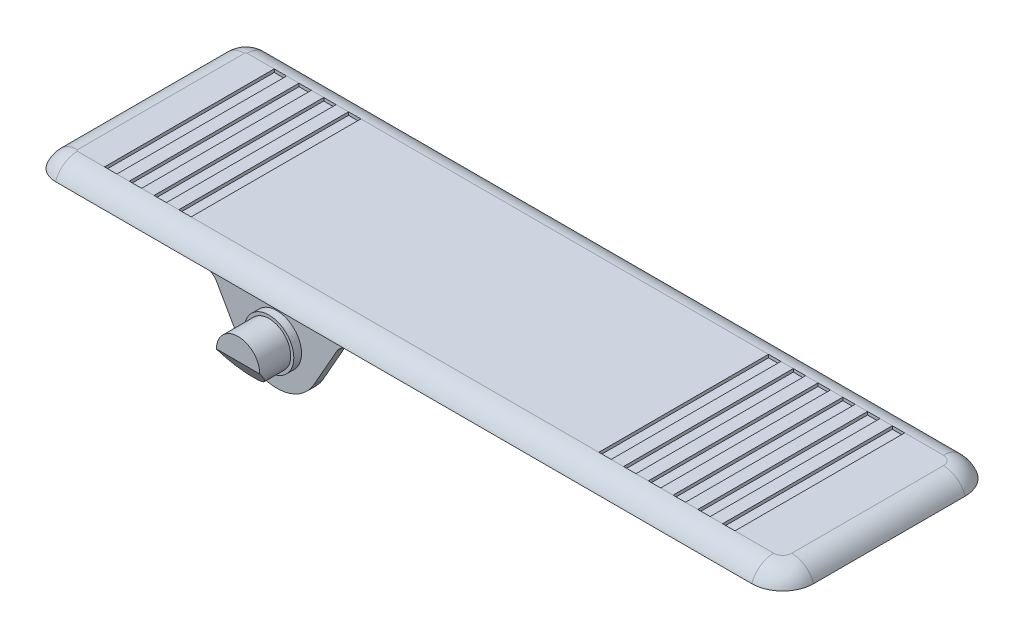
ISO-10303-21;
HEADER;
FILE_DESCRIPTION(('STEP AP214'),'2;1');
FILE_NAME('part.step','',(''),(''),'','','');
FILE_SCHEMA(('AUTOMOTIVE_DESIGN { 1 0 10303 214 1 1 1 1 }'));
ENDSEC;
DATA;
#1=APPLICATION_CONTEXT('core data for automotive mechanical design processes');
#2=APPLICATION_PROTOCOL_DEFINITION('international standard','automotive_design',2000,#1);
#3=PRODUCT_CONTEXT('',#1,'mechanical');
#4=PRODUCT('Part','Part','',(#3));
#5=PRODUCT_RELATED_PRODUCT_CATEGORY('part','',(#4));
#6=PRODUCT_DEFINITION_FORMATION('','',#4);
#7=PRODUCT_DEFINITION_CONTEXT('part definition',#1,'design');
#8=PRODUCT_DEFINITION('design','',#6,#7);
#9=PRODUCT_DEFINITION_SHAPE('','',#8);
#10=(LENGTH_UNIT() NAMED_UNIT(*) SI_UNIT(.MILLI.,.METRE.));
#11=(NAMED_UNIT(*) PLANE_ANGLE_UNIT() SI_UNIT($,.RADIAN.));
#12=(NAMED_UNIT(*) SI_UNIT($,.STERADIAN.) SOLID_ANGLE_UNIT());
#13=UNCERTAINTY_MEASURE_WITH_UNIT(LENGTH_MEASURE(1.E-05),#10,'distance_accuracy_value','');
#14=(GEOMETRIC_REPRESENTATION_CONTEXT(3) GLOBAL_UNCERTAINTY_ASSIGNED_CONTEXT((#13)) GLOBAL_UNIT_ASSIGNED_CONTEXT((#10,
#11,#12)) REPRESENTATION_CONTEXT('',''));
#15=CARTESIAN_POINT('',(0.,0.,0.));
#16=DIRECTION('',(0.,0.,1.));
#17=DIRECTION('',(1.,0.,0.));
#18=AXIS2_PLACEMENT_3D('',#15,#16,#17);
#19=CARTESIAN_POINT('',(3.81,2.54,-3.81));
#20=DIRECTION('',(0.,1.,0.));
#21=DIRECTION('',(0.,0.,1.));
#22=AXIS2_PLACEMENT_3D('',#19,#20,#21);
#23=PLANE('',#22);
#24=DIRECTION('',(0.,0.,-1.));
#25=VECTOR('',#24,1.);
#26=CARTESIAN_POINT('',(22.479,2.54,-3.59210244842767));
#27=LINE('',#26,#25);
#28=CARTESIAN_POINT('',(22.479,2.54,-3.59210244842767));
#29=VERTEX_POINT('',#28);
#30=CARTESIAN_POINT('',(22.479,2.54,-31.4598975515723));
#31=VERTEX_POINT('',#30);
#32=EDGE_CURVE('E43',#29,#31,#27,.T.);
#33=ORIENTED_EDGE('',*,*,#32,.F.);
#34=DIRECTION('',(-1.,0.,0.));
#35=VECTOR('',#34,1.);
#36=CARTESIAN_POINT('',(118.11,2.54,-3.59210244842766));
#37=LINE('',#36,#35);
#38=CARTESIAN_POINT('',(89.408,2.54,-3.59210244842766));
#39=VERTEX_POINT('',#38);
#40=EDGE_CURVE('E1033',#29,#39,#37,.F.);
#41=ORIENTED_EDGE('',*,*,#40,.T.);
#42=DIRECTION('',(0.,0.,1.));
#43=VECTOR('',#42,1.);
#44=CARTESIAN_POINT('',(89.408,2.54,-31.4598975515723));
#45=LINE('',#44,#43);
#46=CARTESIAN_POINT('',(89.408,2.54,-31.4598975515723));
#47=VERTEX_POINT('',#46);
#48=EDGE_CURVE('E653',#47,#39,#45,.T.);
#49=ORIENTED_EDGE('',*,*,#48,.F.);
#50=DIRECTION('',(1.,0.,0.));
#51=VECTOR('',#50,1.);
#52=CARTESIAN_POINT('',(3.80999999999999,2.54,-31.4598975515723));
#53=LINE('',#52,#51);
#54=EDGE_CURVE('E595',#47,#31,#53,.F.);
#55=ORIENTED_EDGE('',*,*,#54,.T.);
#56=EDGE_LOOP('',(#33,#41,#49,#55));
#57=FACE_BOUND('',#56,.T.);
#58=ADVANCED_FACE('F28',(#57),#23,.T.);
#59=DIRECTION('',(0.,0.,1.));
#60=VECTOR('',#59,1.);
#61=CARTESIAN_POINT('',(20.447,2.54,-31.4598975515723));
#62=LINE('',#61,#60);
#63=CARTESIAN_POINT('',(20.447,2.54,-31.4598975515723));
#64=VERTEX_POINT('',#63);
#65=CARTESIAN_POINT('',(20.447,2.54,-3.59210244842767));
#66=VERTEX_POINT('',#65);
#67=EDGE_CURVE('E568',#64,#66,#62,.T.);
#68=ORIENTED_EDGE('',*,*,#67,.F.);
#69=CARTESIAN_POINT('',(18.415,2.54,-31.4598975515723));
#70=VERTEX_POINT('',#69);
#71=EDGE_CURVE('E51',#64,#70,#53,.F.);
#72=ORIENTED_EDGE('',*,*,#71,.T.);
#73=DIRECTION('',(0.,0.,-1.));
#74=VECTOR('',#73,1.);
#75=CARTESIAN_POINT('',(18.415,2.54,-3.59210244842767));
#76=LINE('',#75,#74);
#77=CARTESIAN_POINT('',(18.415,2.54,-3.59210244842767));
#78=VERTEX_POINT('',#77);
#79=EDGE_CURVE('E1906',#78,#70,#76,.T.);
#80=ORIENTED_EDGE('',*,*,#79,.F.);
#81=EDGE_CURVE('E587',#78,#66,#37,.F.);
#82=ORIENTED_EDGE('',*,*,#81,.T.);
#83=EDGE_LOOP('',(#68,#72,#80,#82));
#84=FACE_BOUND('',#83,.T.);
#85=ADVANCED_FACE('F585',(#84),#23,.T.);
#86=DIRECTION('',(0.,0.,1.));
#87=VECTOR('',#86,1.);
#88=CARTESIAN_POINT('',(16.383,2.54,-31.4598975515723));
#89=LINE('',#88,#87);
#90=CARTESIAN_POINT('',(16.383,2.54,-31.4598975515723));
#91=VERTEX_POINT('',#90);
#92=CARTESIAN_POINT('',(16.383,2.54,-3.59210244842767));
#93=VERTEX_POINT('',#92);
#94=EDGE_CURVE('E1151',#91,#93,#89,.T.);
#95=ORIENTED_EDGE('',*,*,#94,.F.);
#96=CARTESIAN_POINT('',(14.351,2.54,-31.4598975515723));
#97=VERTEX_POINT('',#96);
#98=EDGE_CURVE('E596',#91,#97,#53,.F.);
#99=ORIENTED_EDGE('',*,*,#98,.T.);
#100=DIRECTION('',(0.,0.,-1.));
#101=VECTOR('',#100,1.);
#102=CARTESIAN_POINT('',(14.351,2.54,-3.59210244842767));
#103=LINE('',#102,#101);
#104=CARTESIAN_POINT('',(14.351,2.54,-3.59210244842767));
#105=VERTEX_POINT('',#104);
#106=EDGE_CURVE('E1153',#105,#97,#103,.T.);
#107=ORIENTED_EDGE('',*,*,#106,.F.);
#108=EDGE_CURVE('E1143',#105,#93,#37,.F.);
#109=ORIENTED_EDGE('',*,*,#108,.T.);
#110=EDGE_LOOP('',(#95,#99,#107,#109));
#111=FACE_BOUND('',#110,.T.);
#112=ADVANCED_FACE('F1149',(#111),#23,.T.);
#113=DIRECTION('',(0.,0.,1.));
#114=VECTOR('',#113,1.);
#115=CARTESIAN_POINT('',(12.319,2.54,-31.4598975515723));
#116=LINE('',#115,#114);
#117=CARTESIAN_POINT('',(12.319,2.54,-31.4598975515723));
#118=VERTEX_POINT('',#117);
#119=CARTESIAN_POINT('',(12.319,2.54,-3.59210244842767));
#120=VERTEX_POINT('',#119);
#121=EDGE_CURVE('E1058',#118,#120,#116,.T.);
#122=ORIENTED_EDGE('',*,*,#121,.F.);
#123=CARTESIAN_POINT('',(10.287,2.54,-31.4598975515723));
#124=VERTEX_POINT('',#123);
#125=EDGE_CURVE('E601',#118,#124,#53,.F.);
#126=ORIENTED_EDGE('',*,*,#125,.T.);
#127=DIRECTION('',(0.,0.,-1.));
#128=VECTOR('',#127,1.);
#129=CARTESIAN_POINT('',(10.287,2.54,-3.59210244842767));
#130=LINE('',#129,#128);
#131=CARTESIAN_POINT('',(10.287,2.54,-3.59210244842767));
#132=VERTEX_POINT('',#131);
#133=EDGE_CURVE('E1055',#132,#124,#130,.T.);
#134=ORIENTED_EDGE('',*,*,#133,.F.);
#135=EDGE_CURVE('E1032',#132,#120,#37,.F.);
#136=ORIENTED_EDGE('',*,*,#135,.T.);
#137=EDGE_LOOP('',(#122,#126,#134,#136));
#138=FACE_BOUND('',#137,.T.);
#139=ADVANCED_FACE('F1053',(#138),#23,.T.);
#140=DIRECTION('',(0.,0.,-1.));
#141=VECTOR('',#140,1.);
#142=CARTESIAN_POINT('',(91.44,2.54,-3.59210244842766));
#143=LINE('',#142,#141);
#144=CARTESIAN_POINT('',(91.44,2.54,-3.59210244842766));
#145=VERTEX_POINT('',#144);
#146=CARTESIAN_POINT('',(91.44,2.54,-31.4598975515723));
#147=VERTEX_POINT('',#146);
#148=EDGE_CURVE('E640',#145,#147,#143,.T.);
#149=ORIENTED_EDGE('',*,*,#148,.F.);
#150=CARTESIAN_POINT('',(93.472,2.54,-3.59210244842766));
#151=VERTEX_POINT('',#150);
#152=EDGE_CURVE('E1141',#145,#151,#37,.F.);
#153=ORIENTED_EDGE('',*,*,#152,.T.);
#154=DIRECTION('',(0.,0.,1.));
#155=VECTOR('',#154,1.);
#156=CARTESIAN_POINT('',(93.472,2.54,-31.4598975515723));
#157=LINE('',#156,#155);
#158=CARTESIAN_POINT('',(93.472,2.54,-31.4598975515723));
#159=VERTEX_POINT('',#158);
#160=EDGE_CURVE('E643',#159,#151,#157,.T.);
#161=ORIENTED_EDGE('',*,*,#160,.F.);
#162=EDGE_CURVE('E599',#159,#147,#53,.F.);
#163=ORIENTED_EDGE('',*,*,#162,.T.);
#164=EDGE_LOOP('',(#149,#153,#161,#163));
#165=FACE_BOUND('',#164,.T.);
#166=ADVANCED_FACE('F639',(#165),#23,.T.);
#167=DIRECTION('',(0.,0.,-1.));
#168=VECTOR('',#167,1.);
#169=CARTESIAN_POINT('',(95.504,2.54,-3.59210244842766));
#170=LINE('',#169,#168);
#171=CARTESIAN_POINT('',(95.504,2.54,-3.59210244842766));
#172=VERTEX_POINT('',#171);
#173=CARTESIAN_POINT('',(95.504,2.54,-31.4598975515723));
#174=VERTEX_POINT('',#173);
#175=EDGE_CURVE('E677',#172,#174,#170,.T.);
#176=ORIENTED_EDGE('',*,*,#175,.F.);
#177=CARTESIAN_POINT('',(97.536,2.54,-3.59210244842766));
#178=VERTEX_POINT('',#177);
#179=EDGE_CURVE('E1139',#172,#178,#37,.F.);
#180=ORIENTED_EDGE('',*,*,#179,.T.);
#181=DIRECTION('',(0.,0.,1.));
#182=VECTOR('',#181,1.);
#183=CARTESIAN_POINT('',(97.536,2.54,-31.4598975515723));
#184=LINE('',#183,#182);
#185=CARTESIAN_POINT('',(97.536,2.54,-31.4598975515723));
#186=VERTEX_POINT('',#185);
#187=EDGE_CURVE('E715',#186,#178,#184,.T.);
#188=ORIENTED_EDGE('',*,*,#187,.F.);
#189=EDGE_CURVE('E624',#186,#174,#53,.F.);
#190=ORIENTED_EDGE('',*,*,#189,.T.);
#191=EDGE_LOOP('',(#176,#180,#188,#190));
#192=FACE_BOUND('',#191,.T.);
#193=ADVANCED_FACE('F2012',(#192),#23,.T.);
#194=DIRECTION('',(0.,0.,-1.));
#195=VECTOR('',#194,1.);
#196=CARTESIAN_POINT('',(99.568,2.54,-3.59210244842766));
#197=LINE('',#196,#195);
#198=CARTESIAN_POINT('',(99.568,2.54,-3.59210244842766));
#199=VERTEX_POINT('',#198);
#200=CARTESIAN_POINT('',(99.568,2.54,-31.4598975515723));
#201=VERTEX_POINT('',#200);
#202=EDGE_CURVE('E703',#199,#201,#197,.T.);
#203=ORIENTED_EDGE('',*,*,#202,.F.);
#204=CARTESIAN_POINT('',(101.6,2.54,-3.59210244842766));
#205=VERTEX_POINT('',#204);
#206=EDGE_CURVE('E1137',#199,#205,#37,.F.);
#207=ORIENTED_EDGE('',*,*,#206,.T.);
#208=DIRECTION('',(0.,0.,1.));
#209=VECTOR('',#208,1.);
#210=CARTESIAN_POINT('',(101.6,2.54,-31.4598975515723));
#211=LINE('',#210,#209);
#212=CARTESIAN_POINT('',(101.6,2.54,-31.4598975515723));
#213=VERTEX_POINT('',#212);
#214=EDGE_CURVE('E746',#213,#205,#211,.T.);
#215=ORIENTED_EDGE('',*,*,#214,.F.);
#216=EDGE_CURVE('E618',#213,#201,#53,.F.);
#217=ORIENTED_EDGE('',*,*,#216,.T.);
#218=EDGE_LOOP('',(#203,#207,#215,#217));
#219=FACE_BOUND('',#218,.T.);
#220=ADVANCED_FACE('F1267',(#219),#23,.T.);
#221=DIRECTION('',(0.,0.,-1.));
#222=VECTOR('',#221,1.);
#223=CARTESIAN_POINT('',(103.632,2.54,-3.59210244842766));
#224=LINE('',#223,#222);
#225=CARTESIAN_POINT('',(103.632,2.54,-3.59210244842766));
#226=VERTEX_POINT('',#225);
#227=CARTESIAN_POINT('',(103.632,2.54,-31.4598975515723));
#228=VERTEX_POINT('',#227);
#229=EDGE_CURVE('E734',#226,#228,#224,.T.);
#230=ORIENTED_EDGE('',*,*,#229,.F.);
#231=CARTESIAN_POINT('',(105.664,2.54,-3.59210244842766));
#232=VERTEX_POINT('',#231);
#233=EDGE_CURVE('E1135',#226,#232,#37,.F.);
#234=ORIENTED_EDGE('',*,*,#233,.T.);
#235=DIRECTION('',(0.,0.,1.));
#236=VECTOR('',#235,1.);
#237=CARTESIAN_POINT('',(105.664,2.54,-31.4598975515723));
#238=LINE('',#237,#236);
#239=CARTESIAN_POINT('',(105.664,2.54,-31.4598975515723));
#240=VERTEX_POINT('',#239);
#241=EDGE_CURVE('E777',#240,#232,#238,.T.);
#242=ORIENTED_EDGE('',*,*,#241,.F.);
#243=EDGE_CURVE('E612',#240,#228,#53,.F.);
#244=ORIENTED_EDGE('',*,*,#243,.T.);
#245=EDGE_LOOP('',(#230,#234,#242,#244));
#246=FACE_BOUND('',#245,.T.);
#247=ADVANCED_FACE('F1262',(#246),#23,.T.);
#248=DIRECTION('',(0.,0.,-1.));
#249=VECTOR('',#248,1.);
#250=CARTESIAN_POINT('',(107.696,2.54,-3.59210244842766));
#251=LINE('',#250,#249);
#252=CARTESIAN_POINT('',(107.696,2.54,-3.59210244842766));
#253=VERTEX_POINT('',#252);
#254=CARTESIAN_POINT('',(107.696,2.54,-31.4598975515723));
#255=VERTEX_POINT('',#254);
#256=EDGE_CURVE('E765',#253,#255,#251,.T.);
#257=ORIENTED_EDGE('',*,*,#256,.F.);
#258=CARTESIAN_POINT('',(109.728,2.54,-3.59210244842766));
#259=VERTEX_POINT('',#258);
#260=EDGE_CURVE('E1134',#253,#259,#37,.F.);
#261=ORIENTED_EDGE('',*,*,#260,.T.);
#262=DIRECTION('',(0.,0.,1.));
#263=VECTOR('',#262,1.);
#264=CARTESIAN_POINT('',(109.728,2.54,-31.4598975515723));
#265=LINE('',#264,#263);
#266=CARTESIAN_POINT('',(109.728,2.54,-31.4598975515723));
#267=VERTEX_POINT('',#266);
#268=EDGE_CURVE('E808',#267,#259,#265,.T.);
#269=ORIENTED_EDGE('',*,*,#268,.F.);
#270=EDGE_CURVE('E606',#267,#255,#53,.F.);
#271=ORIENTED_EDGE('',*,*,#270,.T.);
#272=EDGE_LOOP('',(#257,#261,#269,#271));
#273=FACE_BOUND('',#272,.T.);
#274=ADVANCED_FACE('F1252',(#273),#23,.T.);
#275=DIRECTION('',(0.,0.,-1.));
#276=VECTOR('',#275,1.);
#277=CARTESIAN_POINT('',(111.76,2.54,-3.59210244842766));
#278=LINE('',#277,#276);
#279=CARTESIAN_POINT('',(111.76,2.54,-3.59210244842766));
#280=VERTEX_POINT('',#279);
#281=CARTESIAN_POINT('',(111.76,2.54,-31.4598975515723));
#282=VERTEX_POINT('',#281);
#283=EDGE_CURVE('E796',#280,#282,#278,.T.);
#284=ORIENTED_EDGE('',*,*,#283,.F.);
#285=CARTESIAN_POINT('',(118.11,2.54,-3.59210244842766));
#286=VERTEX_POINT('',#285);
#287=EDGE_CURVE('E1027',#280,#286,#37,.F.);
#288=ORIENTED_EDGE('',*,*,#287,.T.);
#289=CARTESIAN_POINT('',(118.11,2.54,-5.08));
#290=DIRECTION('',(0.,1.,0.));
#291=DIRECTION('',(0.,0.,1.));
#292=AXIS2_PLACEMENT_3D('',#289,#290,#291);
#293=CIRCLE('',#292,1.48789755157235);
#294=CARTESIAN_POINT('',(119.597897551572,2.54,-5.08));
#295=VERTEX_POINT('',#294);
#296=EDGE_CURVE('E1031',#286,#295,#293,.T.);
#297=ORIENTED_EDGE('',*,*,#296,.T.);
#298=DIRECTION('',(0.,0.,-1.));
#299=VECTOR('',#298,1.);
#300=CARTESIAN_POINT('',(119.597897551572,2.54,-29.972));
#301=LINE('',#300,#299);
#302=CARTESIAN_POINT('',(119.597897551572,2.54,-29.972));
#303=VERTEX_POINT('',#302);
#304=EDGE_CURVE('E1037',#295,#303,#301,.T.);
#305=ORIENTED_EDGE('',*,*,#304,.T.);
#306=CARTESIAN_POINT('',(118.11,2.54,-29.972));
#307=DIRECTION('',(0.,1.,0.));
#308=DIRECTION('',(0.,0.,1.));
#309=AXIS2_PLACEMENT_3D('',#306,#307,#308);
#310=CIRCLE('',#309,1.48789755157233);
#311=CARTESIAN_POINT('',(118.11,2.54,-31.4598975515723));
#312=VERTEX_POINT('',#311);
#313=EDGE_CURVE('E1041',#303,#312,#310,.T.);
#314=ORIENTED_EDGE('',*,*,#313,.T.);
#315=EDGE_CURVE('E598',#312,#282,#53,.F.);
#316=ORIENTED_EDGE('',*,*,#315,.T.);
#317=EDGE_LOOP('',(#284,#288,#297,#305,#314,#316));
#318=FACE_BOUND('',#317,.T.);
#319=ADVANCED_FACE('F1132',(#318),#23,.T.);
#320=CARTESIAN_POINT('',(3.81,0.,-3.81));
#321=DIRECTION('',(0.,1.,0.));
#322=DIRECTION('',(0.,0.,1.));
#323=AXIS2_PLACEMENT_3D('',#320,#321,#322);
#324=PLANE('',#323);
#325=DIRECTION('',(0.,0.,1.));
#326=VECTOR('',#325,1.);
#327=CARTESIAN_POINT('',(119.634,0.,-30.988));
#328=LINE('',#327,#326);
#329=CARTESIAN_POINT('',(119.634,0.,-30.988));
#330=VERTEX_POINT('',#329);
#331=CARTESIAN_POINT('',(119.634,0.,-4.064));
#332=VERTEX_POINT('',#331);
#333=EDGE_CURVE('E844',#330,#332,#328,.T.);
#334=ORIENTED_EDGE('',*,*,#333,.F.);
#335=CARTESIAN_POINT('',(118.872,0.,-30.988));
#336=DIRECTION('',(0.,1.,0.));
#337=DIRECTION('',(0.,0.,1.));
#338=AXIS2_PLACEMENT_3D('',#335,#336,#337);
#339=CIRCLE('',#338,0.761999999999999);
#340=CARTESIAN_POINT('',(118.11,0.,-30.988));
#341=VERTEX_POINT('',#340);
#342=EDGE_CURVE('E852',#330,#341,#339,.T.);
#343=ORIENTED_EDGE('',*,*,#342,.T.);
#344=DIRECTION('',(0.,0.,-1.));
#345=VECTOR('',#344,1.);
#346=CARTESIAN_POINT('',(118.11,0.,-4.064));
#347=LINE('',#346,#345);
#348=CARTESIAN_POINT('',(118.11,0.,-4.064));
#349=VERTEX_POINT('',#348);
#350=EDGE_CURVE('E853',#349,#341,#347,.T.);
#351=ORIENTED_EDGE('',*,*,#350,.F.);
#352=CARTESIAN_POINT('',(118.872,0.,-4.064));
#353=DIRECTION('',(0.,1.,0.));
#354=DIRECTION('',(0.,0.,1.));
#355=AXIS2_PLACEMENT_3D('',#352,#353,#354);
#356=CIRCLE('',#355,0.761999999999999);
#357=EDGE_CURVE('E849',#349,#332,#356,.T.);
#358=ORIENTED_EDGE('',*,*,#357,.T.);
#359=EDGE_LOOP('',(#334,#343,#351,#358));
#360=FACE_BOUND('',#359,.T.);
#361=DIRECTION('',(1.,0.,0.));
#362=VECTOR('',#361,1.);
#363=CARTESIAN_POINT('',(5.08,0.,-31.75));
#364=LINE('',#363,#362);
#365=CARTESIAN_POINT('',(5.842,0.,-31.75));
#366=VERTEX_POINT('',#365);
#367=CARTESIAN_POINT('',(110.236,0.,-31.75));
#368=VERTEX_POINT('',#367);
#369=EDGE_CURVE('E893',#366,#368,#364,.T.);
#370=ORIENTED_EDGE('',*,*,#369,.F.);
#371=CARTESIAN_POINT('',(5.842,0.,-30.988));
#372=DIRECTION('',(0.,1.,0.));
#373=DIRECTION('',(0.,0.,1.));
#374=AXIS2_PLACEMENT_3D('',#371,#372,#373);
#375=CIRCLE('',#374,0.762);
#376=CARTESIAN_POINT('',(5.08,0.,-30.988));
#377=VERTEX_POINT('',#376);
#378=EDGE_CURVE('E2356',#366,#377,#375,.T.);
#379=ORIENTED_EDGE('',*,*,#378,.T.);
#380=CARTESIAN_POINT('',(5.842,0.,-30.988));
#381=DIRECTION('',(0.,1.,0.));
#382=DIRECTION('',(0.,0.,1.));
#383=AXIS2_PLACEMENT_3D('',#380,#381,#382);
#384=CIRCLE('',#383,0.762);
#385=CARTESIAN_POINT('',(5.842,0.,-30.226));
#386=VERTEX_POINT('',#385);
#387=EDGE_CURVE('E2354',#377,#386,#384,.T.);
#388=ORIENTED_EDGE('',*,*,#387,.T.);
#389=DIRECTION('',(1.,0.,0.));
#390=VECTOR('',#389,1.);
#391=CARTESIAN_POINT('',(5.08,0.,-30.226));
#392=LINE('',#391,#390);
#393=CARTESIAN_POINT('',(110.236,0.,-30.226));
#394=VERTEX_POINT('',#393);
#395=EDGE_CURVE('E910',#386,#394,#392,.T.);
#396=ORIENTED_EDGE('',*,*,#395,.T.);
#397=CARTESIAN_POINT('',(110.236,0.,-30.988));
#398=DIRECTION('',(0.,1.,0.));
#399=DIRECTION('',(0.,0.,1.));
#400=AXIS2_PLACEMENT_3D('',#397,#398,#399);
#401=CIRCLE('',#400,0.762);
#402=CARTESIAN_POINT('',(110.998,0.,-30.988));
#403=VERTEX_POINT('',#402);
#404=EDGE_CURVE('E2360',#394,#403,#401,.T.);
#405=ORIENTED_EDGE('',*,*,#404,.T.);
#406=CARTESIAN_POINT('',(110.236,0.,-30.988));
#407=DIRECTION('',(0.,1.,0.));
#408=DIRECTION('',(0.,0.,1.));
#409=AXIS2_PLACEMENT_3D('',#406,#407,#408);
#410=CIRCLE('',#409,0.762);
#411=EDGE_CURVE('E2358',#403,#368,#410,.T.);
#412=ORIENTED_EDGE('',*,*,#411,.T.);
#413=EDGE_LOOP('',(#370,#379,#388,#396,#405,#412));
#414=FACE_BOUND('',#413,.T.);
#415=CARTESIAN_POINT('',(110.236,0.,-4.064));
#416=DIRECTION('',(0.,1.,0.));
#417=DIRECTION('',(0.,0.,1.));
#418=AXIS2_PLACEMENT_3D('',#415,#416,#417);
#419=CIRCLE('',#418,0.762);
#420=CARTESIAN_POINT('',(110.236,0.,-3.302));
#421=VERTEX_POINT('',#420);
#422=CARTESIAN_POINT('',(110.998,0.,-4.064));
#423=VERTEX_POINT('',#422);
#424=EDGE_CURVE('E2389',#421,#423,#419,.T.);
#425=ORIENTED_EDGE('',*,*,#424,.T.);
#426=CARTESIAN_POINT('',(110.236,0.,-4.064));
#427=DIRECTION('',(0.,1.,0.));
#428=DIRECTION('',(0.,0.,1.));
#429=AXIS2_PLACEMENT_3D('',#426,#427,#428);
#430=CIRCLE('',#429,0.762);
#431=CARTESIAN_POINT('',(110.236,0.,-4.826));
#432=VERTEX_POINT('',#431);
#433=EDGE_CURVE('E2392',#423,#432,#430,.T.);
#434=ORIENTED_EDGE('',*,*,#433,.T.);
#435=DIRECTION('',(1.,0.,0.));
#436=VECTOR('',#435,1.);
#437=CARTESIAN_POINT('',(5.08,0.,-4.826));
#438=LINE('',#437,#436);
#439=CARTESIAN_POINT('',(5.842,0.,-4.826));
#440=VERTEX_POINT('',#439);
#441=EDGE_CURVE('E975',#440,#432,#438,.T.);
#442=ORIENTED_EDGE('',*,*,#441,.F.);
#443=CARTESIAN_POINT('',(5.842,0.,-4.064));
#444=DIRECTION('',(0.,1.,0.));
#445=DIRECTION('',(0.,0.,1.));
#446=AXIS2_PLACEMENT_3D('',#443,#444,#445);
#447=CIRCLE('',#446,0.762);
#448=CARTESIAN_POINT('',(5.08,0.,-4.064));
#449=VERTEX_POINT('',#448);
#450=EDGE_CURVE('E2410',#440,#449,#447,.T.);
#451=ORIENTED_EDGE('',*,*,#450,.T.);
#452=CARTESIAN_POINT('',(5.842,0.,-4.064));
#453=DIRECTION('',(0.,1.,0.));
#454=DIRECTION('',(0.,0.,1.));
#455=AXIS2_PLACEMENT_3D('',#452,#453,#454);
#456=CIRCLE('',#455,0.762);
#457=CARTESIAN_POINT('',(5.842,0.,-3.302));
#458=VERTEX_POINT('',#457);
#459=EDGE_CURVE('E2396',#449,#458,#456,.T.);
#460=ORIENTED_EDGE('',*,*,#459,.T.);
#461=DIRECTION('',(1.,0.,0.));
#462=VECTOR('',#461,1.);
#463=CARTESIAN_POINT('',(5.08,0.,-3.302));
#464=LINE('',#463,#462);
#465=EDGE_CURVE('E959',#458,#421,#464,.T.);
#466=ORIENTED_EDGE('',*,*,#465,.T.);
#467=EDGE_LOOP('',(#425,#434,#442,#451,#460,#466));
#468=FACE_BOUND('',#467,.T.);
#469=CARTESIAN_POINT('',(3.81,0.,-3.81));
#470=DIRECTION('',(0.,1.,0.));
#471=DIRECTION('',(0.,0.,1.));
#472=AXIS2_PLACEMENT_3D('',#469,#470,#471);
#473=CIRCLE('',#472,3.81);
#474=CARTESIAN_POINT('',(0.,0.,-3.81000000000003));
#475=VERTEX_POINT('',#474);
#476=CARTESIAN_POINT('',(3.81000000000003,0.,0.));
#477=VERTEX_POINT('',#476);
#478=EDGE_CURVE('E1006',#475,#477,#473,.T.);
#479=ORIENTED_EDGE('',*,*,#478,.F.);
#480=DIRECTION('',(0.,0.,-1.));
#481=VECTOR('',#480,1.);
#482=CARTESIAN_POINT('',(0.,0.,-3.81000000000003));
#483=LINE('',#482,#481);
#484=CARTESIAN_POINT('',(0.,0.,-31.242));
#485=VERTEX_POINT('',#484);
#486=EDGE_CURVE('E1025',#475,#485,#483,.T.);
#487=ORIENTED_EDGE('',*,*,#486,.T.);
#488=CARTESIAN_POINT('',(3.81,0.,-31.242));
#489=DIRECTION('',(0.,1.,0.));
#490=DIRECTION('',(0.,0.,1.));
#491=AXIS2_PLACEMENT_3D('',#488,#489,#490);
#492=CIRCLE('',#491,3.81);
#493=CARTESIAN_POINT('',(3.81,0.,-35.052));
#494=VERTEX_POINT('',#493);
#495=EDGE_CURVE('E1022',#494,#485,#492,.T.);
#496=ORIENTED_EDGE('',*,*,#495,.F.);
#497=DIRECTION('',(-1.,0.,0.));
#498=VECTOR('',#497,1.);
#499=CARTESIAN_POINT('',(118.11,0.,-35.052));
#500=LINE('',#499,#498);
#501=CARTESIAN_POINT('',(118.11,0.,-35.052));
#502=VERTEX_POINT('',#501);
#503=EDGE_CURVE('E1019',#502,#494,#500,.T.);
#504=ORIENTED_EDGE('',*,*,#503,.F.);
#505=CARTESIAN_POINT('',(118.11,0.,-29.972));
#506=DIRECTION('',(0.,1.,0.));
#507=DIRECTION('',(0.,0.,1.));
#508=AXIS2_PLACEMENT_3D('',#505,#506,#507);
#509=CIRCLE('',#508,5.07999999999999);
#510=CARTESIAN_POINT('',(123.19,0.,-29.972));
#511=VERTEX_POINT('',#510);
#512=EDGE_CURVE('E1016',#511,#502,#509,.T.);
#513=ORIENTED_EDGE('',*,*,#512,.F.);
#514=DIRECTION('',(0.,0.,1.));
#515=VECTOR('',#514,1.);
#516=CARTESIAN_POINT('',(123.19,0.,-29.972));
#517=LINE('',#516,#515);
#518=CARTESIAN_POINT('',(123.19,0.,-5.08));
#519=VERTEX_POINT('',#518);
#520=EDGE_CURVE('E1014',#511,#519,#517,.T.);
#521=ORIENTED_EDGE('',*,*,#520,.T.);
#522=CARTESIAN_POINT('',(118.11,0.,-5.08));
#523=DIRECTION('',(0.,-1.,0.));
#524=DIRECTION('',(0.,0.,-1.));
#525=AXIS2_PLACEMENT_3D('',#522,#523,#524);
#526=CIRCLE('',#525,5.08000000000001);
#527=CARTESIAN_POINT('',(118.11,0.,0.));
#528=VERTEX_POINT('',#527);
#529=EDGE_CURVE('E1012',#519,#528,#526,.T.);
#530=ORIENTED_EDGE('',*,*,#529,.T.);
#531=DIRECTION('',(1.,0.,0.));
#532=VECTOR('',#531,1.);
#533=CARTESIAN_POINT('',(3.81000000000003,0.,0.));
#534=LINE('',#533,#532);
#535=EDGE_CURVE('E1009',#477,#528,#534,.T.);
#536=ORIENTED_EDGE('',*,*,#535,.F.);
#537=EDGE_LOOP('',(#479,#487,#496,#504,#513,#521,#530,#536));
#538=FACE_BOUND('',#537,.T.);
#539=CARTESIAN_POINT('',(14.605,0.,-17.526));
#540=DIRECTION('',(0.,1.,0.));
#541=DIRECTION('',(0.,0.,1.));
#542=AXIS2_PLACEMENT_3D('',#539,#540,#541);
#543=CIRCLE('',#542,9.271);
#544=CARTESIAN_POINT('',(14.605,0.,-8.25500000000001));
#545=VERTEX_POINT('',#544);
#546=EDGE_CURVE('E11',#545,#545,#543,.F.);
#547=ORIENTED_EDGE('',*,*,#546,.F.);
#548=EDGE_LOOP('',(#547));
#549=FACE_BOUND('',#548,.T.);
#550=ADVANCED_FACE('F1121',(#360,#414,#468,#538,#549),#324,.F.);
#551=CARTESIAN_POINT('',(36.83,-7.5184,3.048));
#552=DIRECTION('',(0.,0.,-1.));
#553=DIRECTION('',(-1.,0.,0.));
#554=AXIS2_PLACEMENT_3D('',#551,#552,#553);
#555=CYLINDRICAL_SURFACE('',#554,3.55600000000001);
#556=CARTESIAN_POINT('',(36.83,-7.5184,-2.032));
#557=DIRECTION('',(0.,0.,1.));
#558=DIRECTION('',(1.,0.,0.));
#559=AXIS2_PLACEMENT_3D('',#556,#557,#558);
#560=CIRCLE('',#559,3.55600000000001);
#561=CARTESIAN_POINT('',(40.386,-7.5184,-2.032));
#562=VERTEX_POINT('',#561);
#563=EDGE_CURVE('E936',#562,#562,#560,.F.);
#564=ORIENTED_EDGE('',*,*,#563,.F.);
#565=EDGE_LOOP('',(#564));
#566=FACE_BOUND('',#565,.T.);
#567=CARTESIAN_POINT('',(36.83,-7.5184,3.048));
#568=DIRECTION('',(0.,0.,1.));
#569=DIRECTION('',(1.,0.,0.));
#570=AXIS2_PLACEMENT_3D('',#567,#568,#569);
#571=CIRCLE('',#570,3.55600000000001);
#572=CARTESIAN_POINT('',(40.386,-7.5184,3.048));
#573=VERTEX_POINT('',#572);
#574=CARTESIAN_POINT('',(33.274,-7.5184,3.048));
#575=VERTEX_POINT('',#574);
#576=EDGE_CURVE('E933',#573,#575,#571,.T.);
#577=ORIENTED_EDGE('',*,*,#576,.F.);
#578=CARTESIAN_POINT('',(36.83,-7.5184,3.048));
#579=DIRECTION('',(0.,-0.581238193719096,0.813733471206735));
#580=DIRECTION('',(0.,-0.813733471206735,-0.581238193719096));
#581=AXIS2_PLACEMENT_3D('',#578,#579,#580);
#582=ELLIPSE('',#581,4.36998123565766,3.55600000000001);
#583=EDGE_CURVE('E930',#575,#573,#582,.T.);
#584=ORIENTED_EDGE('',*,*,#583,.F.);
#585=EDGE_LOOP('',(#577,#584));
#586=FACE_BOUND('',#585,.T.);
#587=ADVANCED_FACE('F1258',(#566,#586),#555,.T.);
#588=CARTESIAN_POINT('',(36.83,-7.5184,3.048));
#589=DIRECTION('',(0.,0.,1.));
#590=DIRECTION('',(1.,0.,0.));
#591=AXIS2_PLACEMENT_3D('',#588,#589,#590);
#592=PLANE('',#591);
#593=ORIENTED_EDGE('',*,*,#576,.T.);
#594=DIRECTION('',(1.,0.,0.));
#595=VECTOR('',#594,1.);
#596=CARTESIAN_POINT('',(36.83,-7.5184,3.048));
#597=LINE('',#596,#595);
#598=EDGE_CURVE('E2332',#575,#573,#597,.T.);
#599=ORIENTED_EDGE('',*,*,#598,.T.);
#600=EDGE_LOOP('',(#593,#599));
#601=FACE_BOUND('',#600,.T.);
#602=ADVANCED_FACE('F1471',(#601),#592,.T.);
#603=CARTESIAN_POINT('',(36.83,-7.5184,-2.032));
#604=DIRECTION('',(0.,0.,1.));
#605=DIRECTION('',(1.,0.,0.));
#606=AXIS2_PLACEMENT_3D('',#603,#604,#605);
#607=PLANE('',#606);
#608=CARTESIAN_POINT('',(36.83,-7.5184,-2.032));
#609=DIRECTION('',(0.,0.,1.));
#610=DIRECTION('',(1.,0.,0.));
#611=AXIS2_PLACEMENT_3D('',#608,#609,#610);
#612=CIRCLE('',#611,4.064);
#613=CARTESIAN_POINT('',(40.894,-7.5184,-2.032));
#614=VERTEX_POINT('',#613);
#615=EDGE_CURVE('E937',#614,#614,#612,.T.);
#616=ORIENTED_EDGE('',*,*,#615,.T.);
#617=EDGE_LOOP('',(#616));
#618=FACE_BOUND('',#617,.T.);
#619=ORIENTED_EDGE('',*,*,#563,.T.);
#620=EDGE_LOOP('',(#619));
#621=FACE_BOUND('',#620,.T.);
#622=ADVANCED_FACE('F1248',(#618,#621),#607,.T.);
#623=CARTESIAN_POINT('',(36.83,-7.5184,-3.302));
#624=DIRECTION('',(0.,0.,-1.));
#625=DIRECTION('',(-1.,0.,0.));
#626=AXIS2_PLACEMENT_3D('',#623,#624,#625);
#627=PLANE('',#626);
#628=ORIENTED_EDGE('',*,*,#465,.F.);
#629=DIRECTION('',(0.,-1.,0.));
#630=VECTOR('',#629,1.);
#631=CARTESIAN_POINT('',(5.842,-1.524,-3.302));
#632=LINE('',#631,#630);
#633=CARTESIAN_POINT('',(5.842,-1.524,-3.302));
#634=VERTEX_POINT('',#633);
#635=EDGE_CURVE('E2414',#458,#634,#632,.T.);
#636=ORIENTED_EDGE('',*,*,#635,.T.);
#637=DIRECTION('',(1.,0.,0.));
#638=VECTOR('',#637,1.);
#639=CARTESIAN_POINT('',(5.08,-1.524,-3.302));
#640=LINE('',#639,#638);
#641=CARTESIAN_POINT('',(22.1741810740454,-1.524,-3.302));
#642=VERTEX_POINT('',#641);
#643=EDGE_CURVE('E946',#634,#642,#640,.T.);
#644=ORIENTED_EDGE('',*,*,#643,.T.);
#645=CARTESIAN_POINT('',(22.1741810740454,-4.064,-3.302));
#646=DIRECTION('',(0.,0.,-1.));
#647=DIRECTION('',(-1.,0.,0.));
#648=AXIS2_PLACEMENT_3D('',#645,#646,#647);
#649=CIRCLE('',#648,2.54);
#650=CARTESIAN_POINT('',(23.4526158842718,-1.86918692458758,-3.302));
#651=VERTEX_POINT('',#650);
#652=EDGE_CURVE('E2225',#642,#651,#649,.T.);
#653=ORIENTED_EDGE('',*,*,#652,.T.);
#654=DIRECTION('',(0.864099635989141,-0.503320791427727,0.));
#655=VECTOR('',#654,1.);
#656=CARTESIAN_POINT('',(35.8980348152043,-9.1183950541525,-3.302));
#657=LINE('',#656,#655);
#658=CARTESIAN_POINT('',(26.0604584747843,-3.38820318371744,-3.302));
#659=VERTEX_POINT('',#658);
#660=EDGE_CURVE('E2326',#651,#659,#657,.T.);
#661=ORIENTED_EDGE('',*,*,#660,.T.);
#662=CARTESIAN_POINT('',(24.7820236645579,-5.58301625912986,-3.302));
#663=DIRECTION('',(0.,0.,-1.));
#664=DIRECTION('',(-1.,0.,0.));
#665=AXIS2_PLACEMENT_3D('',#662,#663,#664);
#666=CIRCLE('',#665,2.54);
#667=CARTESIAN_POINT('',(26.9914137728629,-4.3299419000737,-3.302));
#668=VERTEX_POINT('',#667);
#669=EDGE_CURVE('E2262',#659,#668,#666,.T.);
#670=ORIENTED_EDGE('',*,*,#669,.T.);
#671=DIRECTION('',(-0.493336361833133,0.869838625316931,0.));
#672=VECTOR('',#671,1.);
#673=CARTESIAN_POINT('',(30.7541772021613,-10.9643544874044,-3.302));
#674=LINE('',#673,#672);
#675=CARTESIAN_POINT('',(30.7541772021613,-10.9643544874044,-3.302));
#676=VERTEX_POINT('',#675);
#677=EDGE_CURVE('E949',#676,#668,#674,.T.);
#678=ORIENTED_EDGE('',*,*,#677,.F.);
#679=CARTESIAN_POINT('',(36.83,-7.5184,-3.302));
#680=DIRECTION('',(0.,0.,-1.));
#681=DIRECTION('',(-1.,0.,0.));
#682=AXIS2_PLACEMENT_3D('',#679,#680,#681);
#683=CIRCLE('',#682,6.98499999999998);
#684=CARTESIAN_POINT('',(42.9058227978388,-10.9643544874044,-3.302));
#685=VERTEX_POINT('',#684);
#686=EDGE_CURVE('E952',#685,#676,#683,.T.);
#687=ORIENTED_EDGE('',*,*,#686,.F.);
#688=DIRECTION('',(0.493336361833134,0.86983862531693,0.));
#689=VECTOR('',#688,1.);
#690=CARTESIAN_POINT('',(42.9058227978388,-10.9643544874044,-3.302));
#691=LINE('',#690,#689);
#692=CARTESIAN_POINT('',(46.6685862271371,-4.3299419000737,-3.302));
#693=VERTEX_POINT('',#692);
#694=EDGE_CURVE('E954',#685,#693,#691,.T.);
#695=ORIENTED_EDGE('',*,*,#694,.T.);
#696=CARTESIAN_POINT('',(48.8779763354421,-5.58301625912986,-3.302));
#697=DIRECTION('',(0.,0.,-1.));
#698=DIRECTION('',(-1.,0.,0.));
#699=AXIS2_PLACEMENT_3D('',#696,#697,#698);
#700=CIRCLE('',#699,2.54);
#701=CARTESIAN_POINT('',(47.5995415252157,-3.38820318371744,-3.302));
#702=VERTEX_POINT('',#701);
#703=EDGE_CURVE('E2252',#693,#702,#700,.T.);
#704=ORIENTED_EDGE('',*,*,#703,.T.);
#705=DIRECTION('',(-0.864099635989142,-0.503320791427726,0.));
#706=VECTOR('',#705,1.);
#707=CARTESIAN_POINT('',(37.7619651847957,-9.1183950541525,-3.302));
#708=LINE('',#707,#706);
#709=CARTESIAN_POINT('',(50.2073841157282,-1.86918692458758,-3.302));
#710=VERTEX_POINT('',#709);
#711=EDGE_CURVE('E2327',#702,#710,#708,.F.);
#712=ORIENTED_EDGE('',*,*,#711,.T.);
#713=CARTESIAN_POINT('',(51.4858189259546,-4.064,-3.302));
#714=DIRECTION('',(0.,0.,-1.));
#715=DIRECTION('',(-1.,0.,0.));
#716=AXIS2_PLACEMENT_3D('',#713,#714,#715);
#717=CIRCLE('',#716,2.54);
#718=CARTESIAN_POINT('',(51.4858189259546,-1.524,-3.302));
#719=VERTEX_POINT('',#718);
#720=EDGE_CURVE('E2258',#710,#719,#717,.T.);
#721=ORIENTED_EDGE('',*,*,#720,.T.);
#722=DIRECTION('',(1.,0.,0.));
#723=VECTOR('',#722,1.);
#724=CARTESIAN_POINT('',(48.26,-1.524,-3.302));
#725=LINE('',#724,#723);
#726=CARTESIAN_POINT('',(110.236,-1.524,-3.302));
#727=VERTEX_POINT('',#726);
#728=EDGE_CURVE('E957',#719,#727,#725,.T.);
#729=ORIENTED_EDGE('',*,*,#728,.T.);
#730=DIRECTION('',(0.,-1.,0.));
#731=VECTOR('',#730,1.);
#732=CARTESIAN_POINT('',(110.236,-7.5184,-3.302));
#733=LINE('',#732,#731);
#734=EDGE_CURVE('E2408',#727,#421,#733,.F.);
#735=ORIENTED_EDGE('',*,*,#734,.T.);
#736=EDGE_LOOP('',(#628,#636,#644,#653,#661,#670,#678,#687,#695,#704,#712,#721,#729,#735));
#737=FACE_BOUND('',#736,.T.);
#738=CARTESIAN_POINT('',(36.83,-7.5184,-3.302));
#739=DIRECTION('',(0.,0.,-1.));
#740=DIRECTION('',(-1.,0.,0.));
#741=AXIS2_PLACEMENT_3D('',#738,#739,#740);
#742=CIRCLE('',#741,4.064);
#743=CARTESIAN_POINT('',(32.766,-7.5184,-3.302));
#744=VERTEX_POINT('',#743);
#745=EDGE_CURVE('E2404',#744,#744,#742,.F.);
#746=ORIENTED_EDGE('',*,*,#745,.F.);
#747=EDGE_LOOP('',(#746));
#748=FACE_BOUND('',#747,.T.);
#749=ADVANCED_FACE('F1240',(#737,#748),#627,.F.);
#750=DIRECTION('',(0.,0.,1.));
#751=VECTOR('',#750,1.);
#752=CARTESIAN_POINT('',(8.255,2.54,-31.4598975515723));
#753=LINE('',#752,#751);
#754=CARTESIAN_POINT('',(8.255,2.54,-31.4598975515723));
#755=VERTEX_POINT('',#754);
#756=CARTESIAN_POINT('',(8.255,2.54,-3.59210244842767));
#757=VERTEX_POINT('',#756);
#758=EDGE_CURVE('E1079',#755,#757,#753,.T.);
#759=ORIENTED_EDGE('',*,*,#758,.F.);
#760=CARTESIAN_POINT('',(3.81,2.54,-31.4598975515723));
#761=VERTEX_POINT('',#760);
#762=EDGE_CURVE('E600',#755,#761,#53,.F.);
#763=ORIENTED_EDGE('',*,*,#762,.T.);
#764=CARTESIAN_POINT('',(3.81,2.54,-31.242));
#765=DIRECTION('',(0.,1.,0.));
#766=DIRECTION('',(0.,0.,1.));
#767=AXIS2_PLACEMENT_3D('',#764,#765,#766);
#768=CIRCLE('',#767,0.217897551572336);
#769=CARTESIAN_POINT('',(3.59210244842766,2.54,-31.242));
#770=VERTEX_POINT('',#769);
#771=EDGE_CURVE('E1042',#761,#770,#768,.T.);
#772=ORIENTED_EDGE('',*,*,#771,.T.);
#773=DIRECTION('',(0.,0.,1.));
#774=VECTOR('',#773,1.);
#775=CARTESIAN_POINT('',(3.59210244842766,2.54,-3.81000000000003));
#776=LINE('',#775,#774);
#777=CARTESIAN_POINT('',(3.59210244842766,2.54,-3.81));
#778=VERTEX_POINT('',#777);
#779=EDGE_CURVE('E1039',#770,#778,#776,.T.);
#780=ORIENTED_EDGE('',*,*,#779,.T.);
#781=CARTESIAN_POINT('',(3.81,2.54,-3.81));
#782=DIRECTION('',(0.,1.,0.));
#783=DIRECTION('',(0.,0.,1.));
#784=AXIS2_PLACEMENT_3D('',#781,#782,#783);
#785=CIRCLE('',#784,0.217897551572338);
#786=CARTESIAN_POINT('',(3.81000000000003,2.54,-3.59210244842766));
#787=VERTEX_POINT('',#786);
#788=EDGE_CURVE('E1035',#778,#787,#785,.T.);
#789=ORIENTED_EDGE('',*,*,#788,.T.);
#790=EDGE_CURVE('E1028',#787,#757,#37,.F.);
#791=ORIENTED_EDGE('',*,*,#790,.T.);
#792=EDGE_LOOP('',(#759,#763,#772,#780,#789,#791));
#793=FACE_BOUND('',#792,.T.);
#794=ADVANCED_FACE('F30',(#793),#23,.T.);
#795=CARTESIAN_POINT('',(3.81000000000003,-1.27,-3.59210244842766));
#796=DIRECTION('',(1.,0.,0.));
#797=DIRECTION('',(0.,0.,-1.));
#798=AXIS2_PLACEMENT_3D('',#795,#796,#797);
#799=CYLINDRICAL_SURFACE('',#798,3.81);
#800=CARTESIAN_POINT('',(3.81000000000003,-1.27,-3.59210244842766));
#801=DIRECTION('',(-1.,0.,0.));
#802=DIRECTION('',(0.,0.,1.));
#803=AXIS2_PLACEMENT_3D('',#800,#801,#802);
#804=CIRCLE('',#803,3.81);
#805=EDGE_CURVE('E1000',#477,#787,#804,.T.);
#806=ORIENTED_EDGE('',*,*,#805,.F.);
#807=ORIENTED_EDGE('',*,*,#535,.T.);
#808=CARTESIAN_POINT('',(118.11,-1.27,-3.59210244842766));
#809=DIRECTION('',(1.,0.,0.));
#810=DIRECTION('',(0.,0.,-1.));
#811=AXIS2_PLACEMENT_3D('',#808,#809,#810);
#812=CIRCLE('',#811,3.81);
#813=EDGE_CURVE('E1003',#286,#528,#812,.T.);
#814=ORIENTED_EDGE('',*,*,#813,.F.);
#815=ORIENTED_EDGE('',*,*,#287,.F.);
#816=DIRECTION('',(-1.,0.,0.));
#817=VECTOR('',#816,1.);
#818=CARTESIAN_POINT('',(111.76,2.54,-3.59210244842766));
#819=LINE('',#818,#817);
#820=EDGE_CURVE('E811',#280,#259,#819,.T.);
#821=ORIENTED_EDGE('',*,*,#820,.T.);
#822=ORIENTED_EDGE('',*,*,#260,.F.);
#823=DIRECTION('',(-1.,0.,0.));
#824=VECTOR('',#823,1.);
#825=CARTESIAN_POINT('',(107.696,2.54,-3.59210244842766));
#826=LINE('',#825,#824);
#827=EDGE_CURVE('E780',#253,#232,#826,.T.);
#828=ORIENTED_EDGE('',*,*,#827,.T.);
#829=ORIENTED_EDGE('',*,*,#233,.F.);
#830=DIRECTION('',(-1.,0.,0.));
#831=VECTOR('',#830,1.);
#832=CARTESIAN_POINT('',(103.632,2.54,-3.59210244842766));
#833=LINE('',#832,#831);
#834=EDGE_CURVE('E749',#226,#205,#833,.T.);
#835=ORIENTED_EDGE('',*,*,#834,.T.);
#836=ORIENTED_EDGE('',*,*,#206,.F.);
#837=DIRECTION('',(-1.,0.,0.));
#838=VECTOR('',#837,1.);
#839=CARTESIAN_POINT('',(99.568,2.54,-3.59210244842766));
#840=LINE('',#839,#838);
#841=EDGE_CURVE('E718',#199,#178,#840,.T.);
#842=ORIENTED_EDGE('',*,*,#841,.T.);
#843=ORIENTED_EDGE('',*,*,#179,.F.);
#844=DIRECTION('',(-1.,0.,0.));
#845=VECTOR('',#844,1.);
#846=CARTESIAN_POINT('',(95.504,2.54,-3.59210244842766));
#847=LINE('',#846,#845);
#848=EDGE_CURVE('E687',#172,#151,#847,.T.);
#849=ORIENTED_EDGE('',*,*,#848,.T.);
#850=ORIENTED_EDGE('',*,*,#152,.F.);
#851=DIRECTION('',(-1.,0.,0.));
#852=VECTOR('',#851,1.);
#853=CARTESIAN_POINT('',(91.44,2.54,-3.59210244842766));
#854=LINE('',#853,#852);
#855=EDGE_CURVE('E656',#145,#39,#854,.T.);
#856=ORIENTED_EDGE('',*,*,#855,.T.);
#857=ORIENTED_EDGE('',*,*,#40,.F.);
#858=DIRECTION('',(-1.,0.,0.));
#859=VECTOR('',#858,1.);
#860=CARTESIAN_POINT('',(22.479,2.54,-3.59210244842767));
#861=LINE('',#860,#859);
#862=EDGE_CURVE('E588',#29,#66,#861,.T.);
#863=ORIENTED_EDGE('',*,*,#862,.T.);
#864=ORIENTED_EDGE('',*,*,#81,.F.);
#865=DIRECTION('',(-1.,0.,0.));
#866=VECTOR('',#865,1.);
#867=CARTESIAN_POINT('',(18.415,2.54,-3.59210244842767));
#868=LINE('',#867,#866);
#869=EDGE_CURVE('E1158',#78,#93,#868,.T.);
#870=ORIENTED_EDGE('',*,*,#869,.T.);
#871=ORIENTED_EDGE('',*,*,#108,.F.);
#872=DIRECTION('',(-1.,0.,0.));
#873=VECTOR('',#872,1.);
#874=CARTESIAN_POINT('',(14.351,2.54,-3.59210244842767));
#875=LINE('',#874,#873);
#876=EDGE_CURVE('E1156',#105,#120,#875,.T.);
#877=ORIENTED_EDGE('',*,*,#876,.T.);
#878=ORIENTED_EDGE('',*,*,#135,.F.);
#879=DIRECTION('',(-1.,0.,0.));
#880=VECTOR('',#879,1.);
#881=CARTESIAN_POINT('',(10.287,2.54,-3.59210244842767));
#882=LINE('',#881,#880);
#883=EDGE_CURVE('E1082',#132,#757,#882,.T.);
#884=ORIENTED_EDGE('',*,*,#883,.T.);
#885=ORIENTED_EDGE('',*,*,#790,.F.);
#886=EDGE_LOOP('',(#806,#807,#814,#815,#821,#822,#828,#829,#835,#836,#842,#843,#849,#850,#856,
#857,#863,#864,#870,#871,#877,#878,#884,#885));
#887=FACE_BOUND('',#886,.T.);
#888=ADVANCED_FACE('F1110',(#887),#799,.T.);
#889=CARTESIAN_POINT('',(118.11,-1.27,-5.08));
#890=DIRECTION('',(0.,-1.,0.));
#891=DIRECTION('',(0.,0.,-1.));
#892=AXIS2_PLACEMENT_3D('',#889,#890,#891);
#893=DEGENERATE_TOROIDAL_SURFACE('',#892,1.48789755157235,3.81,.T.);
#894=ORIENTED_EDGE('',*,*,#813,.T.);
#895=ORIENTED_EDGE('',*,*,#529,.F.);
#896=CARTESIAN_POINT('',(119.597897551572,-1.27,-5.08));
#897=DIRECTION('',(0.,0.,-1.));
#898=DIRECTION('',(-1.,0.,0.));
#899=AXIS2_PLACEMENT_3D('',#896,#897,#898);
#900=CIRCLE('',#899,3.81);
#901=EDGE_CURVE('E997',#295,#519,#900,.T.);
#902=ORIENTED_EDGE('',*,*,#901,.F.);
#903=ORIENTED_EDGE('',*,*,#296,.F.);
#904=EDGE_LOOP('',(#894,#895,#902,#903));
#905=FACE_BOUND('',#904,.T.);
#906=ADVANCED_FACE('F1129',(#905),#893,.T.);
#907=CARTESIAN_POINT('',(3.81,-1.27,-3.81));
#908=DIRECTION('',(0.,-1.,0.));
#909=DIRECTION('',(0.,0.,-1.));
#910=AXIS2_PLACEMENT_3D('',#907,#908,#909);
#911=DEGENERATE_TOROIDAL_SURFACE('',#910,0.217897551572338,3.81,.T.);
#912=ORIENTED_EDGE('',*,*,#805,.T.);
#913=ORIENTED_EDGE('',*,*,#788,.F.);
#914=CARTESIAN_POINT('',(3.59210244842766,-1.27,-3.81));
#915=DIRECTION('',(0.,0.,-1.));
#916=DIRECTION('',(-1.,0.,0.));
#917=AXIS2_PLACEMENT_3D('',#914,#915,#916);
#918=CIRCLE('',#917,3.81);
#919=EDGE_CURVE('E994',#475,#778,#918,.T.);
#920=ORIENTED_EDGE('',*,*,#919,.F.);
#921=ORIENTED_EDGE('',*,*,#478,.T.);
#922=EDGE_LOOP('',(#912,#913,#920,#921));
#923=FACE_BOUND('',#922,.T.);
#924=ADVANCED_FACE('F1115',(#923),#911,.T.);
#925=CARTESIAN_POINT('',(119.597897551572,-1.27,-29.972));
#926=DIRECTION('',(0.,0.,1.));
#927=DIRECTION('',(1.,0.,0.));
#928=AXIS2_PLACEMENT_3D('',#925,#926,#927);
#929=CYLINDRICAL_SURFACE('',#928,3.81);
#930=ORIENTED_EDGE('',*,*,#901,.T.);
#931=ORIENTED_EDGE('',*,*,#520,.F.);
#932=CARTESIAN_POINT('',(119.597897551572,-1.27,-29.972));
#933=DIRECTION('',(0.,0.,-1.));
#934=DIRECTION('',(-1.,0.,0.));
#935=AXIS2_PLACEMENT_3D('',#932,#933,#934);
#936=CIRCLE('',#935,3.81);
#937=EDGE_CURVE('E991',#303,#511,#936,.T.);
#938=ORIENTED_EDGE('',*,*,#937,.F.);
#939=ORIENTED_EDGE('',*,*,#304,.F.);
#940=EDGE_LOOP('',(#930,#931,#938,#939));
#941=FACE_BOUND('',#940,.T.);
#942=ADVANCED_FACE('F1536',(#941),#929,.T.);
#943=CARTESIAN_POINT('',(3.59210244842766,-1.27,-3.81000000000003));
#944=DIRECTION('',(0.,0.,-1.));
#945=DIRECTION('',(-1.,0.,0.));
#946=AXIS2_PLACEMENT_3D('',#943,#944,#945);
#947=CYLINDRICAL_SURFACE('',#946,3.81);
#948=ORIENTED_EDGE('',*,*,#919,.T.);
#949=ORIENTED_EDGE('',*,*,#779,.F.);
#950=CARTESIAN_POINT('',(3.59210244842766,-1.27,-31.242));
#951=DIRECTION('',(0.,0.,-1.));
#952=DIRECTION('',(-1.,0.,0.));
#953=AXIS2_PLACEMENT_3D('',#950,#951,#952);
#954=CIRCLE('',#953,3.81);
#955=EDGE_CURVE('E988',#485,#770,#954,.T.);
#956=ORIENTED_EDGE('',*,*,#955,.F.);
#957=ORIENTED_EDGE('',*,*,#486,.F.);
#958=EDGE_LOOP('',(#948,#949,#956,#957));
#959=FACE_BOUND('',#958,.T.);
#960=ADVANCED_FACE('F1118',(#959),#947,.T.);
#961=CARTESIAN_POINT('',(118.11,-1.27,-29.972));
#962=DIRECTION('',(0.,-1.,0.));
#963=DIRECTION('',(0.,0.,-1.));
#964=AXIS2_PLACEMENT_3D('',#961,#962,#963);
#965=DEGENERATE_TOROIDAL_SURFACE('',#964,1.48789755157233,3.81,.T.);
#966=ORIENTED_EDGE('',*,*,#937,.T.);
#967=ORIENTED_EDGE('',*,*,#512,.T.);
#968=CARTESIAN_POINT('',(118.11,-1.27,-31.4598975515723));
#969=DIRECTION('',(-1.,0.,0.));
#970=DIRECTION('',(0.,0.,1.));
#971=AXIS2_PLACEMENT_3D('',#968,#969,#970);
#972=CIRCLE('',#971,3.81);
#973=EDGE_CURVE('E986',#312,#502,#972,.T.);
#974=ORIENTED_EDGE('',*,*,#973,.F.);
#975=ORIENTED_EDGE('',*,*,#313,.F.);
#976=EDGE_LOOP('',(#966,#967,#974,#975));
#977=FACE_BOUND('',#976,.T.);
#978=ADVANCED_FACE('F1529',(#977),#965,.T.);
#979=CARTESIAN_POINT('',(3.81,-1.27,-31.242));
#980=DIRECTION('',(0.,-1.,0.));
#981=DIRECTION('',(0.,0.,-1.));
#982=AXIS2_PLACEMENT_3D('',#979,#980,#981);
#983=DEGENERATE_TOROIDAL_SURFACE('',#982,0.217897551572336,3.81,.T.);
#984=ORIENTED_EDGE('',*,*,#955,.T.);
#985=ORIENTED_EDGE('',*,*,#771,.F.);
#986=CARTESIAN_POINT('',(3.81,-1.27,-31.4598975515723));
#987=DIRECTION('',(1.,0.,0.));
#988=DIRECTION('',(0.,0.,-1.));
#989=AXIS2_PLACEMENT_3D('',#986,#987,#988);
#990=CIRCLE('',#989,3.81);
#991=EDGE_CURVE('E981',#494,#761,#990,.T.);
#992=ORIENTED_EDGE('',*,*,#991,.F.);
#993=ORIENTED_EDGE('',*,*,#495,.T.);
#994=EDGE_LOOP('',(#984,#985,#992,#993));
#995=FACE_BOUND('',#994,.T.);
#996=ADVANCED_FACE('F1526',(#995),#983,.T.);
#997=CARTESIAN_POINT('',(118.11,-1.27,-31.4598975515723));
#998=DIRECTION('',(-1.,0.,0.));
#999=DIRECTION('',(0.,0.,1.));
#1000=AXIS2_PLACEMENT_3D('',#997,#998,#999);
#1001=CYLINDRICAL_SURFACE('',#1000,3.81);
#1002=ORIENTED_EDGE('',*,*,#973,.T.);
#1003=ORIENTED_EDGE('',*,*,#503,.T.);
#1004=ORIENTED_EDGE('',*,*,#991,.T.);
#1005=ORIENTED_EDGE('',*,*,#762,.F.);
#1006=DIRECTION('',(1.,0.,0.));
#1007=VECTOR('',#1006,1.);
#1008=CARTESIAN_POINT('',(8.255,2.54,-31.4598975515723));
#1009=LINE('',#1008,#1007);
#1010=EDGE_CURVE('E1069',#755,#124,#1009,.T.);
#1011=ORIENTED_EDGE('',*,*,#1010,.T.);
#1012=ORIENTED_EDGE('',*,*,#125,.F.);
#1013=DIRECTION('',(1.,0.,0.));
#1014=VECTOR('',#1013,1.);
#1015=CARTESIAN_POINT('',(12.319,2.54,-31.4598975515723));
#1016=LINE('',#1015,#1014);
#1017=EDGE_CURVE('E1184',#118,#97,#1016,.T.);
#1018=ORIENTED_EDGE('',*,*,#1017,.T.);
#1019=ORIENTED_EDGE('',*,*,#98,.F.);
#1020=DIRECTION('',(1.,0.,0.));
#1021=VECTOR('',#1020,1.);
#1022=CARTESIAN_POINT('',(16.383,2.54,-31.4598975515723));
#1023=LINE('',#1022,#1021);
#1024=EDGE_CURVE('E594',#91,#70,#1023,.T.);
#1025=ORIENTED_EDGE('',*,*,#1024,.T.);
#1026=ORIENTED_EDGE('',*,*,#71,.F.);
#1027=DIRECTION('',(1.,0.,0.));
#1028=VECTOR('',#1027,1.);
#1029=CARTESIAN_POINT('',(20.447,2.54,-31.4598975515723));
#1030=LINE('',#1029,#1028);
#1031=EDGE_CURVE('E578',#64,#31,#1030,.T.);
#1032=ORIENTED_EDGE('',*,*,#1031,.T.);
#1033=ORIENTED_EDGE('',*,*,#54,.F.);
#1034=DIRECTION('',(1.,0.,0.));
#1035=VECTOR('',#1034,1.);
#1036=CARTESIAN_POINT('',(89.408,2.54,-31.4598975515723));
#1037=LINE('',#1036,#1035);
#1038=EDGE_CURVE('E649',#47,#147,#1037,.T.);
#1039=ORIENTED_EDGE('',*,*,#1038,.T.);
#1040=ORIENTED_EDGE('',*,*,#162,.F.);
#1041=DIRECTION('',(1.,0.,0.));
#1042=VECTOR('',#1041,1.);
#1043=CARTESIAN_POINT('',(93.472,2.54,-31.4598975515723));
#1044=LINE('',#1043,#1042);
#1045=EDGE_CURVE('E647',#159,#174,#1044,.T.);
#1046=ORIENTED_EDGE('',*,*,#1045,.T.);
#1047=ORIENTED_EDGE('',*,*,#189,.F.);
#1048=DIRECTION('',(1.,0.,0.));
#1049=VECTOR('',#1048,1.);
#1050=CARTESIAN_POINT('',(97.536,2.54,-31.4598975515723));
#1051=LINE('',#1050,#1049);
#1052=EDGE_CURVE('E712',#186,#201,#1051,.T.);
#1053=ORIENTED_EDGE('',*,*,#1052,.T.);
#1054=ORIENTED_EDGE('',*,*,#216,.F.);
#1055=DIRECTION('',(1.,0.,0.));
#1056=VECTOR('',#1055,1.);
#1057=CARTESIAN_POINT('',(101.6,2.54,-31.4598975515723));
#1058=LINE('',#1057,#1056);
#1059=EDGE_CURVE('E743',#213,#228,#1058,.T.);
#1060=ORIENTED_EDGE('',*,*,#1059,.T.);
#1061=ORIENTED_EDGE('',*,*,#243,.F.);
#1062=DIRECTION('',(1.,0.,0.));
#1063=VECTOR('',#1062,1.);
#1064=CARTESIAN_POINT('',(105.664,2.54,-31.4598975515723));
#1065=LINE('',#1064,#1063);
#1066=EDGE_CURVE('E774',#240,#255,#1065,.T.);
#1067=ORIENTED_EDGE('',*,*,#1066,.T.);
#1068=ORIENTED_EDGE('',*,*,#270,.F.);
#1069=DIRECTION('',(1.,0.,0.));
#1070=VECTOR('',#1069,1.);
#1071=CARTESIAN_POINT('',(109.728,2.54,-31.4598975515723));
#1072=LINE('',#1071,#1070);
#1073=EDGE_CURVE('E805',#267,#282,#1072,.T.);
#1074=ORIENTED_EDGE('',*,*,#1073,.T.);
#1075=ORIENTED_EDGE('',*,*,#315,.F.);
#1076=EDGE_LOOP('',(#1002,#1003,#1004,#1005,#1011,#1012,#1018,#1019,#1025,#1026,#1032,#1033,
#1039,#1040,#1046,#1047,#1053,#1054,#1060,#1061,#1067,#1068,#1074,#1075));
#1077=FACE_BOUND('',#1076,.T.);
#1078=ADVANCED_FACE('F591',(#1077),#1001,.T.);
#1079=CARTESIAN_POINT('',(48.26,-1.524,-4.826));
#1080=DIRECTION('',(0.,-1.,0.));
#1081=DIRECTION('',(1.,0.,0.));
#1082=AXIS2_PLACEMENT_3D('',#1079,#1080,#1081);
#1083=PLANE('',#1082);
#1084=ORIENTED_EDGE('',*,*,#728,.F.);
#1085=DIRECTION('',(0.,0.,1.));
#1086=VECTOR('',#1085,1.);
#1087=CARTESIAN_POINT('',(51.4858189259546,-1.524,-4.826));
#1088=LINE('',#1087,#1086);
#1089=CARTESIAN_POINT('',(51.4858189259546,-1.524,-4.826));
#1090=VERTEX_POINT('',#1089);
#1091=EDGE_CURVE('E2315',#719,#1090,#1088,.F.);
#1092=ORIENTED_EDGE('',*,*,#1091,.T.);
#1093=DIRECTION('',(1.,0.,0.));
#1094=VECTOR('',#1093,1.);
#1095=CARTESIAN_POINT('',(48.26,-1.524,-4.826));
#1096=LINE('',#1095,#1094);
#1097=CARTESIAN_POINT('',(110.236,-1.524,-4.826));
#1098=VERTEX_POINT('',#1097);
#1099=EDGE_CURVE('E973',#1090,#1098,#1096,.T.);
#1100=ORIENTED_EDGE('',*,*,#1099,.T.);
#1101=CARTESIAN_POINT('',(110.236,-1.524,-4.064));
#1102=DIRECTION('',(0.,-1.,0.));
#1103=DIRECTION('',(1.,0.,0.));
#1104=AXIS2_PLACEMENT_3D('',#1101,#1102,#1103);
#1105=CIRCLE('',#1104,0.762);
#1106=CARTESIAN_POINT('',(110.998,-1.524,-4.064));
#1107=VERTEX_POINT('',#1106);
#1108=EDGE_CURVE('E2411',#1098,#1107,#1105,.T.);
#1109=ORIENTED_EDGE('',*,*,#1108,.T.);
#1110=CARTESIAN_POINT('',(110.236,-1.524,-4.064));
#1111=DIRECTION('',(0.,-1.,0.));
#1112=DIRECTION('',(1.,0.,0.));
#1113=AXIS2_PLACEMENT_3D('',#1110,#1111,#1112);
#1114=CIRCLE('',#1113,0.762);
#1115=EDGE_CURVE('E2407',#1107,#727,#1114,.T.);
#1116=ORIENTED_EDGE('',*,*,#1115,.T.);
#1117=EDGE_LOOP('',(#1084,#1092,#1100,#1109,#1116));
#1118=FACE_BOUND('',#1117,.T.);
#1119=ADVANCED_FACE('F1505',(#1118),#1083,.T.);
#1120=CARTESIAN_POINT('',(42.9058227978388,-10.9643544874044,-4.826));
#1121=DIRECTION('',(0.86983862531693,-0.493336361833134,0.));
#1122=DIRECTION('',(0.493336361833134,0.86983862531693,0.));
#1123=AXIS2_PLACEMENT_3D('',#1120,#1121,#1122);
#1124=PLANE('',#1123);
#1125=DIRECTION('',(0.493336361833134,0.86983862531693,0.));
#1126=VECTOR('',#1125,1.);
#1127=CARTESIAN_POINT('',(42.9058227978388,-10.9643544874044,-4.826));
#1128=LINE('',#1127,#1126);
#1129=CARTESIAN_POINT('',(42.9058227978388,-10.9643544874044,-4.826));
#1130=VERTEX_POINT('',#1129);
#1131=CARTESIAN_POINT('',(46.6685862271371,-4.3299419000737,-4.826));
#1132=VERTEX_POINT('',#1131);
#1133=EDGE_CURVE('E970',#1130,#1132,#1128,.T.);
#1134=ORIENTED_EDGE('',*,*,#1133,.T.);
#1135=DIRECTION('',(0.,0.,-1.));
#1136=VECTOR('',#1135,1.);
#1137=CARTESIAN_POINT('',(46.6685862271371,-4.3299419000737,-4.826));
#1138=LINE('',#1137,#1136);
#1139=EDGE_CURVE('E2302',#1132,#693,#1138,.F.);
#1140=ORIENTED_EDGE('',*,*,#1139,.T.);
#1141=ORIENTED_EDGE('',*,*,#694,.F.);
#1142=DIRECTION('',(0.,0.,1.));
#1143=VECTOR('',#1142,1.);
#1144=CARTESIAN_POINT('',(42.9058227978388,-10.9643544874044,-4.826));
#1145=LINE('',#1144,#1143);
#1146=EDGE_CURVE('E979',#1130,#685,#1145,.T.);
#1147=ORIENTED_EDGE('',*,*,#1146,.F.);
#1148=EDGE_LOOP('',(#1134,#1140,#1141,#1147));
#1149=FACE_BOUND('',#1148,.T.);
#1150=ADVANCED_FACE('F1508',(#1149),#1124,.T.);
#1151=CARTESIAN_POINT('',(36.83,-7.5184,-4.826));
#1152=DIRECTION('',(0.,0.,1.));
#1153=DIRECTION('',(1.,0.,0.));
#1154=AXIS2_PLACEMENT_3D('',#1151,#1152,#1153);
#1155=CYLINDRICAL_SURFACE('',#1154,6.98499999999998);
#1156=ORIENTED_EDGE('',*,*,#686,.T.);
#1157=DIRECTION('',(0.,0.,1.));
#1158=VECTOR('',#1157,1.);
#1159=CARTESIAN_POINT('',(30.7541772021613,-10.9643544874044,-4.826));
#1160=LINE('',#1159,#1158);
#1161=CARTESIAN_POINT('',(30.7541772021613,-10.9643544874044,-4.826));
#1162=VERTEX_POINT('',#1161);
#1163=EDGE_CURVE('E978',#1162,#676,#1160,.T.);
#1164=ORIENTED_EDGE('',*,*,#1163,.F.);
#1165=CARTESIAN_POINT('',(36.83,-7.5184,-4.826));
#1166=DIRECTION('',(0.,0.,-1.));
#1167=DIRECTION('',(-1.,0.,0.));
#1168=AXIS2_PLACEMENT_3D('',#1165,#1166,#1167);
#1169=CIRCLE('',#1168,6.98499999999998);
#1170=EDGE_CURVE('E968',#1130,#1162,#1169,.T.);
#1171=ORIENTED_EDGE('',*,*,#1170,.F.);
#1172=ORIENTED_EDGE('',*,*,#1146,.T.);
#1173=EDGE_LOOP('',(#1156,#1164,#1171,#1172));
#1174=FACE_BOUND('',#1173,.T.);
#1175=ADVANCED_FACE('F1512',(#1174),#1155,.T.);
#1176=CARTESIAN_POINT('',(30.7541772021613,-10.9643544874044,-4.826));
#1177=DIRECTION('',(0.869838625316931,0.493336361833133,0.));
#1178=DIRECTION('',(-0.493336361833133,0.869838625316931,0.));
#1179=AXIS2_PLACEMENT_3D('',#1176,#1177,#1178);
#1180=PLANE('',#1179);
#1181=ORIENTED_EDGE('',*,*,#677,.T.);
#1182=DIRECTION('',(0.,0.,-1.));
#1183=VECTOR('',#1182,1.);
#1184=CARTESIAN_POINT('',(26.9914137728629,-4.3299419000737,-4.826));
#1185=LINE('',#1184,#1183);
#1186=CARTESIAN_POINT('',(26.9914137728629,-4.3299419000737,-4.826));
#1187=VERTEX_POINT('',#1186);
#1188=EDGE_CURVE('E2318',#668,#1187,#1185,.T.);
#1189=ORIENTED_EDGE('',*,*,#1188,.T.);
#1190=DIRECTION('',(-0.493336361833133,0.869838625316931,0.));
#1191=VECTOR('',#1190,1.);
#1192=CARTESIAN_POINT('',(30.7541772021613,-10.9643544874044,-4.826));
#1193=LINE('',#1192,#1191);
#1194=EDGE_CURVE('E965',#1162,#1187,#1193,.T.);
#1195=ORIENTED_EDGE('',*,*,#1194,.F.);
#1196=ORIENTED_EDGE('',*,*,#1163,.T.);
#1197=EDGE_LOOP('',(#1181,#1189,#1195,#1196));
#1198=FACE_BOUND('',#1197,.T.);
#1199=ADVANCED_FACE('F1516',(#1198),#1180,.F.);
#1200=CARTESIAN_POINT('',(5.08,-1.524,-4.826));
#1201=DIRECTION('',(0.,-1.,0.));
#1202=DIRECTION('',(1.,0.,0.));
#1203=AXIS2_PLACEMENT_3D('',#1200,#1201,#1202);
#1204=PLANE('',#1203);
#1205=DIRECTION('',(1.,0.,0.));
#1206=VECTOR('',#1205,1.);
#1207=CARTESIAN_POINT('',(5.08,-1.524,-4.826));
#1208=LINE('',#1207,#1206);
#1209=CARTESIAN_POINT('',(5.842,-1.524,-4.826));
#1210=VERTEX_POINT('',#1209);
#1211=CARTESIAN_POINT('',(22.1741810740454,-1.524,-4.826));
#1212=VERTEX_POINT('',#1211);
#1213=EDGE_CURVE('E962',#1210,#1212,#1208,.T.);
#1214=ORIENTED_EDGE('',*,*,#1213,.T.);
#1215=DIRECTION('',(0.,0.,1.));
#1216=VECTOR('',#1215,1.);
#1217=CARTESIAN_POINT('',(22.1741810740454,-1.524,-4.826));
#1218=LINE('',#1217,#1216);
#1219=EDGE_CURVE('E2218',#1212,#642,#1218,.T.);
#1220=ORIENTED_EDGE('',*,*,#1219,.T.);
#1221=ORIENTED_EDGE('',*,*,#643,.F.);
#1222=CARTESIAN_POINT('',(5.842,-1.524,-4.064));
#1223=DIRECTION('',(0.,-1.,0.));
#1224=DIRECTION('',(1.,0.,0.));
#1225=AXIS2_PLACEMENT_3D('',#1222,#1223,#1224);
#1226=CIRCLE('',#1225,0.762);
#1227=CARTESIAN_POINT('',(5.08,-1.524,-4.064));
#1228=VERTEX_POINT('',#1227);
#1229=EDGE_CURVE('E605',#634,#1228,#1226,.T.);
#1230=ORIENTED_EDGE('',*,*,#1229,.T.);
#1231=CARTESIAN_POINT('',(5.842,-1.524,-4.064));
#1232=DIRECTION('',(0.,-1.,0.));
#1233=DIRECTION('',(1.,0.,0.));
#1234=AXIS2_PLACEMENT_3D('',#1231,#1232,#1233);
#1235=CIRCLE('',#1234,0.762);
#1236=EDGE_CURVE('E610',#1228,#1210,#1235,.T.);
#1237=ORIENTED_EDGE('',*,*,#1236,.T.);
#1238=EDGE_LOOP('',(#1214,#1220,#1221,#1230,#1237));
#1239=FACE_BOUND('',#1238,.T.);
#1240=ADVANCED_FACE('F1503',(#1239),#1204,.T.);
#1241=CARTESIAN_POINT('',(36.83,-7.5184,-4.826));
#1242=DIRECTION('',(0.,0.,-1.));
#1243=DIRECTION('',(-1.,0.,0.));
#1244=AXIS2_PLACEMENT_3D('',#1241,#1242,#1243);
#1245=PLANE('',#1244);
#1246=ORIENTED_EDGE('',*,*,#1213,.F.);
#1247=DIRECTION('',(0.,-1.,0.));
#1248=VECTOR('',#1247,1.);
#1249=CARTESIAN_POINT('',(5.842,-7.51839999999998,-4.826));
#1250=LINE('',#1249,#1248);
#1251=EDGE_CURVE('E2435',#1210,#440,#1250,.F.);
#1252=ORIENTED_EDGE('',*,*,#1251,.T.);
#1253=ORIENTED_EDGE('',*,*,#441,.T.);
#1254=DIRECTION('',(0.,-1.,0.));
#1255=VECTOR('',#1254,1.);
#1256=CARTESIAN_POINT('',(110.236,-1.524,-4.826));
#1257=LINE('',#1256,#1255);
#1258=EDGE_CURVE('E2403',#432,#1098,#1257,.T.);
#1259=ORIENTED_EDGE('',*,*,#1258,.T.);
#1260=ORIENTED_EDGE('',*,*,#1099,.F.);
#1261=CARTESIAN_POINT('',(51.4858189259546,-4.064,-4.826));
#1262=DIRECTION('',(0.,0.,-1.));
#1263=DIRECTION('',(-1.,0.,0.));
#1264=AXIS2_PLACEMENT_3D('',#1261,#1262,#1263);
#1265=CIRCLE('',#1264,2.54);
#1266=CARTESIAN_POINT('',(50.2073841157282,-1.86918692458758,-4.826));
#1267=VERTEX_POINT('',#1266);
#1268=EDGE_CURVE('E2256',#1090,#1267,#1265,.F.);
#1269=ORIENTED_EDGE('',*,*,#1268,.T.);
#1270=DIRECTION('',(0.864099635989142,0.503320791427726,0.));
#1271=VECTOR('',#1270,1.);
#1272=CARTESIAN_POINT('',(47.0069256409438,-3.73339010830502,-4.826));
#1273=LINE('',#1272,#1271);
#1274=CARTESIAN_POINT('',(47.5995415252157,-3.38820318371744,-4.826));
#1275=VERTEX_POINT('',#1274);
#1276=EDGE_CURVE('E2330',#1267,#1275,#1273,.F.);
#1277=ORIENTED_EDGE('',*,*,#1276,.T.);
#1278=CARTESIAN_POINT('',(48.8779763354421,-5.58301625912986,-4.826));
#1279=DIRECTION('',(0.,0.,-1.));
#1280=DIRECTION('',(-1.,0.,0.));
#1281=AXIS2_PLACEMENT_3D('',#1278,#1279,#1280);
#1282=CIRCLE('',#1281,2.54);
#1283=EDGE_CURVE('E2254',#1275,#1132,#1282,.F.);
#1284=ORIENTED_EDGE('',*,*,#1283,.T.);
#1285=ORIENTED_EDGE('',*,*,#1133,.F.);
#1286=ORIENTED_EDGE('',*,*,#1170,.T.);
#1287=ORIENTED_EDGE('',*,*,#1194,.T.);
#1288=CARTESIAN_POINT('',(24.7820236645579,-5.58301625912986,-4.826));
#1289=DIRECTION('',(0.,0.,-1.));
#1290=DIRECTION('',(-1.,0.,0.));
#1291=AXIS2_PLACEMENT_3D('',#1288,#1289,#1290);
#1292=CIRCLE('',#1291,2.54);
#1293=CARTESIAN_POINT('',(26.0604584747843,-3.38820318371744,-4.826));
#1294=VERTEX_POINT('',#1293);
#1295=EDGE_CURVE('E2260',#1187,#1294,#1292,.F.);
#1296=ORIENTED_EDGE('',*,*,#1295,.T.);
#1297=DIRECTION('',(-0.864099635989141,0.503320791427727,0.));
#1298=VECTOR('',#1297,1.);
#1299=CARTESIAN_POINT('',(22.86,-1.524,-4.826));
#1300=LINE('',#1299,#1298);
#1301=CARTESIAN_POINT('',(23.4526158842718,-1.86918692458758,-4.826));
#1302=VERTEX_POINT('',#1301);
#1303=EDGE_CURVE('E2323',#1294,#1302,#1300,.T.);
#1304=ORIENTED_EDGE('',*,*,#1303,.T.);
#1305=CARTESIAN_POINT('',(22.1741810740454,-4.064,-4.826));
#1306=DIRECTION('',(0.,0.,-1.));
#1307=DIRECTION('',(-1.,0.,0.));
#1308=AXIS2_PLACEMENT_3D('',#1305,#1306,#1307);
#1309=CIRCLE('',#1308,2.54);
#1310=EDGE_CURVE('E2224',#1302,#1212,#1309,.F.);
#1311=ORIENTED_EDGE('',*,*,#1310,.T.);
#1312=EDGE_LOOP('',(#1246,#1252,#1253,#1259,#1260,#1269,#1277,#1284,#1285,#1286,#1287,#1296,
#1304,#1311));
#1313=FACE_BOUND('',#1312,.T.);
#1314=ADVANCED_FACE('F1498',(#1313),#1245,.T.);
#1315=CARTESIAN_POINT('',(5.842,-7.51839999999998,-4.064));
#1316=DIRECTION('',(0.,1.,0.));
#1317=DIRECTION('',(-1.,0.,0.));
#1318=AXIS2_PLACEMENT_3D('',#1315,#1316,#1317);
#1319=CYLINDRICAL_SURFACE('',#1318,0.762);
#1320=ORIENTED_EDGE('',*,*,#635,.F.);
#1321=ORIENTED_EDGE('',*,*,#459,.F.);
#1322=DIRECTION('',(0.,-1.,0.));
#1323=VECTOR('',#1322,1.);
#1324=CARTESIAN_POINT('',(5.08,0.,-4.064));
#1325=LINE('',#1324,#1323);
#1326=EDGE_CURVE('E943',#1228,#449,#1325,.F.);
#1327=ORIENTED_EDGE('',*,*,#1326,.F.);
#1328=ORIENTED_EDGE('',*,*,#1229,.F.);
#1329=EDGE_LOOP('',(#1320,#1321,#1327,#1328));
#1330=FACE_BOUND('',#1329,.T.);
#1331=ADVANCED_FACE('F1495',(#1330),#1319,.T.);
#1332=CARTESIAN_POINT('',(5.842,0.,-4.064));
#1333=DIRECTION('',(0.,-1.,0.));
#1334=DIRECTION('',(1.,0.,0.));
#1335=AXIS2_PLACEMENT_3D('',#1332,#1333,#1334);
#1336=CYLINDRICAL_SURFACE('',#1335,0.762);
#1337=ORIENTED_EDGE('',*,*,#450,.F.);
#1338=ORIENTED_EDGE('',*,*,#1251,.F.);
#1339=ORIENTED_EDGE('',*,*,#1236,.F.);
#1340=ORIENTED_EDGE('',*,*,#1326,.T.);
#1341=EDGE_LOOP('',(#1337,#1338,#1339,#1340));
#1342=FACE_BOUND('',#1341,.T.);
#1343=ADVANCED_FACE('F1491',(#1342),#1336,.T.);
#1344=CARTESIAN_POINT('',(110.236,-7.5184,-4.064));
#1345=DIRECTION('',(0.,1.,0.));
#1346=DIRECTION('',(0.,0.,1.));
#1347=AXIS2_PLACEMENT_3D('',#1344,#1345,#1346);
#1348=CYLINDRICAL_SURFACE('',#1347,0.762);
#1349=ORIENTED_EDGE('',*,*,#1258,.F.);
#1350=ORIENTED_EDGE('',*,*,#433,.F.);
#1351=DIRECTION('',(0.,-1.,0.));
#1352=VECTOR('',#1351,1.);
#1353=CARTESIAN_POINT('',(110.998,0.,-4.064));
#1354=LINE('',#1353,#1352);
#1355=EDGE_CURVE('E940',#1107,#423,#1354,.F.);
#1356=ORIENTED_EDGE('',*,*,#1355,.F.);
#1357=ORIENTED_EDGE('',*,*,#1108,.F.);
#1358=EDGE_LOOP('',(#1349,#1350,#1356,#1357));
#1359=FACE_BOUND('',#1358,.T.);
#1360=ADVANCED_FACE('F1487',(#1359),#1348,.T.);
#1361=CARTESIAN_POINT('',(110.236,0.,-4.064));
#1362=DIRECTION('',(0.,-1.,0.));
#1363=DIRECTION('',(0.,0.,-1.));
#1364=AXIS2_PLACEMENT_3D('',#1361,#1362,#1363);
#1365=CYLINDRICAL_SURFACE('',#1364,0.762);
#1366=ORIENTED_EDGE('',*,*,#424,.F.);
#1367=ORIENTED_EDGE('',*,*,#734,.F.);
#1368=ORIENTED_EDGE('',*,*,#1115,.F.);
#1369=ORIENTED_EDGE('',*,*,#1355,.T.);
#1370=EDGE_LOOP('',(#1366,#1367,#1368,#1369));
#1371=FACE_BOUND('',#1370,.T.);
#1372=ADVANCED_FACE('F1483',(#1371),#1365,.T.);
#1373=CARTESIAN_POINT('',(36.83,-7.5184,-2.032));
#1374=DIRECTION('',(0.,0.,-1.));
#1375=DIRECTION('',(-1.,0.,0.));
#1376=AXIS2_PLACEMENT_3D('',#1373,#1374,#1375);
#1377=CYLINDRICAL_SURFACE('',#1376,4.064);
#1378=ORIENTED_EDGE('',*,*,#615,.F.);
#1379=EDGE_LOOP('',(#1378));
#1380=FACE_BOUND('',#1379,.T.);
#1381=ORIENTED_EDGE('',*,*,#745,.T.);
#1382=EDGE_LOOP('',(#1381));
#1383=FACE_BOUND('',#1382,.T.);
#1384=ADVANCED_FACE('F1469',(#1380,#1383),#1377,.T.);
#1385=CARTESIAN_POINT('',(0.,-7.5184,3.048));
#1386=DIRECTION('',(0.,-0.581238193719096,0.813733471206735));
#1387=DIRECTION('',(0.,-0.813733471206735,-0.581238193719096));
#1388=AXIS2_PLACEMENT_3D('',#1385,#1386,#1387);
#1389=PLANE('',#1388);
#1390=ORIENTED_EDGE('',*,*,#583,.T.);
#1391=ORIENTED_EDGE('',*,*,#598,.F.);
#1392=EDGE_LOOP('',(#1390,#1391));
#1393=FACE_BOUND('',#1392,.T.);
#1394=ADVANCED_FACE('F1465',(#1393),#1389,.T.);
#1395=CARTESIAN_POINT('',(22.86,-1.524,-4.826));
#1396=DIRECTION('',(0.503320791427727,0.864099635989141,0.));
#1397=DIRECTION('',(-0.864099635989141,0.503320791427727,0.));
#1398=AXIS2_PLACEMENT_3D('',#1395,#1396,#1397);
#1399=PLANE('',#1398);
#1400=ORIENTED_EDGE('',*,*,#1303,.F.);
#1401=DIRECTION('',(0.,0.,-1.));
#1402=VECTOR('',#1401,1.);
#1403=CARTESIAN_POINT('',(26.0604584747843,-3.38820318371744,-3.302));
#1404=LINE('',#1403,#1402);
#1405=EDGE_CURVE('E2227',#1294,#659,#1404,.F.);
#1406=ORIENTED_EDGE('',*,*,#1405,.T.);
#1407=ORIENTED_EDGE('',*,*,#660,.F.);
#1408=DIRECTION('',(0.,0.,1.));
#1409=VECTOR('',#1408,1.);
#1410=CARTESIAN_POINT('',(23.4526158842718,-1.86918692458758,-4.826));
#1411=LINE('',#1410,#1409);
#1412=EDGE_CURVE('E2232',#651,#1302,#1411,.F.);
#1413=ORIENTED_EDGE('',*,*,#1412,.T.);
#1414=EDGE_LOOP('',(#1400,#1406,#1407,#1413));
#1415=FACE_BOUND('',#1414,.T.);
#1416=ADVANCED_FACE('F1461',(#1415),#1399,.F.);
#1417=CARTESIAN_POINT('',(47.0069256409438,-3.73339010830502,-4.826));
#1418=DIRECTION('',(0.503320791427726,-0.864099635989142,0.));
#1419=DIRECTION('',(0.864099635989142,0.503320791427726,0.));
#1420=AXIS2_PLACEMENT_3D('',#1417,#1418,#1419);
#1421=PLANE('',#1420);
#1422=ORIENTED_EDGE('',*,*,#711,.F.);
#1423=DIRECTION('',(0.,0.,1.));
#1424=VECTOR('',#1423,1.);
#1425=CARTESIAN_POINT('',(47.5995415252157,-3.38820318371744,-4.826));
#1426=LINE('',#1425,#1424);
#1427=EDGE_CURVE('E2313',#702,#1275,#1426,.F.);
#1428=ORIENTED_EDGE('',*,*,#1427,.T.);
#1429=ORIENTED_EDGE('',*,*,#1276,.F.);
#1430=DIRECTION('',(0.,0.,-1.));
#1431=VECTOR('',#1430,1.);
#1432=CARTESIAN_POINT('',(50.2073841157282,-1.86918692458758,-4.826));
#1433=LINE('',#1432,#1431);
#1434=EDGE_CURVE('E2311',#1267,#710,#1433,.F.);
#1435=ORIENTED_EDGE('',*,*,#1434,.T.);
#1436=EDGE_LOOP('',(#1422,#1428,#1429,#1435));
#1437=FACE_BOUND('',#1436,.T.);
#1438=ADVANCED_FACE('F1443',(#1437),#1421,.T.);
#1439=CARTESIAN_POINT('',(5.08,-1.524,-30.226));
#1440=DIRECTION('',(0.,1.,0.));
#1441=DIRECTION('',(-1.,0.,0.));
#1442=AXIS2_PLACEMENT_3D('',#1439,#1440,#1441);
#1443=PLANE('',#1442);
#1444=DIRECTION('',(1.,0.,0.));
#1445=VECTOR('',#1444,1.);
#1446=CARTESIAN_POINT('',(5.08,-1.524,-31.75));
#1447=LINE('',#1446,#1445);
#1448=CARTESIAN_POINT('',(5.842,-1.524,-31.75));
#1449=VERTEX_POINT('',#1448);
#1450=CARTESIAN_POINT('',(22.1741810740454,-1.524,-31.75));
#1451=VERTEX_POINT('',#1450);
#1452=EDGE_CURVE('E907',#1449,#1451,#1447,.T.);
#1453=ORIENTED_EDGE('',*,*,#1452,.T.);
#1454=DIRECTION('',(0.,0.,1.));
#1455=VECTOR('',#1454,1.);
#1456=CARTESIAN_POINT('',(22.1741810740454,-1.524,-30.226));
#1457=LINE('',#1456,#1455);
#1458=CARTESIAN_POINT('',(22.1741810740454,-1.524,-30.226));
#1459=VERTEX_POINT('',#1458);
#1460=EDGE_CURVE('E2226',#1451,#1459,#1457,.T.);
#1461=ORIENTED_EDGE('',*,*,#1460,.T.);
#1462=DIRECTION('',(1.,0.,0.));
#1463=VECTOR('',#1462,1.);
#1464=CARTESIAN_POINT('',(5.08,-1.524,-30.226));
#1465=LINE('',#1464,#1463);
#1466=CARTESIAN_POINT('',(5.842,-1.524,-30.226));
#1467=VERTEX_POINT('',#1466);
#1468=EDGE_CURVE('E924',#1467,#1459,#1465,.T.);
#1469=ORIENTED_EDGE('',*,*,#1468,.F.);
#1470=CARTESIAN_POINT('',(5.842,-1.524,-30.988));
#1471=DIRECTION('',(0.,1.,0.));
#1472=DIRECTION('',(-1.,0.,0.));
#1473=AXIS2_PLACEMENT_3D('',#1470,#1471,#1472);
#1474=CIRCLE('',#1473,0.762);
#1475=CARTESIAN_POINT('',(5.08,-1.524,-30.988));
#1476=VERTEX_POINT('',#1475);
#1477=EDGE_CURVE('E2345',#1467,#1476,#1474,.F.);
#1478=ORIENTED_EDGE('',*,*,#1477,.T.);
#1479=CARTESIAN_POINT('',(5.842,-1.524,-30.988));
#1480=DIRECTION('',(0.,1.,0.));
#1481=DIRECTION('',(-1.,0.,0.));
#1482=AXIS2_PLACEMENT_3D('',#1479,#1480,#1481);
#1483=CIRCLE('',#1482,0.762);
#1484=EDGE_CURVE('E2343',#1476,#1449,#1483,.F.);
#1485=ORIENTED_EDGE('',*,*,#1484,.T.);
#1486=EDGE_LOOP('',(#1453,#1461,#1469,#1478,#1485));
#1487=FACE_BOUND('',#1486,.T.);
#1488=ADVANCED_FACE('F1439',(#1487),#1443,.F.);
#1489=CARTESIAN_POINT('',(30.7541772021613,-10.9643544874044,-30.226));
#1490=DIRECTION('',(-0.869838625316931,-0.493336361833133,0.));
#1491=DIRECTION('',(0.493336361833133,-0.869838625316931,0.));
#1492=AXIS2_PLACEMENT_3D('',#1489,#1490,#1491);
#1493=PLANE('',#1492);
#1494=DIRECTION('',(-0.493336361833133,0.869838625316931,0.));
#1495=VECTOR('',#1494,1.);
#1496=CARTESIAN_POINT('',(30.7541772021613,-10.9643544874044,-30.226));
#1497=LINE('',#1496,#1495);
#1498=CARTESIAN_POINT('',(30.7541772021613,-10.9643544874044,-30.226));
#1499=VERTEX_POINT('',#1498);
#1500=CARTESIAN_POINT('',(26.9914137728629,-4.3299419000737,-30.226));
#1501=VERTEX_POINT('',#1500);
#1502=EDGE_CURVE('E921',#1499,#1501,#1497,.T.);
#1503=ORIENTED_EDGE('',*,*,#1502,.T.);
#1504=DIRECTION('',(0.,0.,-1.));
#1505=VECTOR('',#1504,1.);
#1506=CARTESIAN_POINT('',(26.9914137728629,-4.3299419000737,-30.226));
#1507=LINE('',#1506,#1505);
#1508=CARTESIAN_POINT('',(26.9914137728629,-4.3299419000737,-31.75));
#1509=VERTEX_POINT('',#1508);
#1510=EDGE_CURVE('E2239',#1501,#1509,#1507,.T.);
#1511=ORIENTED_EDGE('',*,*,#1510,.T.);
#1512=DIRECTION('',(-0.493336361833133,0.869838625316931,0.));
#1513=VECTOR('',#1512,1.);
#1514=CARTESIAN_POINT('',(30.7541772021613,-10.9643544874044,-31.75));
#1515=LINE('',#1514,#1513);
#1516=CARTESIAN_POINT('',(30.7541772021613,-10.9643544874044,-31.75));
#1517=VERTEX_POINT('',#1516);
#1518=EDGE_CURVE('E904',#1517,#1509,#1515,.T.);
#1519=ORIENTED_EDGE('',*,*,#1518,.F.);
#1520=DIRECTION('',(0.,0.,-1.));
#1521=VECTOR('',#1520,1.);
#1522=CARTESIAN_POINT('',(30.7541772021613,-10.9643544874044,-30.226));
#1523=LINE('',#1522,#1521);
#1524=EDGE_CURVE('E928',#1499,#1517,#1523,.T.);
#1525=ORIENTED_EDGE('',*,*,#1524,.F.);
#1526=EDGE_LOOP('',(#1503,#1511,#1519,#1525));
#1527=FACE_BOUND('',#1526,.T.);
#1528=ADVANCED_FACE('F1442',(#1527),#1493,.T.);
#1529=CARTESIAN_POINT('',(36.83,-7.5184,-30.226));
#1530=DIRECTION('',(0.,0.,-1.));
#1531=DIRECTION('',(-1.,0.,0.));
#1532=AXIS2_PLACEMENT_3D('',#1529,#1530,#1531);
#1533=CYLINDRICAL_SURFACE('',#1532,6.98499999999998);
#1534=CARTESIAN_POINT('',(36.83,-7.5184,-31.75));
#1535=DIRECTION('',(0.,0.,-1.));
#1536=DIRECTION('',(-1.,0.,0.));
#1537=AXIS2_PLACEMENT_3D('',#1534,#1535,#1536);
#1538=CIRCLE('',#1537,6.98499999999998);
#1539=CARTESIAN_POINT('',(42.9058227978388,-10.9643544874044,-31.75));
#1540=VERTEX_POINT('',#1539);
#1541=EDGE_CURVE('E901',#1540,#1517,#1538,.T.);
#1542=ORIENTED_EDGE('',*,*,#1541,.F.);
#1543=DIRECTION('',(0.,0.,-1.));
#1544=VECTOR('',#1543,1.);
#1545=CARTESIAN_POINT('',(42.9058227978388,-10.9643544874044,-30.226));
#1546=LINE('',#1545,#1544);
#1547=CARTESIAN_POINT('',(42.9058227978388,-10.9643544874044,-30.226));
#1548=VERTEX_POINT('',#1547);
#1549=EDGE_CURVE('E927',#1548,#1540,#1546,.T.);
#1550=ORIENTED_EDGE('',*,*,#1549,.F.);
#1551=CARTESIAN_POINT('',(36.83,-7.5184,-30.226));
#1552=DIRECTION('',(0.,0.,-1.));
#1553=DIRECTION('',(-1.,0.,0.));
#1554=AXIS2_PLACEMENT_3D('',#1551,#1552,#1553);
#1555=CIRCLE('',#1554,6.98499999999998);
#1556=EDGE_CURVE('E918',#1548,#1499,#1555,.T.);
#1557=ORIENTED_EDGE('',*,*,#1556,.T.);
#1558=ORIENTED_EDGE('',*,*,#1524,.T.);
#1559=EDGE_LOOP('',(#1542,#1550,#1557,#1558));
#1560=FACE_BOUND('',#1559,.T.);
#1561=ADVANCED_FACE('F1447',(#1560),#1533,.T.);
#1562=CARTESIAN_POINT('',(42.9058227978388,-10.9643544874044,-30.226));
#1563=DIRECTION('',(-0.86983862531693,0.493336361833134,0.));
#1564=DIRECTION('',(-0.493336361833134,-0.86983862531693,0.));
#1565=AXIS2_PLACEMENT_3D('',#1562,#1563,#1564);
#1566=PLANE('',#1565);
#1567=DIRECTION('',(0.493336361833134,0.86983862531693,0.));
#1568=VECTOR('',#1567,1.);
#1569=CARTESIAN_POINT('',(42.9058227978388,-10.9643544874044,-31.75));
#1570=LINE('',#1569,#1568);
#1571=CARTESIAN_POINT('',(46.6685862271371,-4.3299419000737,-31.75));
#1572=VERTEX_POINT('',#1571);
#1573=EDGE_CURVE('E898',#1540,#1572,#1570,.T.);
#1574=ORIENTED_EDGE('',*,*,#1573,.T.);
#1575=DIRECTION('',(0.,0.,-1.));
#1576=VECTOR('',#1575,1.);
#1577=CARTESIAN_POINT('',(46.6685862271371,-4.3299419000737,-30.226));
#1578=LINE('',#1577,#1576);
#1579=CARTESIAN_POINT('',(46.6685862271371,-4.3299419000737,-30.226));
#1580=VERTEX_POINT('',#1579);
#1581=EDGE_CURVE('E2242',#1572,#1580,#1578,.F.);
#1582=ORIENTED_EDGE('',*,*,#1581,.T.);
#1583=DIRECTION('',(0.493336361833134,0.86983862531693,0.));
#1584=VECTOR('',#1583,1.);
#1585=CARTESIAN_POINT('',(42.9058227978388,-10.9643544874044,-30.226));
#1586=LINE('',#1585,#1584);
#1587=EDGE_CURVE('E915',#1548,#1580,#1586,.T.);
#1588=ORIENTED_EDGE('',*,*,#1587,.F.);
#1589=ORIENTED_EDGE('',*,*,#1549,.T.);
#1590=EDGE_LOOP('',(#1574,#1582,#1588,#1589));
#1591=FACE_BOUND('',#1590,.T.);
#1592=ADVANCED_FACE('F1451',(#1591),#1566,.F.);
#1593=CARTESIAN_POINT('',(48.26,-1.524,-30.226));
#1594=DIRECTION('',(0.,1.,0.));
#1595=DIRECTION('',(-1.,0.,0.));
#1596=AXIS2_PLACEMENT_3D('',#1593,#1594,#1595);
#1597=PLANE('',#1596);
#1598=DIRECTION('',(1.,0.,0.));
#1599=VECTOR('',#1598,1.);
#1600=CARTESIAN_POINT('',(48.26,-1.524,-30.226));
#1601=LINE('',#1600,#1599);
#1602=CARTESIAN_POINT('',(51.4858189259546,-1.524,-30.226));
#1603=VERTEX_POINT('',#1602);
#1604=CARTESIAN_POINT('',(110.236,-1.524,-30.226));
#1605=VERTEX_POINT('',#1604);
#1606=EDGE_CURVE('E913',#1603,#1605,#1601,.T.);
#1607=ORIENTED_EDGE('',*,*,#1606,.F.);
#1608=DIRECTION('',(0.,0.,1.));
#1609=VECTOR('',#1608,1.);
#1610=CARTESIAN_POINT('',(51.4858189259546,-1.524,-31.75));
#1611=LINE('',#1610,#1609);
#1612=CARTESIAN_POINT('',(51.4858189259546,-1.524,-31.75));
#1613=VERTEX_POINT('',#1612);
#1614=EDGE_CURVE('E2249',#1603,#1613,#1611,.F.);
#1615=ORIENTED_EDGE('',*,*,#1614,.T.);
#1616=DIRECTION('',(1.,0.,0.));
#1617=VECTOR('',#1616,1.);
#1618=CARTESIAN_POINT('',(48.26,-1.524,-31.75));
#1619=LINE('',#1618,#1617);
#1620=CARTESIAN_POINT('',(110.236,-1.524,-31.75));
#1621=VERTEX_POINT('',#1620);
#1622=EDGE_CURVE('E896',#1613,#1621,#1619,.T.);
#1623=ORIENTED_EDGE('',*,*,#1622,.T.);
#1624=CARTESIAN_POINT('',(110.236,-1.524,-30.988));
#1625=DIRECTION('',(0.,1.,0.));
#1626=DIRECTION('',(-1.,0.,0.));
#1627=AXIS2_PLACEMENT_3D('',#1624,#1625,#1626);
#1628=CIRCLE('',#1627,0.762);
#1629=CARTESIAN_POINT('',(110.998,-1.524,-30.988));
#1630=VERTEX_POINT('',#1629);
#1631=EDGE_CURVE('E2352',#1621,#1630,#1628,.F.);
#1632=ORIENTED_EDGE('',*,*,#1631,.T.);
#1633=CARTESIAN_POINT('',(110.236,-1.524,-30.988));
#1634=DIRECTION('',(0.,1.,0.));
#1635=DIRECTION('',(-1.,0.,0.));
#1636=AXIS2_PLACEMENT_3D('',#1633,#1634,#1635);
#1637=CIRCLE('',#1636,0.762);
#1638=EDGE_CURVE('E2290',#1630,#1605,#1637,.F.);
#1639=ORIENTED_EDGE('',*,*,#1638,.T.);
#1640=EDGE_LOOP('',(#1607,#1615,#1623,#1632,#1639));
#1641=FACE_BOUND('',#1640,.T.);
#1642=ADVANCED_FACE('F1437',(#1641),#1597,.F.);
#1643=CARTESIAN_POINT('',(36.83,-7.5184,-30.226));
#1644=DIRECTION('',(0.,0.,1.));
#1645=DIRECTION('',(-1.,0.,0.));
#1646=AXIS2_PLACEMENT_3D('',#1643,#1644,#1645);
#1647=PLANE('',#1646);
#1648=ORIENTED_EDGE('',*,*,#395,.F.);
#1649=DIRECTION('',(0.,-1.,0.));
#1650=VECTOR('',#1649,1.);
#1651=CARTESIAN_POINT('',(5.842,-1.524,-30.226));
#1652=LINE('',#1651,#1650);
#1653=EDGE_CURVE('E2340',#386,#1467,#1652,.T.);
#1654=ORIENTED_EDGE('',*,*,#1653,.T.);
#1655=ORIENTED_EDGE('',*,*,#1468,.T.);
#1656=CARTESIAN_POINT('',(22.1741810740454,-4.064,-30.226));
#1657=DIRECTION('',(0.,0.,1.));
#1658=DIRECTION('',(1.,0.,0.));
#1659=AXIS2_PLACEMENT_3D('',#1656,#1657,#1658);
#1660=CIRCLE('',#1659,2.54);
#1661=CARTESIAN_POINT('',(23.4526158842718,-1.86918692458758,-30.226));
#1662=VERTEX_POINT('',#1661);
#1663=EDGE_CURVE('E2266',#1459,#1662,#1660,.F.);
#1664=ORIENTED_EDGE('',*,*,#1663,.T.);
#1665=DIRECTION('',(0.864099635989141,-0.503320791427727,0.));
#1666=VECTOR('',#1665,1.);
#1667=CARTESIAN_POINT('',(26.6530743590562,-3.73339010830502,-30.226));
#1668=LINE('',#1667,#1666);
#1669=CARTESIAN_POINT('',(26.0604584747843,-3.38820318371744,-30.226));
#1670=VERTEX_POINT('',#1669);
#1671=EDGE_CURVE('E2300',#1662,#1670,#1668,.T.);
#1672=ORIENTED_EDGE('',*,*,#1671,.T.);
#1673=CARTESIAN_POINT('',(24.7820236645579,-5.58301625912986,-30.226));
#1674=DIRECTION('',(0.,0.,1.));
#1675=DIRECTION('',(1.,0.,0.));
#1676=AXIS2_PLACEMENT_3D('',#1673,#1674,#1675);
#1677=CIRCLE('',#1676,2.54);
#1678=EDGE_CURVE('E2272',#1670,#1501,#1677,.F.);
#1679=ORIENTED_EDGE('',*,*,#1678,.T.);
#1680=ORIENTED_EDGE('',*,*,#1502,.F.);
#1681=ORIENTED_EDGE('',*,*,#1556,.F.);
#1682=ORIENTED_EDGE('',*,*,#1587,.T.);
#1683=CARTESIAN_POINT('',(48.8779763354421,-5.58301625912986,-30.226));
#1684=DIRECTION('',(0.,0.,1.));
#1685=DIRECTION('',(1.,0.,0.));
#1686=AXIS2_PLACEMENT_3D('',#1683,#1684,#1685);
#1687=CIRCLE('',#1686,2.54);
#1688=CARTESIAN_POINT('',(47.5995415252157,-3.38820318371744,-30.226));
#1689=VERTEX_POINT('',#1688);
#1690=EDGE_CURVE('E2274',#1580,#1689,#1687,.F.);
#1691=ORIENTED_EDGE('',*,*,#1690,.T.);
#1692=DIRECTION('',(-0.864099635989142,-0.503320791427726,0.));
#1693=VECTOR('',#1692,1.);
#1694=CARTESIAN_POINT('',(50.8,-1.524,-30.226));
#1695=LINE('',#1694,#1693);
#1696=CARTESIAN_POINT('',(50.2073841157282,-1.86918692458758,-30.226));
#1697=VERTEX_POINT('',#1696);
#1698=EDGE_CURVE('E2285',#1689,#1697,#1695,.F.);
#1699=ORIENTED_EDGE('',*,*,#1698,.T.);
#1700=CARTESIAN_POINT('',(51.4858189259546,-4.064,-30.226));
#1701=DIRECTION('',(0.,0.,1.));
#1702=DIRECTION('',(1.,0.,0.));
#1703=AXIS2_PLACEMENT_3D('',#1700,#1701,#1702);
#1704=CIRCLE('',#1703,2.54);
#1705=EDGE_CURVE('E36',#1697,#1603,#1704,.F.);
#1706=ORIENTED_EDGE('',*,*,#1705,.T.);
#1707=ORIENTED_EDGE('',*,*,#1606,.T.);
#1708=DIRECTION('',(0.,-1.,0.));
#1709=VECTOR('',#1708,1.);
#1710=CARTESIAN_POINT('',(110.236,-7.5184,-30.226));
#1711=LINE('',#1710,#1709);
#1712=EDGE_CURVE('E2338',#1605,#394,#1711,.F.);
#1713=ORIENTED_EDGE('',*,*,#1712,.T.);
#1714=EDGE_LOOP('',(#1648,#1654,#1655,#1664,#1672,#1679,#1680,#1681,#1682,#1691,#1699,#1706,
#1707,#1713));
#1715=FACE_BOUND('',#1714,.T.);
#1716=ADVANCED_FACE('F1433',(#1715),#1647,.T.);
#1717=CARTESIAN_POINT('',(36.83,-7.5184,-31.75));
#1718=DIRECTION('',(0.,0.,1.));
#1719=DIRECTION('',(-1.,0.,0.));
#1720=AXIS2_PLACEMENT_3D('',#1717,#1718,#1719);
#1721=PLANE('',#1720);
#1722=CARTESIAN_POINT('',(36.83,-7.5184,-31.75));
#1723=DIRECTION('',(0.,0.,1.));
#1724=DIRECTION('',(1.,0.,0.));
#1725=AXIS2_PLACEMENT_3D('',#1722,#1723,#1724);
#1726=CIRCLE('',#1725,4.064);
#1727=CARTESIAN_POINT('',(40.894,-7.5184,-31.75));
#1728=VERTEX_POINT('',#1727);
#1729=EDGE_CURVE('E881',#1728,#1728,#1726,.T.);
#1730=ORIENTED_EDGE('',*,*,#1729,.T.);
#1731=EDGE_LOOP('',(#1730));
#1732=FACE_BOUND('',#1731,.T.);
#1733=ORIENTED_EDGE('',*,*,#1452,.F.);
#1734=DIRECTION('',(0.,-1.,0.));
#1735=VECTOR('',#1734,1.);
#1736=CARTESIAN_POINT('',(5.842,-7.51839999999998,-31.75));
#1737=LINE('',#1736,#1735);
#1738=EDGE_CURVE('E2349',#1449,#366,#1737,.F.);
#1739=ORIENTED_EDGE('',*,*,#1738,.T.);
#1740=ORIENTED_EDGE('',*,*,#369,.T.);
#1741=DIRECTION('',(0.,-1.,0.));
#1742=VECTOR('',#1741,1.);
#1743=CARTESIAN_POINT('',(110.236,-1.524,-31.75));
#1744=LINE('',#1743,#1742);
#1745=EDGE_CURVE('E2347',#368,#1621,#1744,.T.);
#1746=ORIENTED_EDGE('',*,*,#1745,.T.);
#1747=ORIENTED_EDGE('',*,*,#1622,.F.);
#1748=CARTESIAN_POINT('',(51.4858189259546,-4.064,-31.75));
#1749=DIRECTION('',(0.,0.,1.));
#1750=DIRECTION('',(1.,0.,0.));
#1751=AXIS2_PLACEMENT_3D('',#1748,#1749,#1750);
#1752=CIRCLE('',#1751,2.54);
#1753=CARTESIAN_POINT('',(50.2073841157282,-1.86918692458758,-31.75));
#1754=VERTEX_POINT('',#1753);
#1755=EDGE_CURVE('E2278',#1613,#1754,#1752,.T.);
#1756=ORIENTED_EDGE('',*,*,#1755,.T.);
#1757=DIRECTION('',(0.864099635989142,0.503320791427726,0.));
#1758=VECTOR('',#1757,1.);
#1759=CARTESIAN_POINT('',(37.7619651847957,-9.1183950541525,-31.75));
#1760=LINE('',#1759,#1758);
#1761=CARTESIAN_POINT('',(47.5995415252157,-3.38820318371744,-31.75));
#1762=VERTEX_POINT('',#1761);
#1763=EDGE_CURVE('E2296',#1754,#1762,#1760,.F.);
#1764=ORIENTED_EDGE('',*,*,#1763,.T.);
#1765=CARTESIAN_POINT('',(48.8779763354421,-5.58301625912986,-31.75));
#1766=DIRECTION('',(0.,0.,1.));
#1767=DIRECTION('',(1.,0.,0.));
#1768=AXIS2_PLACEMENT_3D('',#1765,#1766,#1767);
#1769=CIRCLE('',#1768,2.54);
#1770=EDGE_CURVE('E2276',#1762,#1572,#1769,.T.);
#1771=ORIENTED_EDGE('',*,*,#1770,.T.);
#1772=ORIENTED_EDGE('',*,*,#1573,.F.);
#1773=ORIENTED_EDGE('',*,*,#1541,.T.);
#1774=ORIENTED_EDGE('',*,*,#1518,.T.);
#1775=CARTESIAN_POINT('',(24.7820236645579,-5.58301625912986,-31.75));
#1776=DIRECTION('',(0.,0.,1.));
#1777=DIRECTION('',(1.,0.,0.));
#1778=AXIS2_PLACEMENT_3D('',#1775,#1776,#1777);
#1779=CIRCLE('',#1778,2.54);
#1780=CARTESIAN_POINT('',(26.0604584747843,-3.38820318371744,-31.75));
#1781=VERTEX_POINT('',#1780);
#1782=EDGE_CURVE('E2270',#1509,#1781,#1779,.T.);
#1783=ORIENTED_EDGE('',*,*,#1782,.T.);
#1784=DIRECTION('',(-0.864099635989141,0.503320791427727,0.));
#1785=VECTOR('',#1784,1.);
#1786=CARTESIAN_POINT('',(35.8980348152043,-9.1183950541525,-31.75));
#1787=LINE('',#1786,#1785);
#1788=CARTESIAN_POINT('',(23.4526158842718,-1.86918692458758,-31.75));
#1789=VERTEX_POINT('',#1788);
#1790=EDGE_CURVE('E2305',#1781,#1789,#1787,.T.);
#1791=ORIENTED_EDGE('',*,*,#1790,.T.);
#1792=CARTESIAN_POINT('',(22.1741810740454,-4.064,-31.75));
#1793=DIRECTION('',(0.,0.,1.));
#1794=DIRECTION('',(1.,0.,0.));
#1795=AXIS2_PLACEMENT_3D('',#1792,#1793,#1794);
#1796=CIRCLE('',#1795,2.54);
#1797=EDGE_CURVE('E2268',#1789,#1451,#1796,.T.);
#1798=ORIENTED_EDGE('',*,*,#1797,.T.);
#1799=EDGE_LOOP('',(#1733,#1739,#1740,#1746,#1747,#1756,#1764,#1771,#1772,#1773,#1774,#1783,
#1791,#1798));
#1800=FACE_BOUND('',#1799,.T.);
#1801=ADVANCED_FACE('F1429',(#1732,#1800),#1721,.F.);
#1802=CARTESIAN_POINT('',(5.842,0.,-30.988));
#1803=DIRECTION('',(0.,-1.,0.));
#1804=DIRECTION('',(1.,0.,0.));
#1805=AXIS2_PLACEMENT_3D('',#1802,#1803,#1804);
#1806=CYLINDRICAL_SURFACE('',#1805,0.762);
#1807=DIRECTION('',(0.,-1.,0.));
#1808=VECTOR('',#1807,1.);
#1809=CARTESIAN_POINT('',(5.08,0.,-30.988));
#1810=LINE('',#1809,#1808);
#1811=EDGE_CURVE('E890',#377,#1476,#1810,.T.);
#1812=ORIENTED_EDGE('',*,*,#1811,.F.);
#1813=ORIENTED_EDGE('',*,*,#378,.F.);
#1814=ORIENTED_EDGE('',*,*,#1738,.F.);
#1815=ORIENTED_EDGE('',*,*,#1484,.F.);
#1816=EDGE_LOOP('',(#1812,#1813,#1814,#1815));
#1817=FACE_BOUND('',#1816,.T.);
#1818=ADVANCED_FACE('F1425',(#1817),#1806,.T.);
#1819=CARTESIAN_POINT('',(5.842,-7.51839999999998,-30.988));
#1820=DIRECTION('',(0.,1.,0.));
#1821=DIRECTION('',(-1.,0.,0.));
#1822=AXIS2_PLACEMENT_3D('',#1819,#1820,#1821);
#1823=CYLINDRICAL_SURFACE('',#1822,0.762);
#1824=ORIENTED_EDGE('',*,*,#387,.F.);
#1825=ORIENTED_EDGE('',*,*,#1811,.T.);
#1826=ORIENTED_EDGE('',*,*,#1477,.F.);
#1827=ORIENTED_EDGE('',*,*,#1653,.F.);
#1828=EDGE_LOOP('',(#1824,#1825,#1826,#1827));
#1829=FACE_BOUND('',#1828,.T.);
#1830=ADVANCED_FACE('F1421',(#1829),#1823,.T.);
#1831=CARTESIAN_POINT('',(110.236,0.,-30.988));
#1832=DIRECTION('',(0.,-1.,0.));
#1833=DIRECTION('',(0.,0.,-1.));
#1834=AXIS2_PLACEMENT_3D('',#1831,#1832,#1833);
#1835=CYLINDRICAL_SURFACE('',#1834,0.762);
#1836=DIRECTION('',(0.,-1.,0.));
#1837=VECTOR('',#1836,1.);
#1838=CARTESIAN_POINT('',(110.998,0.,-30.988));
#1839=LINE('',#1838,#1837);
#1840=EDGE_CURVE('E887',#403,#1630,#1839,.T.);
#1841=ORIENTED_EDGE('',*,*,#1840,.F.);
#1842=ORIENTED_EDGE('',*,*,#404,.F.);
#1843=ORIENTED_EDGE('',*,*,#1712,.F.);
#1844=ORIENTED_EDGE('',*,*,#1638,.F.);
#1845=EDGE_LOOP('',(#1841,#1842,#1843,#1844));
#1846=FACE_BOUND('',#1845,.T.);
#1847=ADVANCED_FACE('F1417',(#1846),#1835,.T.);
#1848=CARTESIAN_POINT('',(110.236,-7.5184,-30.988));
#1849=DIRECTION('',(0.,1.,0.));
#1850=DIRECTION('',(0.,0.,1.));
#1851=AXIS2_PLACEMENT_3D('',#1848,#1849,#1850);
#1852=CYLINDRICAL_SURFACE('',#1851,0.762);
#1853=ORIENTED_EDGE('',*,*,#411,.F.);
#1854=ORIENTED_EDGE('',*,*,#1840,.T.);
#1855=ORIENTED_EDGE('',*,*,#1631,.F.);
#1856=ORIENTED_EDGE('',*,*,#1745,.F.);
#1857=EDGE_LOOP('',(#1853,#1854,#1855,#1856));
#1858=FACE_BOUND('',#1857,.T.);
#1859=ADVANCED_FACE('F1413',(#1858),#1852,.T.);
#1860=CARTESIAN_POINT('',(36.83,-7.5184,-33.02));
#1861=DIRECTION('',(0.,0.,1.));
#1862=DIRECTION('',(1.,0.,0.));
#1863=AXIS2_PLACEMENT_3D('',#1860,#1861,#1862);
#1864=CYLINDRICAL_SURFACE('',#1863,4.064);
#1865=CARTESIAN_POINT('',(36.83,-7.5184,-33.02));
#1866=DIRECTION('',(0.,0.,1.));
#1867=DIRECTION('',(1.,0.,0.));
#1868=AXIS2_PLACEMENT_3D('',#1865,#1866,#1867);
#1869=CIRCLE('',#1868,4.064);
#1870=CARTESIAN_POINT('',(40.894,-7.5184,-33.02));
#1871=VERTEX_POINT('',#1870);
#1872=EDGE_CURVE('E884',#1871,#1871,#1869,.T.);
#1873=ORIENTED_EDGE('',*,*,#1872,.T.);
#1874=EDGE_LOOP('',(#1873));
#1875=FACE_BOUND('',#1874,.T.);
#1876=ORIENTED_EDGE('',*,*,#1729,.F.);
#1877=EDGE_LOOP('',(#1876));
#1878=FACE_BOUND('',#1877,.T.);
#1879=ADVANCED_FACE('F1409',(#1875,#1878),#1864,.T.);
#1880=CARTESIAN_POINT('',(36.83,-7.5184,-33.02));
#1881=DIRECTION('',(0.,0.,-1.));
#1882=DIRECTION('',(1.,0.,0.));
#1883=AXIS2_PLACEMENT_3D('',#1880,#1881,#1882);
#1884=PLANE('',#1883);
#1885=CARTESIAN_POINT('',(36.83,-7.5184,-33.02));
#1886=DIRECTION('',(0.,0.,-1.));
#1887=DIRECTION('',(-1.,0.,0.));
#1888=AXIS2_PLACEMENT_3D('',#1885,#1886,#1887);
#1889=CIRCLE('',#1888,3.55600000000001);
#1890=CARTESIAN_POINT('',(33.274,-7.5184,-33.02));
#1891=VERTEX_POINT('',#1890);
#1892=EDGE_CURVE('E2362',#1891,#1891,#1889,.T.);
#1893=ORIENTED_EDGE('',*,*,#1892,.F.);
#1894=EDGE_LOOP('',(#1893));
#1895=FACE_BOUND('',#1894,.T.);
#1896=ORIENTED_EDGE('',*,*,#1872,.F.);
#1897=EDGE_LOOP('',(#1896));
#1898=FACE_BOUND('',#1897,.T.);
#1899=ADVANCED_FACE('F1405',(#1895,#1898),#1884,.T.);
#1900=CARTESIAN_POINT('',(36.83,-7.5184,-38.1));
#1901=DIRECTION('',(0.,0.,1.));
#1902=DIRECTION('',(1.,0.,0.));
#1903=AXIS2_PLACEMENT_3D('',#1900,#1901,#1902);
#1904=CYLINDRICAL_SURFACE('',#1903,3.55600000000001);
#1905=CARTESIAN_POINT('',(36.83,-7.5184,-38.1));
#1906=DIRECTION('',(0.,0.,1.));
#1907=DIRECTION('',(1.,0.,0.));
#1908=AXIS2_PLACEMENT_3D('',#1905,#1906,#1907);
#1909=CIRCLE('',#1908,3.55600000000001);
#1910=CARTESIAN_POINT('',(40.386,-7.5184,-38.1));
#1911=VERTEX_POINT('',#1910);
#1912=CARTESIAN_POINT('',(33.274,-7.5184,-38.1));
#1913=VERTEX_POINT('',#1912);
#1914=EDGE_CURVE('E878',#1911,#1913,#1909,.T.);
#1915=ORIENTED_EDGE('',*,*,#1914,.T.);
#1916=CARTESIAN_POINT('',(36.83,-7.5184,-38.1));
#1917=DIRECTION('',(0.,0.581238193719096,0.813733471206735));
#1918=DIRECTION('',(0.,-0.813733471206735,0.581238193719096));
#1919=AXIS2_PLACEMENT_3D('',#1916,#1917,#1918);
#1920=ELLIPSE('',#1919,4.36998123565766,3.55600000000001);
#1921=EDGE_CURVE('E868',#1911,#1913,#1920,.F.);
#1922=ORIENTED_EDGE('',*,*,#1921,.F.);
#1923=EDGE_LOOP('',(#1915,#1922));
#1924=FACE_BOUND('',#1923,.T.);
#1925=ORIENTED_EDGE('',*,*,#1892,.T.);
#1926=EDGE_LOOP('',(#1925));
#1927=FACE_BOUND('',#1926,.T.);
#1928=ADVANCED_FACE('F1401',(#1924,#1927),#1904,.T.);
#1929=CARTESIAN_POINT('',(36.83,-7.5184,-38.1));
#1930=DIRECTION('',(0.,0.,-1.));
#1931=DIRECTION('',(1.,0.,0.));
#1932=AXIS2_PLACEMENT_3D('',#1929,#1930,#1931);
#1933=PLANE('',#1932);
#1934=DIRECTION('',(1.,0.,0.));
#1935=VECTOR('',#1934,1.);
#1936=CARTESIAN_POINT('',(36.83,-7.5184,-38.1));
#1937=LINE('',#1936,#1935);
#1938=EDGE_CURVE('E2365',#1913,#1911,#1937,.T.);
#1939=ORIENTED_EDGE('',*,*,#1938,.F.);
#1940=ORIENTED_EDGE('',*,*,#1914,.F.);
#1941=EDGE_LOOP('',(#1939,#1940));
#1942=FACE_BOUND('',#1941,.T.);
#1943=ADVANCED_FACE('F1397',(#1942),#1933,.T.);
#1944=CARTESIAN_POINT('',(0.,-7.5184,-38.1));
#1945=DIRECTION('',(0.,0.581238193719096,0.813733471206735));
#1946=DIRECTION('',(0.,-0.813733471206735,0.581238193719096));
#1947=AXIS2_PLACEMENT_3D('',#1944,#1945,#1946);
#1948=PLANE('',#1947);
#1949=ORIENTED_EDGE('',*,*,#1921,.T.);
#1950=ORIENTED_EDGE('',*,*,#1938,.T.);
#1951=EDGE_LOOP('',(#1949,#1950));
#1952=FACE_BOUND('',#1951,.T.);
#1953=ADVANCED_FACE('F1393',(#1952),#1948,.F.);
#1954=CARTESIAN_POINT('',(26.6530743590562,-3.73339010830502,-30.226));
#1955=DIRECTION('',(0.503320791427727,0.864099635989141,0.));
#1956=DIRECTION('',(-0.864099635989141,0.503320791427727,0.));
#1957=AXIS2_PLACEMENT_3D('',#1954,#1955,#1956);
#1958=PLANE('',#1957);
#1959=ORIENTED_EDGE('',*,*,#1671,.F.);
#1960=DIRECTION('',(0.,0.,1.));
#1961=VECTOR('',#1960,1.);
#1962=CARTESIAN_POINT('',(23.4526158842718,-1.86918692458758,-31.75));
#1963=LINE('',#1962,#1961);
#1964=EDGE_CURVE('E2237',#1662,#1789,#1963,.F.);
#1965=ORIENTED_EDGE('',*,*,#1964,.T.);
#1966=ORIENTED_EDGE('',*,*,#1790,.F.);
#1967=DIRECTION('',(0.,0.,-1.));
#1968=VECTOR('',#1967,1.);
#1969=CARTESIAN_POINT('',(26.0604584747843,-3.38820318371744,-30.226));
#1970=LINE('',#1969,#1968);
#1971=EDGE_CURVE('E2230',#1781,#1670,#1970,.F.);
#1972=ORIENTED_EDGE('',*,*,#1971,.T.);
#1973=EDGE_LOOP('',(#1959,#1965,#1966,#1972));
#1974=FACE_BOUND('',#1973,.T.);
#1975=ADVANCED_FACE('F1389',(#1974),#1958,.F.);
#1976=CARTESIAN_POINT('',(50.8,-1.524,-30.226));
#1977=DIRECTION('',(0.503320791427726,-0.864099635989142,0.));
#1978=DIRECTION('',(0.864099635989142,0.503320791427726,0.));
#1979=AXIS2_PLACEMENT_3D('',#1976,#1977,#1978);
#1980=PLANE('',#1979);
#1981=ORIENTED_EDGE('',*,*,#1698,.F.);
#1982=DIRECTION('',(0.,0.,1.));
#1983=VECTOR('',#1982,1.);
#1984=CARTESIAN_POINT('',(47.5995415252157,-3.38820318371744,-31.75));
#1985=LINE('',#1984,#1983);
#1986=EDGE_CURVE('E2247',#1689,#1762,#1985,.F.);
#1987=ORIENTED_EDGE('',*,*,#1986,.T.);
#1988=ORIENTED_EDGE('',*,*,#1763,.F.);
#1989=DIRECTION('',(0.,0.,-1.));
#1990=VECTOR('',#1989,1.);
#1991=CARTESIAN_POINT('',(50.2073841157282,-1.86918692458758,-30.226));
#1992=LINE('',#1991,#1990);
#1993=EDGE_CURVE('E2245',#1754,#1697,#1992,.F.);
#1994=ORIENTED_EDGE('',*,*,#1993,.T.);
#1995=EDGE_LOOP('',(#1981,#1987,#1988,#1994));
#1996=FACE_BOUND('',#1995,.T.);
#1997=ADVANCED_FACE('F1382',(#1996),#1980,.T.);
#1998=CARTESIAN_POINT('',(118.872,-30.0127921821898,-30.988));
#1999=DIRECTION('',(0.,1.,0.));
#2000=DIRECTION('',(0.,0.,1.));
#2001=AXIS2_PLACEMENT_3D('',#1998,#1999,#2000);
#2002=CYLINDRICAL_SURFACE('',#2001,0.761999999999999);
#2003=DIRECTION('',(0.,1.,0.));
#2004=VECTOR('',#2003,1.);
#2005=CARTESIAN_POINT('',(119.634,-30.0127921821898,-30.988));
#2006=LINE('',#2005,#2004);
#2007=CARTESIAN_POINT('',(119.634,-1.524,-30.988));
#2008=VERTEX_POINT('',#2007);
#2009=EDGE_CURVE('E848',#2008,#330,#2006,.T.);
#2010=ORIENTED_EDGE('',*,*,#2009,.F.);
#2011=CARTESIAN_POINT('',(118.872,-1.524,-30.988));
#2012=DIRECTION('',(0.,-1.,0.));
#2013=DIRECTION('',(1.,0.,0.));
#2014=AXIS2_PLACEMENT_3D('',#2011,#2012,#2013);
#2015=CIRCLE('',#2014,0.761999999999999);
#2016=CARTESIAN_POINT('',(118.11,-1.524,-30.988));
#2017=VERTEX_POINT('',#2016);
#2018=EDGE_CURVE('E843',#2008,#2017,#2015,.F.);
#2019=ORIENTED_EDGE('',*,*,#2018,.T.);
#2020=DIRECTION('',(0.,1.,0.));
#2021=VECTOR('',#2020,1.);
#2022=CARTESIAN_POINT('',(118.11,-30.0127921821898,-30.988));
#2023=LINE('',#2022,#2021);
#2024=EDGE_CURVE('E865',#2017,#341,#2023,.T.);
#2025=ORIENTED_EDGE('',*,*,#2024,.T.);
#2026=ORIENTED_EDGE('',*,*,#342,.F.);
#2027=EDGE_LOOP('',(#2010,#2019,#2025,#2026));
#2028=FACE_BOUND('',#2027,.T.);
#2029=ADVANCED_FACE('F1378',(#2028),#2002,.T.);
#2030=CARTESIAN_POINT('',(119.634,-30.0127921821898,-30.988));
#2031=DIRECTION('',(-1.,0.,0.));
#2032=DIRECTION('',(0.,0.,1.));
#2033=AXIS2_PLACEMENT_3D('',#2030,#2031,#2032);
#2034=PLANE('',#2033);
#2035=DIRECTION('',(0.,0.,1.));
#2036=VECTOR('',#2035,1.);
#2037=CARTESIAN_POINT('',(119.634,-1.524,-30.988));
#2038=LINE('',#2037,#2036);
#2039=CARTESIAN_POINT('',(119.634,-1.524,-4.064));
#2040=VERTEX_POINT('',#2039);
#2041=EDGE_CURVE('E851',#2008,#2040,#2038,.T.);
#2042=ORIENTED_EDGE('',*,*,#2041,.F.);
#2043=ORIENTED_EDGE('',*,*,#2009,.T.);
#2044=ORIENTED_EDGE('',*,*,#333,.T.);
#2045=DIRECTION('',(0.,1.,0.));
#2046=VECTOR('',#2045,1.);
#2047=CARTESIAN_POINT('',(119.634,-30.0127921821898,-4.064));
#2048=LINE('',#2047,#2046);
#2049=EDGE_CURVE('E859',#2040,#332,#2048,.T.);
#2050=ORIENTED_EDGE('',*,*,#2049,.F.);
#2051=EDGE_LOOP('',(#2042,#2043,#2044,#2050));
#2052=FACE_BOUND('',#2051,.T.);
#2053=ADVANCED_FACE('F1374',(#2052),#2034,.F.);
#2054=CARTESIAN_POINT('',(118.872,-30.0127921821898,-4.064));
#2055=DIRECTION('',(0.,1.,0.));
#2056=DIRECTION('',(0.,0.,1.));
#2057=AXIS2_PLACEMENT_3D('',#2054,#2055,#2056);
#2058=CYLINDRICAL_SURFACE('',#2057,0.761999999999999);
#2059=DIRECTION('',(0.,1.,0.));
#2060=VECTOR('',#2059,1.);
#2061=CARTESIAN_POINT('',(118.11,-30.0127921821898,-4.064));
#2062=LINE('',#2061,#2060);
#2063=CARTESIAN_POINT('',(118.11,-1.524,-4.064));
#2064=VERTEX_POINT('',#2063);
#2065=EDGE_CURVE('E856',#2064,#349,#2062,.T.);
#2066=ORIENTED_EDGE('',*,*,#2065,.F.);
#2067=CARTESIAN_POINT('',(118.872,-1.524,-4.064));
#2068=DIRECTION('',(0.,-1.,0.));
#2069=DIRECTION('',(1.,0.,0.));
#2070=AXIS2_PLACEMENT_3D('',#2067,#2068,#2069);
#2071=CIRCLE('',#2070,0.761999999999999);
#2072=EDGE_CURVE('E847',#2064,#2040,#2071,.F.);
#2073=ORIENTED_EDGE('',*,*,#2072,.T.);
#2074=ORIENTED_EDGE('',*,*,#2049,.T.);
#2075=ORIENTED_EDGE('',*,*,#357,.F.);
#2076=EDGE_LOOP('',(#2066,#2073,#2074,#2075));
#2077=FACE_BOUND('',#2076,.T.);
#2078=ADVANCED_FACE('F1370',(#2077),#2058,.T.);
#2079=CARTESIAN_POINT('',(118.11,-30.0127921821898,-4.064));
#2080=DIRECTION('',(1.,0.,0.));
#2081=DIRECTION('',(0.,0.,-1.));
#2082=AXIS2_PLACEMENT_3D('',#2079,#2080,#2081);
#2083=PLANE('',#2082);
#2084=DIRECTION('',(0.,0.,-1.));
#2085=VECTOR('',#2084,1.);
#2086=CARTESIAN_POINT('',(118.11,-1.524,-4.064));
#2087=LINE('',#2086,#2085);
#2088=EDGE_CURVE('E862',#2064,#2017,#2087,.T.);
#2089=ORIENTED_EDGE('',*,*,#2088,.F.);
#2090=ORIENTED_EDGE('',*,*,#2065,.T.);
#2091=ORIENTED_EDGE('',*,*,#350,.T.);
#2092=ORIENTED_EDGE('',*,*,#2024,.F.);
#2093=EDGE_LOOP('',(#2089,#2090,#2091,#2092));
#2094=FACE_BOUND('',#2093,.T.);
#2095=ADVANCED_FACE('F1367',(#2094),#2083,.F.);
#2096=CARTESIAN_POINT('',(48.26,-1.524,-4.826));
#2097=DIRECTION('',(0.,-1.,0.));
#2098=DIRECTION('',(1.,0.,0.));
#2099=AXIS2_PLACEMENT_3D('',#2096,#2097,#2098);
#2100=PLANE('',#2099);
#2101=ORIENTED_EDGE('',*,*,#2018,.F.);
#2102=ORIENTED_EDGE('',*,*,#2041,.T.);
#2103=ORIENTED_EDGE('',*,*,#2072,.F.);
#2104=ORIENTED_EDGE('',*,*,#2088,.T.);
#2105=EDGE_LOOP('',(#2101,#2102,#2103,#2104));
#2106=FACE_BOUND('',#2105,.T.);
#2107=ADVANCED_FACE('F1365',(#2106),#2100,.T.);
#2108=CARTESIAN_POINT('',(48.8779763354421,-5.58301625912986,-4.826));
#2109=DIRECTION('',(0.,0.,-1.));
#2110=DIRECTION('',(-1.,0.,0.));
#2111=AXIS2_PLACEMENT_3D('',#2108,#2109,#2110);
#2112=CYLINDRICAL_SURFACE('',#2111,2.54);
#2113=ORIENTED_EDGE('',*,*,#1283,.F.);
#2114=ORIENTED_EDGE('',*,*,#1427,.F.);
#2115=ORIENTED_EDGE('',*,*,#703,.F.);
#2116=ORIENTED_EDGE('',*,*,#1139,.F.);
#2117=EDGE_LOOP('',(#2113,#2114,#2115,#2116));
#2118=FACE_BOUND('',#2117,.T.);
#2119=ADVANCED_FACE('F1361',(#2118),#2112,.F.);
#2120=CARTESIAN_POINT('',(51.4858189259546,-4.064,-4.826));
#2121=DIRECTION('',(0.,0.,1.));
#2122=DIRECTION('',(1.,0.,0.));
#2123=AXIS2_PLACEMENT_3D('',#2120,#2121,#2122);
#2124=CYLINDRICAL_SURFACE('',#2123,2.54);
#2125=ORIENTED_EDGE('',*,*,#720,.F.);
#2126=ORIENTED_EDGE('',*,*,#1434,.F.);
#2127=ORIENTED_EDGE('',*,*,#1268,.F.);
#2128=ORIENTED_EDGE('',*,*,#1091,.F.);
#2129=EDGE_LOOP('',(#2125,#2126,#2127,#2128));
#2130=FACE_BOUND('',#2129,.T.);
#2131=ADVANCED_FACE('F1357',(#2130),#2124,.F.);
#2132=CARTESIAN_POINT('',(24.7820236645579,-5.58301625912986,-4.826));
#2133=DIRECTION('',(0.,0.,1.));
#2134=DIRECTION('',(1.,0.,0.));
#2135=AXIS2_PLACEMENT_3D('',#2132,#2133,#2134);
#2136=CYLINDRICAL_SURFACE('',#2135,2.54);
#2137=ORIENTED_EDGE('',*,*,#669,.F.);
#2138=ORIENTED_EDGE('',*,*,#1405,.F.);
#2139=ORIENTED_EDGE('',*,*,#1295,.F.);
#2140=ORIENTED_EDGE('',*,*,#1188,.F.);
#2141=EDGE_LOOP('',(#2137,#2138,#2139,#2140));
#2142=FACE_BOUND('',#2141,.T.);
#2143=ADVANCED_FACE('F1353',(#2142),#2136,.F.);
#2144=CARTESIAN_POINT('',(22.1741810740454,-4.064,-4.826));
#2145=DIRECTION('',(0.,0.,1.));
#2146=DIRECTION('',(1.,0.,0.));
#2147=AXIS2_PLACEMENT_3D('',#2144,#2145,#2146);
#2148=CYLINDRICAL_SURFACE('',#2147,2.54);
#2149=ORIENTED_EDGE('',*,*,#1310,.F.);
#2150=ORIENTED_EDGE('',*,*,#1412,.F.);
#2151=ORIENTED_EDGE('',*,*,#652,.F.);
#2152=ORIENTED_EDGE('',*,*,#1219,.F.);
#2153=EDGE_LOOP('',(#2149,#2150,#2151,#2152));
#2154=FACE_BOUND('',#2153,.T.);
#2155=ADVANCED_FACE('F1349',(#2154),#2148,.F.);
#2156=CARTESIAN_POINT('',(22.1741810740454,-4.064,-30.226));
#2157=DIRECTION('',(0.,0.,-1.));
#2158=DIRECTION('',(-1.,0.,0.));
#2159=AXIS2_PLACEMENT_3D('',#2156,#2157,#2158);
#2160=CYLINDRICAL_SURFACE('',#2159,2.54);
#2161=ORIENTED_EDGE('',*,*,#1797,.F.);
#2162=ORIENTED_EDGE('',*,*,#1964,.F.);
#2163=ORIENTED_EDGE('',*,*,#1663,.F.);
#2164=ORIENTED_EDGE('',*,*,#1460,.F.);
#2165=EDGE_LOOP('',(#2161,#2162,#2163,#2164));
#2166=FACE_BOUND('',#2165,.T.);
#2167=ADVANCED_FACE('F1345',(#2166),#2160,.F.);
#2168=CARTESIAN_POINT('',(24.7820236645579,-5.58301625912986,-30.226));
#2169=DIRECTION('',(0.,0.,-1.));
#2170=DIRECTION('',(-1.,0.,0.));
#2171=AXIS2_PLACEMENT_3D('',#2168,#2169,#2170);
#2172=CYLINDRICAL_SURFACE('',#2171,2.54);
#2173=ORIENTED_EDGE('',*,*,#1678,.F.);
#2174=ORIENTED_EDGE('',*,*,#1971,.F.);
#2175=ORIENTED_EDGE('',*,*,#1782,.F.);
#2176=ORIENTED_EDGE('',*,*,#1510,.F.);
#2177=EDGE_LOOP('',(#2173,#2174,#2175,#2176));
#2178=FACE_BOUND('',#2177,.T.);
#2179=ADVANCED_FACE('F1341',(#2178),#2172,.F.);
#2180=CARTESIAN_POINT('',(48.8779763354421,-5.58301625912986,-30.226));
#2181=DIRECTION('',(0.,0.,1.));
#2182=DIRECTION('',(1.,0.,0.));
#2183=AXIS2_PLACEMENT_3D('',#2180,#2181,#2182);
#2184=CYLINDRICAL_SURFACE('',#2183,2.54);
#2185=ORIENTED_EDGE('',*,*,#1770,.F.);
#2186=ORIENTED_EDGE('',*,*,#1986,.F.);
#2187=ORIENTED_EDGE('',*,*,#1690,.F.);
#2188=ORIENTED_EDGE('',*,*,#1581,.F.);
#2189=EDGE_LOOP('',(#2185,#2186,#2187,#2188));
#2190=FACE_BOUND('',#2189,.T.);
#2191=ADVANCED_FACE('F1337',(#2190),#2184,.F.);
#2192=CARTESIAN_POINT('',(51.4858189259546,-4.064,-30.226));
#2193=DIRECTION('',(0.,0.,-1.));
#2194=DIRECTION('',(-1.,0.,0.));
#2195=AXIS2_PLACEMENT_3D('',#2192,#2193,#2194);
#2196=CYLINDRICAL_SURFACE('',#2195,2.54);
#2197=ORIENTED_EDGE('',*,*,#1705,.F.);
#2198=ORIENTED_EDGE('',*,*,#1993,.F.);
#2199=ORIENTED_EDGE('',*,*,#1755,.F.);
#2200=ORIENTED_EDGE('',*,*,#1614,.F.);
#2201=EDGE_LOOP('',(#2197,#2198,#2199,#2200));
#2202=FACE_BOUND('',#2201,.T.);
#2203=ADVANCED_FACE('F1333',(#2202),#2196,.F.);
#2204=CARTESIAN_POINT('',(48.26,-1.524,-4.826));
#2205=DIRECTION('',(0.,-1.,0.));
#2206=DIRECTION('',(1.,0.,0.));
#2207=AXIS2_PLACEMENT_3D('',#2204,#2205,#2206);
#2208=PLANE('',#2207);
#2209=CARTESIAN_POINT('',(14.605,-1.524,-17.526));
#2210=DIRECTION('',(0.,-1.,0.));
#2211=DIRECTION('',(1.,0.,0.));
#2212=AXIS2_PLACEMENT_3D('',#2209,#2210,#2211);
#2213=CIRCLE('',#2212,9.271);
#2214=CARTESIAN_POINT('',(23.876,-1.524,-17.526));
#2215=VERTEX_POINT('',#2214);
#2216=EDGE_CURVE('E840',#2215,#2215,#2213,.T.);
#2217=ORIENTED_EDGE('',*,*,#2216,.T.);
#2218=EDGE_LOOP('',(#2217));
#2219=FACE_BOUND('',#2218,.T.);
#2220=CARTESIAN_POINT('',(14.605,-1.524,-17.526));
#2221=DIRECTION('',(0.,-1.,0.));
#2222=DIRECTION('',(1.,0.,0.));
#2223=AXIS2_PLACEMENT_3D('',#2220,#2221,#2222);
#2224=CIRCLE('',#2223,8.001);
#2225=CARTESIAN_POINT('',(22.606,-1.524,-17.526));
#2226=VERTEX_POINT('',#2225);
#2227=EDGE_CURVE('E837',#2226,#2226,#2224,.T.);
#2228=ORIENTED_EDGE('',*,*,#2227,.F.);
#2229=EDGE_LOOP('',(#2228));
#2230=FACE_BOUND('',#2229,.T.);
#2231=ADVANCED_FACE('F1329',(#2219,#2230),#2208,.T.);
#2232=CARTESIAN_POINT('',(14.605,-27.7463478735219,-17.526));
#2233=DIRECTION('',(0.,1.,0.));
#2234=DIRECTION('',(0.,0.,1.));
#2235=AXIS2_PLACEMENT_3D('',#2232,#2233,#2234);
#2236=CYLINDRICAL_SURFACE('',#2235,9.271);
#2237=ORIENTED_EDGE('',*,*,#546,.T.);
#2238=EDGE_LOOP('',(#2237));
#2239=FACE_BOUND('',#2238,.T.);
#2240=ORIENTED_EDGE('',*,*,#2216,.F.);
#2241=EDGE_LOOP('',(#2240));
#2242=FACE_BOUND('',#2241,.T.);
#2243=ADVANCED_FACE('F1325',(#2239,#2242),#2236,.T.);
#2244=CARTESIAN_POINT('',(14.605,-27.7463478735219,-17.526));
#2245=DIRECTION('',(0.,1.,0.));
#2246=DIRECTION('',(0.,0.,1.));
#2247=AXIS2_PLACEMENT_3D('',#2244,#2245,#2246);
#2248=CYLINDRICAL_SURFACE('',#2247,8.001);
#2249=CARTESIAN_POINT('',(14.605,0.,-17.526));
#2250=DIRECTION('',(0.,-1.,0.));
#2251=DIRECTION('',(0.,0.,-1.));
#2252=AXIS2_PLACEMENT_3D('',#2249,#2250,#2251);
#2253=CIRCLE('',#2252,8.001);
#2254=CARTESIAN_POINT('',(14.605,0.,-25.527));
#2255=VERTEX_POINT('',#2254);
#2256=EDGE_CURVE('E827',#2255,#2255,#2253,.T.);
#2257=ORIENTED_EDGE('',*,*,#2256,.F.);
#2258=EDGE_LOOP('',(#2257));
#2259=FACE_BOUND('',#2258,.T.);
#2260=ORIENTED_EDGE('',*,*,#2227,.T.);
#2261=EDGE_LOOP('',(#2260));
#2262=FACE_BOUND('',#2261,.T.);
#2263=ADVANCED_FACE('F1322',(#2259,#2262),#2248,.F.);
#2264=ORIENTED_EDGE('',*,*,#2256,.T.);
#2265=EDGE_LOOP('',(#2264));
#2266=FACE_BOUND('',#2265,.T.);
#2267=ADVANCED_FACE('F1260',(#2266),#324,.F.);
#2268=CARTESIAN_POINT('',(111.76,2.032,-3.59210244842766));
#2269=DIRECTION('',(1.,0.,0.));
#2270=DIRECTION('',(0.,0.,-1.));
#2271=AXIS2_PLACEMENT_3D('',#2268,#2269,#2270);
#2272=PLANE('',#2271);
#2273=ORIENTED_EDGE('',*,*,#283,.T.);
#2274=DIRECTION('',(0.,1.,0.));
#2275=VECTOR('',#2274,1.);
#2276=CARTESIAN_POINT('',(111.76,2.032,-31.4598975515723));
#2277=LINE('',#2276,#2275);
#2278=CARTESIAN_POINT('',(111.76,2.032,-31.4598975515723));
#2279=VERTEX_POINT('',#2278);
#2280=EDGE_CURVE('E824',#2279,#282,#2277,.T.);
#2281=ORIENTED_EDGE('',*,*,#2280,.F.);
#2282=DIRECTION('',(0.,0.,-1.));
#2283=VECTOR('',#2282,1.);
#2284=CARTESIAN_POINT('',(111.76,2.032,-3.59210244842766));
#2285=LINE('',#2284,#2283);
#2286=CARTESIAN_POINT('',(111.76,2.032,-3.59210244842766));
#2287=VERTEX_POINT('',#2286);
#2288=EDGE_CURVE('E814',#2287,#2279,#2285,.T.);
#2289=ORIENTED_EDGE('',*,*,#2288,.F.);
#2290=DIRECTION('',(0.,1.,0.));
#2291=VECTOR('',#2290,1.);
#2292=CARTESIAN_POINT('',(111.76,2.032,-3.59210244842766));
#2293=LINE('',#2292,#2291);
#2294=EDGE_CURVE('E825',#2287,#280,#2293,.T.);
#2295=ORIENTED_EDGE('',*,*,#2294,.T.);
#2296=EDGE_LOOP('',(#2273,#2281,#2289,#2295));
#2297=FACE_BOUND('',#2296,.T.);
#2298=ADVANCED_FACE('F1314',(#2297),#2272,.F.);
#2299=CARTESIAN_POINT('',(111.76,2.032,-3.59210244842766));
#2300=DIRECTION('',(0.,0.,-1.));
#2301=DIRECTION('',(-1.,0.,0.));
#2302=AXIS2_PLACEMENT_3D('',#2299,#2300,#2301);
#2303=PLANE('',#2302);
#2304=ORIENTED_EDGE('',*,*,#820,.F.);
#2305=ORIENTED_EDGE('',*,*,#2294,.F.);
#2306=DIRECTION('',(-1.,0.,0.));
#2307=VECTOR('',#2306,1.);
#2308=CARTESIAN_POINT('',(111.76,2.032,-3.59210244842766));
#2309=LINE('',#2308,#2307);
#2310=CARTESIAN_POINT('',(109.728,2.032,-3.59210244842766));
#2311=VERTEX_POINT('',#2310);
#2312=EDGE_CURVE('E822',#2287,#2311,#2309,.T.);
#2313=ORIENTED_EDGE('',*,*,#2312,.T.);
#2314=DIRECTION('',(0.,1.,0.));
#2315=VECTOR('',#2314,1.);
#2316=CARTESIAN_POINT('',(109.728,2.032,-3.59210244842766));
#2317=LINE('',#2316,#2315);
#2318=EDGE_CURVE('E828',#2311,#259,#2317,.T.);
#2319=ORIENTED_EDGE('',*,*,#2318,.T.);
#2320=EDGE_LOOP('',(#2304,#2305,#2313,#2319));
#2321=FACE_BOUND('',#2320,.T.);
#2322=ADVANCED_FACE('F1273',(#2321),#2303,.T.);
#2323=CARTESIAN_POINT('',(109.728,2.032,-31.4598975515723));
#2324=DIRECTION('',(-1.,0.,0.));
#2325=DIRECTION('',(0.,0.,1.));
#2326=AXIS2_PLACEMENT_3D('',#2323,#2324,#2325);
#2327=PLANE('',#2326);
#2328=ORIENTED_EDGE('',*,*,#268,.T.);
#2329=ORIENTED_EDGE('',*,*,#2318,.F.);
#2330=DIRECTION('',(0.,0.,1.));
#2331=VECTOR('',#2330,1.);
#2332=CARTESIAN_POINT('',(109.728,2.032,-31.4598975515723));
#2333=LINE('',#2332,#2331);
#2334=CARTESIAN_POINT('',(109.728,2.032,-31.4598975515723));
#2335=VERTEX_POINT('',#2334);
#2336=EDGE_CURVE('E819',#2335,#2311,#2333,.T.);
#2337=ORIENTED_EDGE('',*,*,#2336,.F.);
#2338=DIRECTION('',(0.,1.,0.));
#2339=VECTOR('',#2338,1.);
#2340=CARTESIAN_POINT('',(109.728,2.032,-31.4598975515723));
#2341=LINE('',#2340,#2339);
#2342=EDGE_CURVE('E831',#2335,#267,#2341,.T.);
#2343=ORIENTED_EDGE('',*,*,#2342,.T.);
#2344=EDGE_LOOP('',(#2328,#2329,#2337,#2343));
#2345=FACE_BOUND('',#2344,.T.);
#2346=ADVANCED_FACE('F1278',(#2345),#2327,.F.);
#2347=CARTESIAN_POINT('',(109.728,2.032,-31.4598975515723));
#2348=DIRECTION('',(0.,0.,1.));
#2349=DIRECTION('',(1.,0.,0.));
#2350=AXIS2_PLACEMENT_3D('',#2347,#2348,#2349);
#2351=PLANE('',#2350);
#2352=ORIENTED_EDGE('',*,*,#1073,.F.);
#2353=ORIENTED_EDGE('',*,*,#2342,.F.);
#2354=DIRECTION('',(1.,0.,0.));
#2355=VECTOR('',#2354,1.);
#2356=CARTESIAN_POINT('',(109.728,2.032,-31.4598975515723));
#2357=LINE('',#2356,#2355);
#2358=EDGE_CURVE('E817',#2335,#2279,#2357,.T.);
#2359=ORIENTED_EDGE('',*,*,#2358,.T.);
#2360=ORIENTED_EDGE('',*,*,#2280,.T.);
#2361=EDGE_LOOP('',(#2352,#2353,#2359,#2360));
#2362=FACE_BOUND('',#2361,.T.);
#2363=ADVANCED_FACE('F1310',(#2362),#2351,.T.);
#2364=CARTESIAN_POINT('',(111.76,2.032,-31.4598975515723));
#2365=DIRECTION('',(0.,-1.,0.));
#2366=DIRECTION('',(0.,0.,-1.));
#2367=AXIS2_PLACEMENT_3D('',#2364,#2365,#2366);
#2368=PLANE('',#2367);
#2369=ORIENTED_EDGE('',*,*,#2288,.T.);
#2370=ORIENTED_EDGE('',*,*,#2358,.F.);
#2371=ORIENTED_EDGE('',*,*,#2336,.T.);
#2372=ORIENTED_EDGE('',*,*,#2312,.F.);
#2373=EDGE_LOOP('',(#2369,#2370,#2371,#2372));
#2374=FACE_BOUND('',#2373,.T.);
#2375=ADVANCED_FACE('F1301',(#2374),#2368,.F.);
#2376=CARTESIAN_POINT('',(107.696,2.032,-3.59210244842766));
#2377=DIRECTION('',(1.,0.,0.));
#2378=DIRECTION('',(0.,0.,-1.));
#2379=AXIS2_PLACEMENT_3D('',#2376,#2377,#2378);
#2380=PLANE('',#2379);
#2381=ORIENTED_EDGE('',*,*,#256,.T.);
#2382=DIRECTION('',(0.,1.,0.));
#2383=VECTOR('',#2382,1.);
#2384=CARTESIAN_POINT('',(107.696,2.032,-31.4598975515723));
#2385=LINE('',#2384,#2383);
#2386=CARTESIAN_POINT('',(107.696,2.032,-31.4598975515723));
#2387=VERTEX_POINT('',#2386);
#2388=EDGE_CURVE('E793',#2387,#255,#2385,.T.);
#2389=ORIENTED_EDGE('',*,*,#2388,.F.);
#2390=DIRECTION('',(0.,0.,-1.));
#2391=VECTOR('',#2390,1.);
#2392=CARTESIAN_POINT('',(107.696,2.032,-3.59210244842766));
#2393=LINE('',#2392,#2391);
#2394=CARTESIAN_POINT('',(107.696,2.032,-3.59210244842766));
#2395=VERTEX_POINT('',#2394);
#2396=EDGE_CURVE('E783',#2395,#2387,#2393,.T.);
#2397=ORIENTED_EDGE('',*,*,#2396,.F.);
#2398=DIRECTION('',(0.,1.,0.));
#2399=VECTOR('',#2398,1.);
#2400=CARTESIAN_POINT('',(107.696,2.032,-3.59210244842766));
#2401=LINE('',#2400,#2399);
#2402=EDGE_CURVE('E794',#2395,#253,#2401,.T.);
#2403=ORIENTED_EDGE('',*,*,#2402,.T.);
#2404=EDGE_LOOP('',(#2381,#2389,#2397,#2403));
#2405=FACE_BOUND('',#2404,.T.);
#2406=ADVANCED_FACE('F1292',(#2405),#2380,.F.);
#2407=CARTESIAN_POINT('',(107.696,2.032,-3.59210244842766));
#2408=DIRECTION('',(0.,0.,-1.));
#2409=DIRECTION('',(-1.,0.,0.));
#2410=AXIS2_PLACEMENT_3D('',#2407,#2408,#2409);
#2411=PLANE('',#2410);
#2412=ORIENTED_EDGE('',*,*,#827,.F.);
#2413=ORIENTED_EDGE('',*,*,#2402,.F.);
#2414=DIRECTION('',(-1.,0.,0.));
#2415=VECTOR('',#2414,1.);
#2416=CARTESIAN_POINT('',(107.696,2.032,-3.59210244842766));
#2417=LINE('',#2416,#2415);
#2418=CARTESIAN_POINT('',(105.664,2.032,-3.59210244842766));
#2419=VERTEX_POINT('',#2418);
#2420=EDGE_CURVE('E791',#2395,#2419,#2417,.T.);
#2421=ORIENTED_EDGE('',*,*,#2420,.T.);
#2422=DIRECTION('',(0.,1.,0.));
#2423=VECTOR('',#2422,1.);
#2424=CARTESIAN_POINT('',(105.664,2.032,-3.59210244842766));
#2425=LINE('',#2424,#2423);
#2426=EDGE_CURVE('E797',#2419,#232,#2425,.T.);
#2427=ORIENTED_EDGE('',*,*,#2426,.T.);
#2428=EDGE_LOOP('',(#2412,#2413,#2421,#2427));
#2429=FACE_BOUND('',#2428,.T.);
#2430=ADVANCED_FACE('F1294',(#2429),#2411,.T.);
#2431=CARTESIAN_POINT('',(105.664,2.032,-31.4598975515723));
#2432=DIRECTION('',(-1.,0.,0.));
#2433=DIRECTION('',(0.,0.,1.));
#2434=AXIS2_PLACEMENT_3D('',#2431,#2432,#2433);
#2435=PLANE('',#2434);
#2436=ORIENTED_EDGE('',*,*,#241,.T.);
#2437=ORIENTED_EDGE('',*,*,#2426,.F.);
#2438=DIRECTION('',(0.,0.,1.));
#2439=VECTOR('',#2438,1.);
#2440=CARTESIAN_POINT('',(105.664,2.032,-31.4598975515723));
#2441=LINE('',#2440,#2439);
#2442=CARTESIAN_POINT('',(105.664,2.032,-31.4598975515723));
#2443=VERTEX_POINT('',#2442);
#2444=EDGE_CURVE('E788',#2443,#2419,#2441,.T.);
#2445=ORIENTED_EDGE('',*,*,#2444,.F.);
#2446=DIRECTION('',(0.,1.,0.));
#2447=VECTOR('',#2446,1.);
#2448=CARTESIAN_POINT('',(105.664,2.032,-31.4598975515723));
#2449=LINE('',#2448,#2447);
#2450=EDGE_CURVE('E800',#2443,#240,#2449,.T.);
#2451=ORIENTED_EDGE('',*,*,#2450,.T.);
#2452=EDGE_LOOP('',(#2436,#2437,#2445,#2451));
#2453=FACE_BOUND('',#2452,.T.);
#2454=ADVANCED_FACE('F1286',(#2453),#2435,.F.);
#2455=CARTESIAN_POINT('',(105.664,2.032,-31.4598975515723));
#2456=DIRECTION('',(0.,0.,1.));
#2457=DIRECTION('',(1.,0.,0.));
#2458=AXIS2_PLACEMENT_3D('',#2455,#2456,#2457);
#2459=PLANE('',#2458);
#2460=ORIENTED_EDGE('',*,*,#1066,.F.);
#2461=ORIENTED_EDGE('',*,*,#2450,.F.);
#2462=DIRECTION('',(1.,0.,0.));
#2463=VECTOR('',#2462,1.);
#2464=CARTESIAN_POINT('',(105.664,2.032,-31.4598975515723));
#2465=LINE('',#2464,#2463);
#2466=EDGE_CURVE('E786',#2443,#2387,#2465,.T.);
#2467=ORIENTED_EDGE('',*,*,#2466,.T.);
#2468=ORIENTED_EDGE('',*,*,#2388,.T.);
#2469=EDGE_LOOP('',(#2460,#2461,#2467,#2468));
#2470=FACE_BOUND('',#2469,.T.);
#2471=ADVANCED_FACE('F1282',(#2470),#2459,.T.);
#2472=CARTESIAN_POINT('',(107.696,2.032,-31.4598975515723));
#2473=DIRECTION('',(0.,-1.,0.));
#2474=DIRECTION('',(0.,0.,-1.));
#2475=AXIS2_PLACEMENT_3D('',#2472,#2473,#2474);
#2476=PLANE('',#2475);
#2477=ORIENTED_EDGE('',*,*,#2396,.T.);
#2478=ORIENTED_EDGE('',*,*,#2466,.F.);
#2479=ORIENTED_EDGE('',*,*,#2444,.T.);
#2480=ORIENTED_EDGE('',*,*,#2420,.F.);
#2481=EDGE_LOOP('',(#2477,#2478,#2479,#2480));
#2482=FACE_BOUND('',#2481,.T.);
#2483=ADVANCED_FACE('F1290',(#2482),#2476,.F.);
#2484=CARTESIAN_POINT('',(103.632,2.032,-3.59210244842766));
#2485=DIRECTION('',(1.,0.,0.));
#2486=DIRECTION('',(0.,0.,-1.));
#2487=AXIS2_PLACEMENT_3D('',#2484,#2485,#2486);
#2488=PLANE('',#2487);
#2489=ORIENTED_EDGE('',*,*,#229,.T.);
#2490=DIRECTION('',(0.,1.,0.));
#2491=VECTOR('',#2490,1.);
#2492=CARTESIAN_POINT('',(103.632,2.032,-31.4598975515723));
#2493=LINE('',#2492,#2491);
#2494=CARTESIAN_POINT('',(103.632,2.032,-31.4598975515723));
#2495=VERTEX_POINT('',#2494);
#2496=EDGE_CURVE('E762',#2495,#228,#2493,.T.);
#2497=ORIENTED_EDGE('',*,*,#2496,.F.);
#2498=DIRECTION('',(0.,0.,-1.));
#2499=VECTOR('',#2498,1.);
#2500=CARTESIAN_POINT('',(103.632,2.032,-3.59210244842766));
#2501=LINE('',#2500,#2499);
#2502=CARTESIAN_POINT('',(103.632,2.032,-3.59210244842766));
#2503=VERTEX_POINT('',#2502);
#2504=EDGE_CURVE('E752',#2503,#2495,#2501,.T.);
#2505=ORIENTED_EDGE('',*,*,#2504,.F.);
#2506=DIRECTION('',(0.,1.,0.));
#2507=VECTOR('',#2506,1.);
#2508=CARTESIAN_POINT('',(103.632,2.032,-3.59210244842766));
#2509=LINE('',#2508,#2507);
#2510=EDGE_CURVE('E763',#2503,#226,#2509,.T.);
#2511=ORIENTED_EDGE('',*,*,#2510,.T.);
#2512=EDGE_LOOP('',(#2489,#2497,#2505,#2511));
#2513=FACE_BOUND('',#2512,.T.);
#2514=ADVANCED_FACE('F1992',(#2513),#2488,.F.);
#2515=CARTESIAN_POINT('',(103.632,2.032,-3.59210244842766));
#2516=DIRECTION('',(0.,0.,-1.));
#2517=DIRECTION('',(-1.,0.,0.));
#2518=AXIS2_PLACEMENT_3D('',#2515,#2516,#2517);
#2519=PLANE('',#2518);
#2520=ORIENTED_EDGE('',*,*,#834,.F.);
#2521=ORIENTED_EDGE('',*,*,#2510,.F.);
#2522=DIRECTION('',(-1.,0.,0.));
#2523=VECTOR('',#2522,1.);
#2524=CARTESIAN_POINT('',(103.632,2.032,-3.59210244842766));
#2525=LINE('',#2524,#2523);
#2526=CARTESIAN_POINT('',(101.6,2.032,-3.59210244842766));
#2527=VERTEX_POINT('',#2526);
#2528=EDGE_CURVE('E760',#2503,#2527,#2525,.T.);
#2529=ORIENTED_EDGE('',*,*,#2528,.T.);
#2530=DIRECTION('',(0.,1.,0.));
#2531=VECTOR('',#2530,1.);
#2532=CARTESIAN_POINT('',(101.6,2.032,-3.59210244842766));
#2533=LINE('',#2532,#2531);
#2534=EDGE_CURVE('E766',#2527,#205,#2533,.T.);
#2535=ORIENTED_EDGE('',*,*,#2534,.T.);
#2536=EDGE_LOOP('',(#2520,#2521,#2529,#2535));
#2537=FACE_BOUND('',#2536,.T.);
#2538=ADVANCED_FACE('F1988',(#2537),#2519,.T.);
#2539=CARTESIAN_POINT('',(101.6,2.032,-31.4598975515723));
#2540=DIRECTION('',(-1.,0.,0.));
#2541=DIRECTION('',(0.,0.,1.));
#2542=AXIS2_PLACEMENT_3D('',#2539,#2540,#2541);
#2543=PLANE('',#2542);
#2544=ORIENTED_EDGE('',*,*,#214,.T.);
#2545=ORIENTED_EDGE('',*,*,#2534,.F.);
#2546=DIRECTION('',(0.,0.,1.));
#2547=VECTOR('',#2546,1.);
#2548=CARTESIAN_POINT('',(101.6,2.032,-31.4598975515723));
#2549=LINE('',#2548,#2547);
#2550=CARTESIAN_POINT('',(101.6,2.032,-31.4598975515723));
#2551=VERTEX_POINT('',#2550);
#2552=EDGE_CURVE('E757',#2551,#2527,#2549,.T.);
#2553=ORIENTED_EDGE('',*,*,#2552,.F.);
#2554=DIRECTION('',(0.,1.,0.));
#2555=VECTOR('',#2554,1.);
#2556=CARTESIAN_POINT('',(101.6,2.032,-31.4598975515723));
#2557=LINE('',#2556,#2555);
#2558=EDGE_CURVE('E769',#2551,#213,#2557,.T.);
#2559=ORIENTED_EDGE('',*,*,#2558,.T.);
#2560=EDGE_LOOP('',(#2544,#2545,#2553,#2559));
#2561=FACE_BOUND('',#2560,.T.);
#2562=ADVANCED_FACE('F1991',(#2561),#2543,.F.);
#2563=CARTESIAN_POINT('',(101.6,2.032,-31.4598975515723));
#2564=DIRECTION('',(0.,0.,1.));
#2565=DIRECTION('',(1.,0.,0.));
#2566=AXIS2_PLACEMENT_3D('',#2563,#2564,#2565);
#2567=PLANE('',#2566);
#2568=ORIENTED_EDGE('',*,*,#1059,.F.);
#2569=ORIENTED_EDGE('',*,*,#2558,.F.);
#2570=DIRECTION('',(1.,0.,0.));
#2571=VECTOR('',#2570,1.);
#2572=CARTESIAN_POINT('',(101.6,2.032,-31.4598975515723));
#2573=LINE('',#2572,#2571);
#2574=EDGE_CURVE('E755',#2551,#2495,#2573,.T.);
#2575=ORIENTED_EDGE('',*,*,#2574,.T.);
#2576=ORIENTED_EDGE('',*,*,#2496,.T.);
#2577=EDGE_LOOP('',(#2568,#2569,#2575,#2576));
#2578=FACE_BOUND('',#2577,.T.);
#2579=ADVANCED_FACE('F1986',(#2578),#2567,.T.);
#2580=CARTESIAN_POINT('',(103.632,2.032,-31.4598975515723));
#2581=DIRECTION('',(0.,-1.,0.));
#2582=DIRECTION('',(0.,0.,-1.));
#2583=AXIS2_PLACEMENT_3D('',#2580,#2581,#2582);
#2584=PLANE('',#2583);
#2585=ORIENTED_EDGE('',*,*,#2504,.T.);
#2586=ORIENTED_EDGE('',*,*,#2574,.F.);
#2587=ORIENTED_EDGE('',*,*,#2552,.T.);
#2588=ORIENTED_EDGE('',*,*,#2528,.F.);
#2589=EDGE_LOOP('',(#2585,#2586,#2587,#2588));
#2590=FACE_BOUND('',#2589,.T.);
#2591=ADVANCED_FACE('F1982',(#2590),#2584,.F.);
#2592=CARTESIAN_POINT('',(99.568,2.032,-3.59210244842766));
#2593=DIRECTION('',(1.,0.,0.));
#2594=DIRECTION('',(0.,0.,-1.));
#2595=AXIS2_PLACEMENT_3D('',#2592,#2593,#2594);
#2596=PLANE('',#2595);
#2597=ORIENTED_EDGE('',*,*,#202,.T.);
#2598=DIRECTION('',(0.,1.,0.));
#2599=VECTOR('',#2598,1.);
#2600=CARTESIAN_POINT('',(99.568,2.032,-31.4598975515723));
#2601=LINE('',#2600,#2599);
#2602=CARTESIAN_POINT('',(99.568,2.032,-31.4598975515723));
#2603=VERTEX_POINT('',#2602);
#2604=EDGE_CURVE('E731',#2603,#201,#2601,.T.);
#2605=ORIENTED_EDGE('',*,*,#2604,.F.);
#2606=DIRECTION('',(0.,0.,-1.));
#2607=VECTOR('',#2606,1.);
#2608=CARTESIAN_POINT('',(99.568,2.032,-3.59210244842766));
#2609=LINE('',#2608,#2607);
#2610=CARTESIAN_POINT('',(99.568,2.032,-3.59210244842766));
#2611=VERTEX_POINT('',#2610);
#2612=EDGE_CURVE('E721',#2611,#2603,#2609,.T.);
#2613=ORIENTED_EDGE('',*,*,#2612,.F.);
#2614=DIRECTION('',(0.,1.,0.));
#2615=VECTOR('',#2614,1.);
#2616=CARTESIAN_POINT('',(99.568,2.032,-3.59210244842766));
#2617=LINE('',#2616,#2615);
#2618=EDGE_CURVE('E732',#2611,#199,#2617,.T.);
#2619=ORIENTED_EDGE('',*,*,#2618,.T.);
#2620=EDGE_LOOP('',(#2597,#2605,#2613,#2619));
#2621=FACE_BOUND('',#2620,.T.);
#2622=ADVANCED_FACE('F1972',(#2621),#2596,.F.);
#2623=CARTESIAN_POINT('',(99.568,2.032,-3.59210244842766));
#2624=DIRECTION('',(0.,0.,-1.));
#2625=DIRECTION('',(-1.,0.,0.));
#2626=AXIS2_PLACEMENT_3D('',#2623,#2624,#2625);
#2627=PLANE('',#2626);
#2628=ORIENTED_EDGE('',*,*,#841,.F.);
#2629=ORIENTED_EDGE('',*,*,#2618,.F.);
#2630=DIRECTION('',(-1.,0.,0.));
#2631=VECTOR('',#2630,1.);
#2632=CARTESIAN_POINT('',(99.568,2.032,-3.59210244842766));
#2633=LINE('',#2632,#2631);
#2634=CARTESIAN_POINT('',(97.536,2.032,-3.59210244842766));
#2635=VERTEX_POINT('',#2634);
#2636=EDGE_CURVE('E729',#2611,#2635,#2633,.T.);
#2637=ORIENTED_EDGE('',*,*,#2636,.T.);
#2638=DIRECTION('',(0.,1.,0.));
#2639=VECTOR('',#2638,1.);
#2640=CARTESIAN_POINT('',(97.536,2.032,-3.59210244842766));
#2641=LINE('',#2640,#2639);
#2642=EDGE_CURVE('E735',#2635,#178,#2641,.T.);
#2643=ORIENTED_EDGE('',*,*,#2642,.T.);
#2644=EDGE_LOOP('',(#2628,#2629,#2637,#2643));
#2645=FACE_BOUND('',#2644,.T.);
#2646=ADVANCED_FACE('F1968',(#2645),#2627,.T.);
#2647=CARTESIAN_POINT('',(97.536,2.032,-31.4598975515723));
#2648=DIRECTION('',(-1.,0.,0.));
#2649=DIRECTION('',(0.,0.,1.));
#2650=AXIS2_PLACEMENT_3D('',#2647,#2648,#2649);
#2651=PLANE('',#2650);
#2652=ORIENTED_EDGE('',*,*,#187,.T.);
#2653=ORIENTED_EDGE('',*,*,#2642,.F.);
#2654=DIRECTION('',(0.,0.,1.));
#2655=VECTOR('',#2654,1.);
#2656=CARTESIAN_POINT('',(97.536,2.032,-31.4598975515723));
#2657=LINE('',#2656,#2655);
#2658=CARTESIAN_POINT('',(97.536,2.032,-31.4598975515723));
#2659=VERTEX_POINT('',#2658);
#2660=EDGE_CURVE('E726',#2659,#2635,#2657,.T.);
#2661=ORIENTED_EDGE('',*,*,#2660,.F.);
#2662=DIRECTION('',(0.,1.,0.));
#2663=VECTOR('',#2662,1.);
#2664=CARTESIAN_POINT('',(97.536,2.032,-31.4598975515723));
#2665=LINE('',#2664,#2663);
#2666=EDGE_CURVE('E738',#2659,#186,#2665,.T.);
#2667=ORIENTED_EDGE('',*,*,#2666,.T.);
#2668=EDGE_LOOP('',(#2652,#2653,#2661,#2667));
#2669=FACE_BOUND('',#2668,.T.);
#2670=ADVANCED_FACE('F1971',(#2669),#2651,.F.);
#2671=CARTESIAN_POINT('',(97.536,2.032,-31.4598975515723));
#2672=DIRECTION('',(0.,0.,1.));
#2673=DIRECTION('',(1.,0.,0.));
#2674=AXIS2_PLACEMENT_3D('',#2671,#2672,#2673);
#2675=PLANE('',#2674);
#2676=ORIENTED_EDGE('',*,*,#1052,.F.);
#2677=ORIENTED_EDGE('',*,*,#2666,.F.);
#2678=DIRECTION('',(1.,0.,0.));
#2679=VECTOR('',#2678,1.);
#2680=CARTESIAN_POINT('',(97.536,2.032,-31.4598975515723));
#2681=LINE('',#2680,#2679);
#2682=EDGE_CURVE('E724',#2659,#2603,#2681,.T.);
#2683=ORIENTED_EDGE('',*,*,#2682,.T.);
#2684=ORIENTED_EDGE('',*,*,#2604,.T.);
#2685=EDGE_LOOP('',(#2676,#2677,#2683,#2684));
#2686=FACE_BOUND('',#2685,.T.);
#2687=ADVANCED_FACE('F1966',(#2686),#2675,.T.);
#2688=CARTESIAN_POINT('',(99.568,2.032,-31.4598975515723));
#2689=DIRECTION('',(0.,-1.,0.));
#2690=DIRECTION('',(0.,0.,-1.));
#2691=AXIS2_PLACEMENT_3D('',#2688,#2689,#2690);
#2692=PLANE('',#2691);
#2693=ORIENTED_EDGE('',*,*,#2612,.T.);
#2694=ORIENTED_EDGE('',*,*,#2682,.F.);
#2695=ORIENTED_EDGE('',*,*,#2660,.T.);
#2696=ORIENTED_EDGE('',*,*,#2636,.F.);
#2697=EDGE_LOOP('',(#2693,#2694,#2695,#2696));
#2698=FACE_BOUND('',#2697,.T.);
#2699=ADVANCED_FACE('F1962',(#2698),#2692,.F.);
#2700=CARTESIAN_POINT('',(95.504,2.032,-3.59210244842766));
#2701=DIRECTION('',(1.,0.,0.));
#2702=DIRECTION('',(0.,0.,-1.));
#2703=AXIS2_PLACEMENT_3D('',#2700,#2701,#2702);
#2704=PLANE('',#2703);
#2705=ORIENTED_EDGE('',*,*,#175,.T.);
#2706=DIRECTION('',(0.,1.,0.));
#2707=VECTOR('',#2706,1.);
#2708=CARTESIAN_POINT('',(95.504,2.032,-31.4598975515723));
#2709=LINE('',#2708,#2707);
#2710=CARTESIAN_POINT('',(95.504,2.032,-31.4598975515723));
#2711=VERTEX_POINT('',#2710);
#2712=EDGE_CURVE('E700',#2711,#174,#2709,.T.);
#2713=ORIENTED_EDGE('',*,*,#2712,.F.);
#2714=DIRECTION('',(0.,0.,-1.));
#2715=VECTOR('',#2714,1.);
#2716=CARTESIAN_POINT('',(95.504,2.032,-3.59210244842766));
#2717=LINE('',#2716,#2715);
#2718=CARTESIAN_POINT('',(95.504,2.032,-3.59210244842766));
#2719=VERTEX_POINT('',#2718);
#2720=EDGE_CURVE('E690',#2719,#2711,#2717,.T.);
#2721=ORIENTED_EDGE('',*,*,#2720,.F.);
#2722=DIRECTION('',(0.,1.,0.));
#2723=VECTOR('',#2722,1.);
#2724=CARTESIAN_POINT('',(95.504,2.032,-3.59210244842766));
#2725=LINE('',#2724,#2723);
#2726=EDGE_CURVE('E701',#2719,#172,#2725,.T.);
#2727=ORIENTED_EDGE('',*,*,#2726,.T.);
#2728=EDGE_LOOP('',(#2705,#2713,#2721,#2727));
#2729=FACE_BOUND('',#2728,.T.);
#2730=ADVANCED_FACE('F1952',(#2729),#2704,.F.);
#2731=CARTESIAN_POINT('',(95.504,2.032,-3.59210244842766));
#2732=DIRECTION('',(0.,0.,-1.));
#2733=DIRECTION('',(-1.,0.,0.));
#2734=AXIS2_PLACEMENT_3D('',#2731,#2732,#2733);
#2735=PLANE('',#2734);
#2736=ORIENTED_EDGE('',*,*,#848,.F.);
#2737=ORIENTED_EDGE('',*,*,#2726,.F.);
#2738=DIRECTION('',(-1.,0.,0.));
#2739=VECTOR('',#2738,1.);
#2740=CARTESIAN_POINT('',(95.504,2.032,-3.59210244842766));
#2741=LINE('',#2740,#2739);
#2742=CARTESIAN_POINT('',(93.472,2.032,-3.59210244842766));
#2743=VERTEX_POINT('',#2742);
#2744=EDGE_CURVE('E698',#2719,#2743,#2741,.T.);
#2745=ORIENTED_EDGE('',*,*,#2744,.T.);
#2746=DIRECTION('',(0.,1.,0.));
#2747=VECTOR('',#2746,1.);
#2748=CARTESIAN_POINT('',(93.472,2.032,-3.59210244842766));
#2749=LINE('',#2748,#2747);
#2750=EDGE_CURVE('E704',#2743,#151,#2749,.T.);
#2751=ORIENTED_EDGE('',*,*,#2750,.T.);
#2752=EDGE_LOOP('',(#2736,#2737,#2745,#2751));
#2753=FACE_BOUND('',#2752,.T.);
#2754=ADVANCED_FACE('F1948',(#2753),#2735,.T.);
#2755=CARTESIAN_POINT('',(93.472,2.032,-31.4598975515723));
#2756=DIRECTION('',(-1.,0.,0.));
#2757=DIRECTION('',(0.,0.,1.));
#2758=AXIS2_PLACEMENT_3D('',#2755,#2756,#2757);
#2759=PLANE('',#2758);
#2760=ORIENTED_EDGE('',*,*,#160,.T.);
#2761=ORIENTED_EDGE('',*,*,#2750,.F.);
#2762=DIRECTION('',(0.,0.,1.));
#2763=VECTOR('',#2762,1.);
#2764=CARTESIAN_POINT('',(93.472,2.032,-31.4598975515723));
#2765=LINE('',#2764,#2763);
#2766=CARTESIAN_POINT('',(93.472,2.032,-31.4598975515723));
#2767=VERTEX_POINT('',#2766);
#2768=EDGE_CURVE('E695',#2767,#2743,#2765,.T.);
#2769=ORIENTED_EDGE('',*,*,#2768,.F.);
#2770=DIRECTION('',(0.,1.,0.));
#2771=VECTOR('',#2770,1.);
#2772=CARTESIAN_POINT('',(93.472,2.032,-31.4598975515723));
#2773=LINE('',#2772,#2771);
#2774=EDGE_CURVE('E707',#2767,#159,#2773,.T.);
#2775=ORIENTED_EDGE('',*,*,#2774,.T.);
#2776=EDGE_LOOP('',(#2760,#2761,#2769,#2775));
#2777=FACE_BOUND('',#2776,.T.);
#2778=ADVANCED_FACE('F1951',(#2777),#2759,.F.);
#2779=CARTESIAN_POINT('',(93.472,2.032,-31.4598975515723));
#2780=DIRECTION('',(0.,0.,1.));
#2781=DIRECTION('',(1.,0.,0.));
#2782=AXIS2_PLACEMENT_3D('',#2779,#2780,#2781);
#2783=PLANE('',#2782);
#2784=ORIENTED_EDGE('',*,*,#1045,.F.);
#2785=ORIENTED_EDGE('',*,*,#2774,.F.);
#2786=DIRECTION('',(1.,0.,0.));
#2787=VECTOR('',#2786,1.);
#2788=CARTESIAN_POINT('',(93.472,2.032,-31.4598975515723));
#2789=LINE('',#2788,#2787);
#2790=EDGE_CURVE('E693',#2767,#2711,#2789,.T.);
#2791=ORIENTED_EDGE('',*,*,#2790,.T.);
#2792=ORIENTED_EDGE('',*,*,#2712,.T.);
#2793=EDGE_LOOP('',(#2784,#2785,#2791,#2792));
#2794=FACE_BOUND('',#2793,.T.);
#2795=ADVANCED_FACE('F1942',(#2794),#2783,.T.);
#2796=CARTESIAN_POINT('',(95.504,2.032,-31.4598975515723));
#2797=DIRECTION('',(0.,-1.,0.));
#2798=DIRECTION('',(0.,0.,-1.));
#2799=AXIS2_PLACEMENT_3D('',#2796,#2797,#2798);
#2800=PLANE('',#2799);
#2801=ORIENTED_EDGE('',*,*,#2720,.T.);
#2802=ORIENTED_EDGE('',*,*,#2790,.F.);
#2803=ORIENTED_EDGE('',*,*,#2768,.T.);
#2804=ORIENTED_EDGE('',*,*,#2744,.F.);
#2805=EDGE_LOOP('',(#2801,#2802,#2803,#2804));
#2806=FACE_BOUND('',#2805,.T.);
#2807=ADVANCED_FACE('F1935',(#2806),#2800,.F.);
#2808=CARTESIAN_POINT('',(91.44,2.032,-3.59210244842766));
#2809=DIRECTION('',(1.,0.,0.));
#2810=DIRECTION('',(0.,0.,-1.));
#2811=AXIS2_PLACEMENT_3D('',#2808,#2809,#2810);
#2812=PLANE('',#2811);
#2813=ORIENTED_EDGE('',*,*,#148,.T.);
#2814=DIRECTION('',(0.,1.,0.));
#2815=VECTOR('',#2814,1.);
#2816=CARTESIAN_POINT('',(91.44,2.032,-31.4598975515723));
#2817=LINE('',#2816,#2815);
#2818=CARTESIAN_POINT('',(91.44,2.032,-31.4598975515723));
#2819=VERTEX_POINT('',#2818);
#2820=EDGE_CURVE('E674',#2819,#147,#2817,.T.);
#2821=ORIENTED_EDGE('',*,*,#2820,.F.);
#2822=DIRECTION('',(0.,0.,-1.));
#2823=VECTOR('',#2822,1.);
#2824=CARTESIAN_POINT('',(91.44,2.032,-3.59210244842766));
#2825=LINE('',#2824,#2823);
#2826=CARTESIAN_POINT('',(91.44,2.032,-3.59210244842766));
#2827=VERTEX_POINT('',#2826);
#2828=EDGE_CURVE('E664',#2827,#2819,#2825,.T.);
#2829=ORIENTED_EDGE('',*,*,#2828,.F.);
#2830=DIRECTION('',(0.,1.,0.));
#2831=VECTOR('',#2830,1.);
#2832=CARTESIAN_POINT('',(91.44,2.032,-3.59210244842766));
#2833=LINE('',#2832,#2831);
#2834=EDGE_CURVE('E675',#2827,#145,#2833,.T.);
#2835=ORIENTED_EDGE('',*,*,#2834,.T.);
#2836=EDGE_LOOP('',(#2813,#2821,#2829,#2835));
#2837=FACE_BOUND('',#2836,.T.);
#2838=ADVANCED_FACE('F1933',(#2837),#2812,.F.);
#2839=CARTESIAN_POINT('',(91.44,2.032,-3.59210244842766));
#2840=DIRECTION('',(0.,0.,-1.));
#2841=DIRECTION('',(-1.,0.,0.));
#2842=AXIS2_PLACEMENT_3D('',#2839,#2840,#2841);
#2843=PLANE('',#2842);
#2844=ORIENTED_EDGE('',*,*,#855,.F.);
#2845=ORIENTED_EDGE('',*,*,#2834,.F.);
#2846=DIRECTION('',(-1.,0.,0.));
#2847=VECTOR('',#2846,1.);
#2848=CARTESIAN_POINT('',(91.44,2.032,-3.59210244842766));
#2849=LINE('',#2848,#2847);
#2850=CARTESIAN_POINT('',(89.408,2.032,-3.59210244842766));
#2851=VERTEX_POINT('',#2850);
#2852=EDGE_CURVE('E672',#2827,#2851,#2849,.T.);
#2853=ORIENTED_EDGE('',*,*,#2852,.T.);
#2854=DIRECTION('',(0.,1.,0.));
#2855=VECTOR('',#2854,1.);
#2856=CARTESIAN_POINT('',(89.408,2.032,-3.59210244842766));
#2857=LINE('',#2856,#2855);
#2858=EDGE_CURVE('E678',#2851,#39,#2857,.T.);
#2859=ORIENTED_EDGE('',*,*,#2858,.T.);
#2860=EDGE_LOOP('',(#2844,#2845,#2853,#2859));
#2861=FACE_BOUND('',#2860,.T.);
#2862=ADVANCED_FACE('F1920',(#2861),#2843,.T.);
#2863=CARTESIAN_POINT('',(89.408,2.032,-31.4598975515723));
#2864=DIRECTION('',(-1.,0.,0.));
#2865=DIRECTION('',(0.,0.,1.));
#2866=AXIS2_PLACEMENT_3D('',#2863,#2864,#2865);
#2867=PLANE('',#2866);
#2868=ORIENTED_EDGE('',*,*,#48,.T.);
#2869=ORIENTED_EDGE('',*,*,#2858,.F.);
#2870=DIRECTION('',(0.,0.,1.));
#2871=VECTOR('',#2870,1.);
#2872=CARTESIAN_POINT('',(89.408,2.032,-31.4598975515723));
#2873=LINE('',#2872,#2871);
#2874=CARTESIAN_POINT('',(89.408,2.032,-31.4598975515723));
#2875=VERTEX_POINT('',#2874);
#2876=EDGE_CURVE('E669',#2875,#2851,#2873,.T.);
#2877=ORIENTED_EDGE('',*,*,#2876,.F.);
#2878=DIRECTION('',(0.,1.,0.));
#2879=VECTOR('',#2878,1.);
#2880=CARTESIAN_POINT('',(89.408,2.032,-31.4598975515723));
#2881=LINE('',#2880,#2879);
#2882=EDGE_CURVE('E681',#2875,#47,#2881,.T.);
#2883=ORIENTED_EDGE('',*,*,#2882,.T.);
#2884=EDGE_LOOP('',(#2868,#2869,#2877,#2883));
#2885=FACE_BOUND('',#2884,.T.);
#2886=ADVANCED_FACE('F1925',(#2885),#2867,.F.);
#2887=CARTESIAN_POINT('',(89.408,2.032,-31.4598975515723));
#2888=DIRECTION('',(0.,0.,1.));
#2889=DIRECTION('',(1.,0.,0.));
#2890=AXIS2_PLACEMENT_3D('',#2887,#2888,#2889);
#2891=PLANE('',#2890);
#2892=ORIENTED_EDGE('',*,*,#1038,.F.);
#2893=ORIENTED_EDGE('',*,*,#2882,.F.);
#2894=DIRECTION('',(1.,0.,0.));
#2895=VECTOR('',#2894,1.);
#2896=CARTESIAN_POINT('',(89.408,2.032,-31.4598975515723));
#2897=LINE('',#2896,#2895);
#2898=EDGE_CURVE('E667',#2875,#2819,#2897,.T.);
#2899=ORIENTED_EDGE('',*,*,#2898,.T.);
#2900=ORIENTED_EDGE('',*,*,#2820,.T.);
#2901=EDGE_LOOP('',(#2892,#2893,#2899,#2900));
#2902=FACE_BOUND('',#2901,.T.);
#2903=ADVANCED_FACE('F1927',(#2902),#2891,.T.);
#2904=CARTESIAN_POINT('',(91.44,2.032,-31.4598975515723));
#2905=DIRECTION('',(0.,-1.,0.));
#2906=DIRECTION('',(0.,0.,-1.));
#2907=AXIS2_PLACEMENT_3D('',#2904,#2905,#2906);
#2908=PLANE('',#2907);
#2909=ORIENTED_EDGE('',*,*,#2828,.T.);
#2910=ORIENTED_EDGE('',*,*,#2898,.F.);
#2911=ORIENTED_EDGE('',*,*,#2876,.T.);
#2912=ORIENTED_EDGE('',*,*,#2852,.F.);
#2913=EDGE_LOOP('',(#2909,#2910,#2911,#2912));
#2914=FACE_BOUND('',#2913,.T.);
#2915=ADVANCED_FACE('F1930',(#2914),#2908,.F.);
#2916=CARTESIAN_POINT('',(10.287,2.032,-3.59210244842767));
#2917=DIRECTION('',(1.,0.,0.));
#2918=DIRECTION('',(0.,0.,-1.));
#2919=AXIS2_PLACEMENT_3D('',#2916,#2917,#2918);
#2920=PLANE('',#2919);
#2921=ORIENTED_EDGE('',*,*,#133,.T.);
#2922=DIRECTION('',(0.,1.,0.));
#2923=VECTOR('',#2922,1.);
#2924=CARTESIAN_POINT('',(10.287,2.032,-31.4598975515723));
#2925=LINE('',#2924,#2923);
#2926=CARTESIAN_POINT('',(10.287,2.032,-31.4598975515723));
#2927=VERTEX_POINT('',#2926);
#2928=EDGE_CURVE('E1066',#2927,#124,#2925,.T.);
#2929=ORIENTED_EDGE('',*,*,#2928,.F.);
#2930=DIRECTION('',(0.,0.,-1.));
#2931=VECTOR('',#2930,1.);
#2932=CARTESIAN_POINT('',(10.287,2.032,-3.59210244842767));
#2933=LINE('',#2932,#2931);
#2934=CARTESIAN_POINT('',(10.287,2.032,-3.59210244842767));
#2935=VERTEX_POINT('',#2934);
#2936=EDGE_CURVE('E1088',#2935,#2927,#2933,.T.);
#2937=ORIENTED_EDGE('',*,*,#2936,.F.);
#2938=DIRECTION('',(0.,1.,0.));
#2939=VECTOR('',#2938,1.);
#2940=CARTESIAN_POINT('',(10.287,2.032,-3.59210244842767));
#2941=LINE('',#2940,#2939);
#2942=EDGE_CURVE('E658',#2935,#132,#2941,.T.);
#2943=ORIENTED_EDGE('',*,*,#2942,.T.);
#2944=EDGE_LOOP('',(#2921,#2929,#2937,#2943));
#2945=FACE_BOUND('',#2944,.T.);
#2946=ADVANCED_FACE('F1064',(#2945),#2920,.F.);
#2947=CARTESIAN_POINT('',(10.287,2.032,-3.59210244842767));
#2948=DIRECTION('',(0.,0.,-1.));
#2949=DIRECTION('',(-1.,0.,0.));
#2950=AXIS2_PLACEMENT_3D('',#2947,#2948,#2949);
#2951=PLANE('',#2950);
#2952=ORIENTED_EDGE('',*,*,#883,.F.);
#2953=ORIENTED_EDGE('',*,*,#2942,.F.);
#2954=DIRECTION('',(-1.,0.,0.));
#2955=VECTOR('',#2954,1.);
#2956=CARTESIAN_POINT('',(10.287,2.032,-3.59210244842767));
#2957=LINE('',#2956,#2955);
#2958=CARTESIAN_POINT('',(8.255,2.032,-3.59210244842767));
#2959=VERTEX_POINT('',#2958);
#2960=EDGE_CURVE('E1078',#2935,#2959,#2957,.T.);
#2961=ORIENTED_EDGE('',*,*,#2960,.T.);
#2962=DIRECTION('',(0.,1.,0.));
#2963=VECTOR('',#2962,1.);
#2964=CARTESIAN_POINT('',(8.255,2.032,-3.59210244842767));
#2965=LINE('',#2964,#2963);
#2966=EDGE_CURVE('E1096',#2959,#757,#2965,.T.);
#2967=ORIENTED_EDGE('',*,*,#2966,.T.);
#2968=EDGE_LOOP('',(#2952,#2953,#2961,#2967));
#2969=FACE_BOUND('',#2968,.T.);
#2970=ADVANCED_FACE('F1106',(#2969),#2951,.T.);
#2971=CARTESIAN_POINT('',(8.255,2.032,-31.4598975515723));
#2972=DIRECTION('',(-1.,0.,0.));
#2973=DIRECTION('',(0.,0.,1.));
#2974=AXIS2_PLACEMENT_3D('',#2971,#2972,#2973);
#2975=PLANE('',#2974);
#2976=ORIENTED_EDGE('',*,*,#758,.T.);
#2977=ORIENTED_EDGE('',*,*,#2966,.F.);
#2978=DIRECTION('',(0.,0.,1.));
#2979=VECTOR('',#2978,1.);
#2980=CARTESIAN_POINT('',(8.255,2.032,-31.4598975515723));
#2981=LINE('',#2980,#2979);
#2982=CARTESIAN_POINT('',(8.255,2.032,-31.4598975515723));
#2983=VERTEX_POINT('',#2982);
#2984=EDGE_CURVE('E1091',#2983,#2959,#2981,.T.);
#2985=ORIENTED_EDGE('',*,*,#2984,.F.);
#2986=DIRECTION('',(0.,1.,0.));
#2987=VECTOR('',#2986,1.);
#2988=CARTESIAN_POINT('',(8.255,2.032,-31.4598975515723));
#2989=LINE('',#2988,#2987);
#2990=EDGE_CURVE('E1077',#2983,#755,#2989,.T.);
#2991=ORIENTED_EDGE('',*,*,#2990,.T.);
#2992=EDGE_LOOP('',(#2976,#2977,#2985,#2991));
#2993=FACE_BOUND('',#2992,.T.);
#2994=ADVANCED_FACE('F1100',(#2993),#2975,.F.);
#2995=CARTESIAN_POINT('',(8.255,2.032,-31.4598975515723));
#2996=DIRECTION('',(0.,0.,1.));
#2997=DIRECTION('',(1.,0.,0.));
#2998=AXIS2_PLACEMENT_3D('',#2995,#2996,#2997);
#2999=PLANE('',#2998);
#3000=ORIENTED_EDGE('',*,*,#1010,.F.);
#3001=ORIENTED_EDGE('',*,*,#2990,.F.);
#3002=DIRECTION('',(1.,0.,0.));
#3003=VECTOR('',#3002,1.);
#3004=CARTESIAN_POINT('',(8.255,2.032,-31.4598975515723));
#3005=LINE('',#3004,#3003);
#3006=EDGE_CURVE('E1076',#2983,#2927,#3005,.T.);
#3007=ORIENTED_EDGE('',*,*,#3006,.T.);
#3008=ORIENTED_EDGE('',*,*,#2928,.T.);
#3009=EDGE_LOOP('',(#3000,#3001,#3007,#3008));
#3010=FACE_BOUND('',#3009,.T.);
#3011=ADVANCED_FACE('F1074',(#3010),#2999,.T.);
#3012=CARTESIAN_POINT('',(10.287,2.032,-31.4598975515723));
#3013=DIRECTION('',(0.,-1.,0.));
#3014=DIRECTION('',(0.,0.,-1.));
#3015=AXIS2_PLACEMENT_3D('',#3012,#3013,#3014);
#3016=PLANE('',#3015);
#3017=ORIENTED_EDGE('',*,*,#2936,.T.);
#3018=ORIENTED_EDGE('',*,*,#3006,.F.);
#3019=ORIENTED_EDGE('',*,*,#2984,.T.);
#3020=ORIENTED_EDGE('',*,*,#2960,.F.);
#3021=EDGE_LOOP('',(#3017,#3018,#3019,#3020));
#3022=FACE_BOUND('',#3021,.T.);
#3023=ADVANCED_FACE('F1103',(#3022),#3016,.F.);
#3024=CARTESIAN_POINT('',(14.351,2.032,-3.59210244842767));
#3025=DIRECTION('',(1.,0.,0.));
#3026=DIRECTION('',(0.,0.,-1.));
#3027=AXIS2_PLACEMENT_3D('',#3024,#3025,#3026);
#3028=PLANE('',#3027);
#3029=ORIENTED_EDGE('',*,*,#106,.T.);
#3030=DIRECTION('',(0.,1.,0.));
#3031=VECTOR('',#3030,1.);
#3032=CARTESIAN_POINT('',(14.351,2.032,-31.4598975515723));
#3033=LINE('',#3032,#3031);
#3034=CARTESIAN_POINT('',(14.351,2.032,-31.4598975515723));
#3035=VERTEX_POINT('',#3034);
#3036=EDGE_CURVE('E1198',#3035,#97,#3033,.T.);
#3037=ORIENTED_EDGE('',*,*,#3036,.F.);
#3038=DIRECTION('',(0.,0.,-1.));
#3039=VECTOR('',#3038,1.);
#3040=CARTESIAN_POINT('',(14.351,2.032,-3.59210244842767));
#3041=LINE('',#3040,#3039);
#3042=CARTESIAN_POINT('',(14.351,2.032,-3.59210244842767));
#3043=VERTEX_POINT('',#3042);
#3044=EDGE_CURVE('E1188',#3043,#3035,#3041,.T.);
#3045=ORIENTED_EDGE('',*,*,#3044,.F.);
#3046=DIRECTION('',(0.,1.,0.));
#3047=VECTOR('',#3046,1.);
#3048=CARTESIAN_POINT('',(14.351,2.032,-3.59210244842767));
#3049=LINE('',#3048,#3047);
#3050=EDGE_CURVE('E1070',#3043,#105,#3049,.T.);
#3051=ORIENTED_EDGE('',*,*,#3050,.T.);
#3052=EDGE_LOOP('',(#3029,#3037,#3045,#3051));
#3053=FACE_BOUND('',#3052,.T.);
#3054=ADVANCED_FACE('F1211',(#3053),#3028,.F.);
#3055=CARTESIAN_POINT('',(14.351,2.032,-3.59210244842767));
#3056=DIRECTION('',(0.,0.,-1.));
#3057=DIRECTION('',(-1.,0.,0.));
#3058=AXIS2_PLACEMENT_3D('',#3055,#3056,#3057);
#3059=PLANE('',#3058);
#3060=ORIENTED_EDGE('',*,*,#876,.F.);
#3061=ORIENTED_EDGE('',*,*,#3050,.F.);
#3062=DIRECTION('',(-1.,0.,0.));
#3063=VECTOR('',#3062,1.);
#3064=CARTESIAN_POINT('',(14.351,2.032,-3.59210244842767));
#3065=LINE('',#3064,#3063);
#3066=CARTESIAN_POINT('',(12.319,2.032,-3.59210244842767));
#3067=VERTEX_POINT('',#3066);
#3068=EDGE_CURVE('E1196',#3043,#3067,#3065,.T.);
#3069=ORIENTED_EDGE('',*,*,#3068,.T.);
#3070=DIRECTION('',(0.,1.,0.));
#3071=VECTOR('',#3070,1.);
#3072=CARTESIAN_POINT('',(12.319,2.032,-3.59210244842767));
#3073=LINE('',#3072,#3071);
#3074=EDGE_CURVE('E1200',#3067,#120,#3073,.T.);
#3075=ORIENTED_EDGE('',*,*,#3074,.T.);
#3076=EDGE_LOOP('',(#3060,#3061,#3069,#3075));
#3077=FACE_BOUND('',#3076,.T.);
#3078=ADVANCED_FACE('F1214',(#3077),#3059,.T.);
#3079=CARTESIAN_POINT('',(12.319,2.032,-31.4598975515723));
#3080=DIRECTION('',(-1.,0.,0.));
#3081=DIRECTION('',(0.,0.,1.));
#3082=AXIS2_PLACEMENT_3D('',#3079,#3080,#3081);
#3083=PLANE('',#3082);
#3084=ORIENTED_EDGE('',*,*,#121,.T.);
#3085=ORIENTED_EDGE('',*,*,#3074,.F.);
#3086=DIRECTION('',(0.,0.,1.));
#3087=VECTOR('',#3086,1.);
#3088=CARTESIAN_POINT('',(12.319,2.032,-31.4598975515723));
#3089=LINE('',#3088,#3087);
#3090=CARTESIAN_POINT('',(12.319,2.032,-31.4598975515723));
#3091=VERTEX_POINT('',#3090);
#3092=EDGE_CURVE('E1193',#3091,#3067,#3089,.T.);
#3093=ORIENTED_EDGE('',*,*,#3092,.F.);
#3094=DIRECTION('',(0.,1.,0.));
#3095=VECTOR('',#3094,1.);
#3096=CARTESIAN_POINT('',(12.319,2.032,-31.4598975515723));
#3097=LINE('',#3096,#3095);
#3098=EDGE_CURVE('E1202',#3091,#118,#3097,.T.);
#3099=ORIENTED_EDGE('',*,*,#3098,.T.);
#3100=EDGE_LOOP('',(#3084,#3085,#3093,#3099));
#3101=FACE_BOUND('',#3100,.T.);
#3102=ADVANCED_FACE('F1218',(#3101),#3083,.F.);
#3103=CARTESIAN_POINT('',(12.319,2.032,-31.4598975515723));
#3104=DIRECTION('',(0.,0.,1.));
#3105=DIRECTION('',(1.,0.,0.));
#3106=AXIS2_PLACEMENT_3D('',#3103,#3104,#3105);
#3107=PLANE('',#3106);
#3108=ORIENTED_EDGE('',*,*,#1017,.F.);
#3109=ORIENTED_EDGE('',*,*,#3098,.F.);
#3110=DIRECTION('',(1.,0.,0.));
#3111=VECTOR('',#3110,1.);
#3112=CARTESIAN_POINT('',(12.319,2.032,-31.4598975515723));
#3113=LINE('',#3112,#3111);
#3114=EDGE_CURVE('E1191',#3091,#3035,#3113,.T.);
#3115=ORIENTED_EDGE('',*,*,#3114,.T.);
#3116=ORIENTED_EDGE('',*,*,#3036,.T.);
#3117=EDGE_LOOP('',(#3108,#3109,#3115,#3116));
#3118=FACE_BOUND('',#3117,.T.);
#3119=ADVANCED_FACE('F1207',(#3118),#3107,.T.);
#3120=CARTESIAN_POINT('',(14.351,2.032,-31.4598975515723));
#3121=DIRECTION('',(0.,-1.,0.));
#3122=DIRECTION('',(0.,0.,-1.));
#3123=AXIS2_PLACEMENT_3D('',#3120,#3121,#3122);
#3124=PLANE('',#3123);
#3125=ORIENTED_EDGE('',*,*,#3044,.T.);
#3126=ORIENTED_EDGE('',*,*,#3114,.F.);
#3127=ORIENTED_EDGE('',*,*,#3092,.T.);
#3128=ORIENTED_EDGE('',*,*,#3068,.F.);
#3129=EDGE_LOOP('',(#3125,#3126,#3127,#3128));
#3130=FACE_BOUND('',#3129,.T.);
#3131=ADVANCED_FACE('F1220',(#3130),#3124,.F.);
#3132=CARTESIAN_POINT('',(18.415,2.032,-3.59210244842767));
#3133=DIRECTION('',(1.,0.,0.));
#3134=DIRECTION('',(0.,0.,-1.));
#3135=AXIS2_PLACEMENT_3D('',#3132,#3133,#3134);
#3136=PLANE('',#3135);
#3137=ORIENTED_EDGE('',*,*,#79,.T.);
#3138=DIRECTION('',(0.,1.,0.));
#3139=VECTOR('',#3138,1.);
#3140=CARTESIAN_POINT('',(18.415,2.032,-31.4598975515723));
#3141=LINE('',#3140,#3139);
#3142=CARTESIAN_POINT('',(18.415,2.032,-31.4598975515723));
#3143=VERTEX_POINT('',#3142);
#3144=EDGE_CURVE('E1174',#3143,#70,#3141,.T.);
#3145=ORIENTED_EDGE('',*,*,#3144,.F.);
#3146=DIRECTION('',(0.,0.,-1.));
#3147=VECTOR('',#3146,1.);
#3148=CARTESIAN_POINT('',(18.415,2.032,-3.59210244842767));
#3149=LINE('',#3148,#3147);
#3150=CARTESIAN_POINT('',(18.415,2.032,-3.59210244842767));
#3151=VERTEX_POINT('',#3150);
#3152=EDGE_CURVE('E1160',#3151,#3143,#3149,.T.);
#3153=ORIENTED_EDGE('',*,*,#3152,.F.);
#3154=DIRECTION('',(0.,1.,0.));
#3155=VECTOR('',#3154,1.);
#3156=CARTESIAN_POINT('',(18.415,2.032,-3.59210244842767));
#3157=LINE('',#3156,#3155);
#3158=EDGE_CURVE('E1175',#3151,#78,#3157,.T.);
#3159=ORIENTED_EDGE('',*,*,#3158,.T.);
#3160=EDGE_LOOP('',(#3137,#3145,#3153,#3159));
#3161=FACE_BOUND('',#3160,.T.);
#3162=ADVANCED_FACE('F1222',(#3161),#3136,.F.);
#3163=CARTESIAN_POINT('',(18.415,2.032,-3.59210244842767));
#3164=DIRECTION('',(0.,0.,-1.));
#3165=DIRECTION('',(-1.,0.,0.));
#3166=AXIS2_PLACEMENT_3D('',#3163,#3164,#3165);
#3167=PLANE('',#3166);
#3168=ORIENTED_EDGE('',*,*,#869,.F.);
#3169=ORIENTED_EDGE('',*,*,#3158,.F.);
#3170=DIRECTION('',(-1.,0.,0.));
#3171=VECTOR('',#3170,1.);
#3172=CARTESIAN_POINT('',(18.415,2.032,-3.59210244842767));
#3173=LINE('',#3172,#3171);
#3174=CARTESIAN_POINT('',(16.383,2.032,-3.59210244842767));
#3175=VERTEX_POINT('',#3174);
#3176=EDGE_CURVE('E1172',#3151,#3175,#3173,.T.);
#3177=ORIENTED_EDGE('',*,*,#3176,.T.);
#3178=DIRECTION('',(0.,1.,0.));
#3179=VECTOR('',#3178,1.);
#3180=CARTESIAN_POINT('',(16.383,2.032,-3.59210244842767));
#3181=LINE('',#3180,#3179);
#3182=EDGE_CURVE('E1177',#3175,#93,#3181,.T.);
#3183=ORIENTED_EDGE('',*,*,#3182,.T.);
#3184=EDGE_LOOP('',(#3168,#3169,#3177,#3183));
#3185=FACE_BOUND('',#3184,.T.);
#3186=ADVANCED_FACE('F1228',(#3185),#3167,.T.);
#3187=CARTESIAN_POINT('',(16.383,2.032,-31.4598975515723));
#3188=DIRECTION('',(-1.,0.,0.));
#3189=DIRECTION('',(0.,0.,1.));
#3190=AXIS2_PLACEMENT_3D('',#3187,#3188,#3189);
#3191=PLANE('',#3190);
#3192=ORIENTED_EDGE('',*,*,#94,.T.);
#3193=ORIENTED_EDGE('',*,*,#3182,.F.);
#3194=DIRECTION('',(0.,0.,1.));
#3195=VECTOR('',#3194,1.);
#3196=CARTESIAN_POINT('',(16.383,2.032,-31.4598975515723));
#3197=LINE('',#3196,#3195);
#3198=CARTESIAN_POINT('',(16.383,2.032,-31.4598975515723));
#3199=VERTEX_POINT('',#3198);
#3200=EDGE_CURVE('E1169',#3199,#3175,#3197,.T.);
#3201=ORIENTED_EDGE('',*,*,#3200,.F.);
#3202=DIRECTION('',(0.,1.,0.));
#3203=VECTOR('',#3202,1.);
#3204=CARTESIAN_POINT('',(16.383,2.032,-31.4598975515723));
#3205=LINE('',#3204,#3203);
#3206=EDGE_CURVE('E1179',#3199,#91,#3205,.T.);
#3207=ORIENTED_EDGE('',*,*,#3206,.T.);
#3208=EDGE_LOOP('',(#3192,#3193,#3201,#3207));
#3209=FACE_BOUND('',#3208,.T.);
#3210=ADVANCED_FACE('F1832',(#3209),#3191,.F.);
#3211=CARTESIAN_POINT('',(16.383,2.032,-31.4598975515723));
#3212=DIRECTION('',(0.,0.,1.));
#3213=DIRECTION('',(1.,0.,0.));
#3214=AXIS2_PLACEMENT_3D('',#3211,#3212,#3213);
#3215=PLANE('',#3214);
#3216=ORIENTED_EDGE('',*,*,#1024,.F.);
#3217=ORIENTED_EDGE('',*,*,#3206,.F.);
#3218=DIRECTION('',(1.,0.,0.));
#3219=VECTOR('',#3218,1.);
#3220=CARTESIAN_POINT('',(16.383,2.032,-31.4598975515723));
#3221=LINE('',#3220,#3219);
#3222=EDGE_CURVE('E1163',#3199,#3143,#3221,.T.);
#3223=ORIENTED_EDGE('',*,*,#3222,.T.);
#3224=ORIENTED_EDGE('',*,*,#3144,.T.);
#3225=EDGE_LOOP('',(#3216,#3217,#3223,#3224));
#3226=FACE_BOUND('',#3225,.T.);
#3227=ADVANCED_FACE('F1839',(#3226),#3215,.T.);
#3228=CARTESIAN_POINT('',(18.415,2.032,-31.4598975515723));
#3229=DIRECTION('',(0.,-1.,0.));
#3230=DIRECTION('',(0.,0.,-1.));
#3231=AXIS2_PLACEMENT_3D('',#3228,#3229,#3230);
#3232=PLANE('',#3231);
#3233=ORIENTED_EDGE('',*,*,#3152,.T.);
#3234=ORIENTED_EDGE('',*,*,#3222,.F.);
#3235=ORIENTED_EDGE('',*,*,#3200,.T.);
#3236=ORIENTED_EDGE('',*,*,#3176,.F.);
#3237=EDGE_LOOP('',(#3233,#3234,#3235,#3236));
#3238=FACE_BOUND('',#3237,.T.);
#3239=ADVANCED_FACE('F1847',(#3238),#3232,.F.);
#3240=CARTESIAN_POINT('',(22.479,2.032,-3.59210244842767));
#3241=DIRECTION('',(1.,0.,0.));
#3242=DIRECTION('',(0.,0.,-1.));
#3243=AXIS2_PLACEMENT_3D('',#3240,#3241,#3242);
#3244=PLANE('',#3243);
#3245=ORIENTED_EDGE('',*,*,#32,.T.);
#3246=DIRECTION('',(0.,1.,0.));
#3247=VECTOR('',#3246,1.);
#3248=CARTESIAN_POINT('',(22.479,2.032,-31.4598975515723));
#3249=LINE('',#3248,#3247);
#3250=CARTESIAN_POINT('',(22.479,2.032,-31.4598975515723));
#3251=VERTEX_POINT('',#3250);
#3252=EDGE_CURVE('E575',#3251,#31,#3249,.T.);
#3253=ORIENTED_EDGE('',*,*,#3252,.F.);
#3254=DIRECTION('',(0.,0.,-1.));
#3255=VECTOR('',#3254,1.);
#3256=CARTESIAN_POINT('',(22.479,2.032,-3.59210244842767));
#3257=LINE('',#3256,#3255);
#3258=CARTESIAN_POINT('',(22.479,2.032,-3.59210244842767));
#3259=VERTEX_POINT('',#3258);
#3260=EDGE_CURVE('E1895',#3259,#3251,#3257,.T.);
#3261=ORIENTED_EDGE('',*,*,#3260,.F.);
#3262=DIRECTION('',(0.,1.,0.));
#3263=VECTOR('',#3262,1.);
#3264=CARTESIAN_POINT('',(22.479,2.032,-3.59210244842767));
#3265=LINE('',#3264,#3263);
#3266=EDGE_CURVE('E1904',#3259,#29,#3265,.T.);
#3267=ORIENTED_EDGE('',*,*,#3266,.T.);
#3268=EDGE_LOOP('',(#3245,#3253,#3261,#3267));
#3269=FACE_BOUND('',#3268,.T.);
#3270=ADVANCED_FACE('F1855',(#3269),#3244,.F.);
#3271=CARTESIAN_POINT('',(22.479,2.032,-3.59210244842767));
#3272=DIRECTION('',(0.,0.,-1.));
#3273=DIRECTION('',(-1.,0.,0.));
#3274=AXIS2_PLACEMENT_3D('',#3271,#3272,#3273);
#3275=PLANE('',#3274);
#3276=ORIENTED_EDGE('',*,*,#862,.F.);
#3277=ORIENTED_EDGE('',*,*,#3266,.F.);
#3278=DIRECTION('',(-1.,0.,0.));
#3279=VECTOR('',#3278,1.);
#3280=CARTESIAN_POINT('',(22.479,2.032,-3.59210244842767));
#3281=LINE('',#3280,#3279);
#3282=CARTESIAN_POINT('',(20.447,2.032,-3.59210244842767));
#3283=VERTEX_POINT('',#3282);
#3284=EDGE_CURVE('E1897',#3259,#3283,#3281,.T.);
#3285=ORIENTED_EDGE('',*,*,#3284,.T.);
#3286=DIRECTION('',(0.,1.,0.));
#3287=VECTOR('',#3286,1.);
#3288=CARTESIAN_POINT('',(20.447,2.032,-3.59210244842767));
#3289=LINE('',#3288,#3287);
#3290=EDGE_CURVE('E574',#3283,#66,#3289,.T.);
#3291=ORIENTED_EDGE('',*,*,#3290,.T.);
#3292=EDGE_LOOP('',(#3276,#3277,#3285,#3291));
#3293=FACE_BOUND('',#3292,.T.);
#3294=ADVANCED_FACE('F1863',(#3293),#3275,.T.);
#3295=CARTESIAN_POINT('',(20.447,2.032,-31.4598975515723));
#3296=DIRECTION('',(-1.,0.,0.));
#3297=DIRECTION('',(0.,0.,1.));
#3298=AXIS2_PLACEMENT_3D('',#3295,#3296,#3297);
#3299=PLANE('',#3298);
#3300=ORIENTED_EDGE('',*,*,#67,.T.);
#3301=ORIENTED_EDGE('',*,*,#3290,.F.);
#3302=DIRECTION('',(0.,0.,1.));
#3303=VECTOR('',#3302,1.);
#3304=CARTESIAN_POINT('',(20.447,2.032,-31.4598975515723));
#3305=LINE('',#3304,#3303);
#3306=CARTESIAN_POINT('',(20.447,2.032,-31.4598975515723));
#3307=VERTEX_POINT('',#3306);
#3308=EDGE_CURVE('E571',#3307,#3283,#3305,.T.);
#3309=ORIENTED_EDGE('',*,*,#3308,.F.);
#3310=DIRECTION('',(0.,1.,0.));
#3311=VECTOR('',#3310,1.);
#3312=CARTESIAN_POINT('',(20.447,2.032,-31.4598975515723));
#3313=LINE('',#3312,#3311);
#3314=EDGE_CURVE('E564',#3307,#64,#3313,.T.);
#3315=ORIENTED_EDGE('',*,*,#3314,.T.);
#3316=EDGE_LOOP('',(#3300,#3301,#3309,#3315));
#3317=FACE_BOUND('',#3316,.T.);
#3318=ADVANCED_FACE('F566',(#3317),#3299,.F.);
#3319=CARTESIAN_POINT('',(20.447,2.032,-31.4598975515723));
#3320=DIRECTION('',(0.,0.,1.));
#3321=DIRECTION('',(1.,0.,0.));
#3322=AXIS2_PLACEMENT_3D('',#3319,#3320,#3321);
#3323=PLANE('',#3322);
#3324=ORIENTED_EDGE('',*,*,#1031,.F.);
#3325=ORIENTED_EDGE('',*,*,#3314,.F.);
#3326=DIRECTION('',(1.,0.,0.));
#3327=VECTOR('',#3326,1.);
#3328=CARTESIAN_POINT('',(20.447,2.032,-31.4598975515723));
#3329=LINE('',#3328,#3327);
#3330=EDGE_CURVE('E1896',#3307,#3251,#3329,.T.);
#3331=ORIENTED_EDGE('',*,*,#3330,.T.);
#3332=ORIENTED_EDGE('',*,*,#3252,.T.);
#3333=EDGE_LOOP('',(#3324,#3325,#3331,#3332));
#3334=FACE_BOUND('',#3333,.T.);
#3335=ADVANCED_FACE('F579',(#3334),#3323,.T.);
#3336=CARTESIAN_POINT('',(22.479,2.032,-31.4598975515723));
#3337=DIRECTION('',(0.,-1.,0.));
#3338=DIRECTION('',(0.,0.,-1.));
#3339=AXIS2_PLACEMENT_3D('',#3336,#3337,#3338);
#3340=PLANE('',#3339);
#3341=ORIENTED_EDGE('',*,*,#3260,.T.);
#3342=ORIENTED_EDGE('',*,*,#3330,.F.);
#3343=ORIENTED_EDGE('',*,*,#3308,.T.);
#3344=ORIENTED_EDGE('',*,*,#3284,.F.);
#3345=EDGE_LOOP('',(#3341,#3342,#3343,#3344));
#3346=FACE_BOUND('',#3345,.T.);
#3347=ADVANCED_FACE('F1883',(#3346),#3340,.F.);
#3348=CLOSED_SHELL('',(#58,#85,#112,#139,#166,#193,#220,#247,#274,#319,#550,#587,#602,#622,#749,
#794,#888,#906,#924,#942,#960,#978,#996,#1078,#1119,#1150,#1175,#1199,#1240,#1314,#1331,#1343,
#1360,#1372,#1384,#1394,#1416,#1438,#1488,#1528,#1561,#1592,#1642,#1716,#1801,#1818,#1830,#1847,
#1859,#1879,#1899,#1928,#1943,#1953,#1975,#1997,#2029,#2053,#2078,#2095,#2107,#2119,#2131,#2143,
#2155,#2167,#2179,#2191,#2203,#2231,#2243,#2263,#2267,#2298,#2322,#2346,#2363,#2375,#2406,#2430,
#2454,#2471,#2483,#2514,#2538,#2562,#2579,#2591,#2622,#2646,#2670,#2687,#2699,#2730,#2754,#2778,
#2795,#2807,#2838,#2862,#2886,#2903,#2915,#2946,#2970,#2994,#3011,#3023,#3054,#3078,#3102,#3119,
#3131,#3162,#3186,#3210,#3227,#3239,#3270,#3294,#3318,#3335,#3347));
#3349=MANIFOLD_SOLID_BREP('B2',#3348);
#3350=ADVANCED_BREP_SHAPE_REPRESENTATION('',(#18,#3349),#14);
#3351=SHAPE_DEFINITION_REPRESENTATION(#9,#3350);
ENDSEC;
END-ISO-10303-21;
